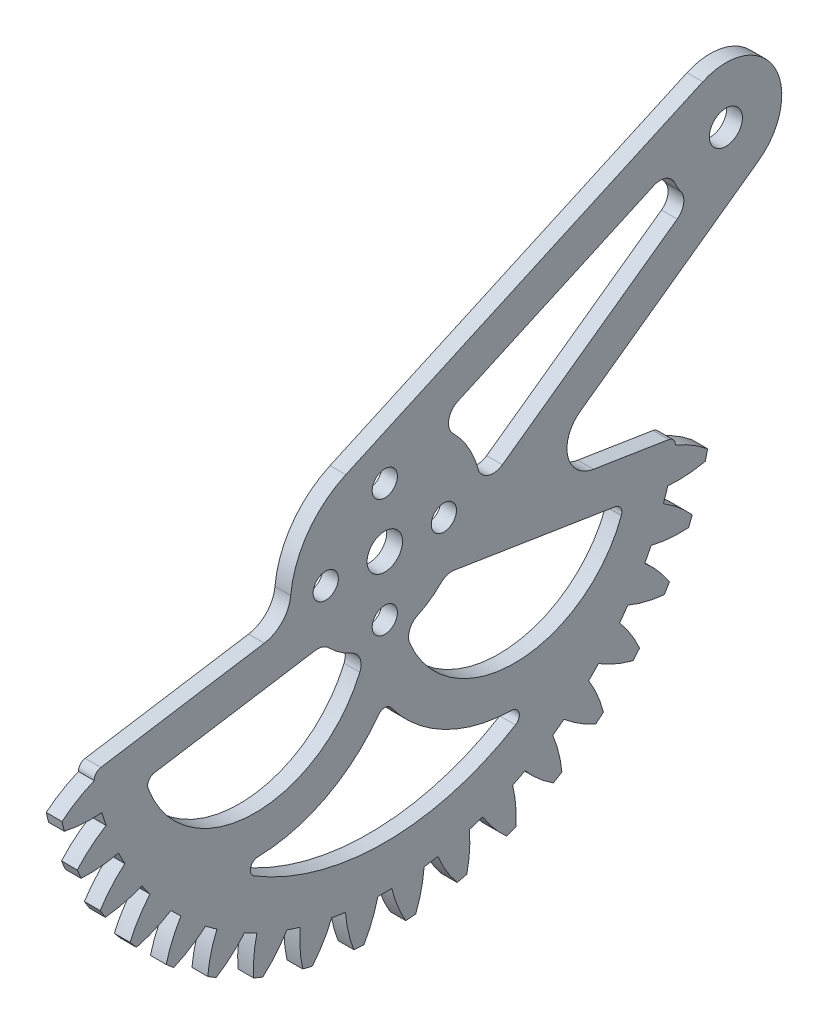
ISO-10303-21;
HEADER;
FILE_DESCRIPTION(('STEP AP214'),'2;1');
FILE_NAME('part.step','',(''),(''),'','','');
FILE_SCHEMA(('AUTOMOTIVE_DESIGN { 1 0 10303 214 1 1 1 1 }'));
ENDSEC;
DATA;
#1=APPLICATION_CONTEXT('core data for automotive mechanical design processes');
#2=APPLICATION_PROTOCOL_DEFINITION('international standard','automotive_design',2000,#1);
#3=PRODUCT_CONTEXT('',#1,'mechanical');
#4=PRODUCT('Part','Part','',(#3));
#5=PRODUCT_RELATED_PRODUCT_CATEGORY('part','',(#4));
#6=PRODUCT_DEFINITION_FORMATION('','',#4);
#7=PRODUCT_DEFINITION_CONTEXT('part definition',#1,'design');
#8=PRODUCT_DEFINITION('design','',#6,#7);
#9=PRODUCT_DEFINITION_SHAPE('','',#8);
#10=(LENGTH_UNIT() NAMED_UNIT(*) SI_UNIT(.MILLI.,.METRE.));
#11=(NAMED_UNIT(*) PLANE_ANGLE_UNIT() SI_UNIT($,.RADIAN.));
#12=(NAMED_UNIT(*) SI_UNIT($,.STERADIAN.) SOLID_ANGLE_UNIT());
#13=UNCERTAINTY_MEASURE_WITH_UNIT(LENGTH_MEASURE(1.E-05),#10,'distance_accuracy_value','');
#14=(GEOMETRIC_REPRESENTATION_CONTEXT(3) GLOBAL_UNCERTAINTY_ASSIGNED_CONTEXT((#13)) GLOBAL_UNIT_ASSIGNED_CONTEXT((#10,
#11,#12)) REPRESENTATION_CONTEXT('',''));
#15=CARTESIAN_POINT('',(0.,0.,0.));
#16=DIRECTION('',(0.,0.,1.));
#17=DIRECTION('',(1.,0.,0.));
#18=AXIS2_PLACEMENT_3D('',#15,#16,#17);
#19=CARTESIAN_POINT('',(0.,0.,0.));
#20=DIRECTION('',(1.,0.,0.));
#21=DIRECTION('',(0.,0.,-1.));
#22=AXIS2_PLACEMENT_3D('',#19,#20,#21);
#23=PLANE('',#22);
#24=CARTESIAN_POINT('',(0.,-10.6838985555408,29.1007613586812));
#25=DIRECTION('',(1.,0.,0.));
#26=DIRECTION('',(0.,0.,1.));
#27=AXIS2_PLACEMENT_3D('',#24,#25,#26);
#28=CIRCLE('',#27,0.999999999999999);
#29=CARTESIAN_POINT('',(0.,-9.69621021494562,29.2571958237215));
#30=VERTEX_POINT('',#29);
#31=CARTESIAN_POINT('',(0.,-11.0285404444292,30.039495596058));
#32=VERTEX_POINT('',#31);
#33=EDGE_CURVE('E901',#30,#32,#28,.T.);
#34=ORIENTED_EDGE('',*,*,#33,.T.);
#35=CARTESIAN_POINT('',(0.,0.,0.));
#36=DIRECTION('',(1.,0.,0.));
#37=DIRECTION('',(0.,0.,-1.));
#38=AXIS2_PLACEMENT_3D('',#35,#36,#37);
#39=CIRCLE('',#38,32.);
#40=CARTESIAN_POINT('',(0.,-11.0655469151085,30.0258833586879));
#41=VERTEX_POINT('',#40);
#42=EDGE_CURVE('E882',#32,#41,#39,.T.);
#43=ORIENTED_EDGE('',*,*,#42,.T.);
#44=CARTESIAN_POINT('',(0.,-6.07308336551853,16.4790492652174));
#45=DIRECTION('',(1.,0.,0.));
#46=DIRECTION('',(0.,0.,1.));
#47=AXIS2_PLACEMENT_3D('',#44,#45,#46);
#48=CIRCLE('',#47,14.4375);
#49=CARTESIAN_POINT('',(0.,-11.6773343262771,3.17364519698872));
#50=VERTEX_POINT('',#49);
#51=EDGE_CURVE('E885',#41,#50,#48,.T.);
#52=ORIENTED_EDGE('',*,*,#51,.T.);
#53=CARTESIAN_POINT('',(0.,-10.9009878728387,5.01681805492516));
#54=DIRECTION('',(1.,0.,0.));
#55=DIRECTION('',(0.,0.,-1.));
#56=AXIS2_PLACEMENT_3D('',#53,#54,#55);
#57=CIRCLE('',#56,2.);
#58=CARTESIAN_POINT('',(0.,-9.08415656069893,4.18068171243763));
#59=VERTEX_POINT('',#58);
#60=EDGE_CURVE('E889',#50,#59,#57,.T.);
#61=ORIENTED_EDGE('',*,*,#60,.T.);
#62=CARTESIAN_POINT('',(0.,0.,0.));
#63=DIRECTION('',(-1.,0.,0.));
#64=DIRECTION('',(0.,0.,-1.));
#65=AXIS2_PLACEMENT_3D('',#62,#63,#64);
#66=CIRCLE('',#65,9.99999999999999);
#67=CARTESIAN_POINT('',(0.,-7.03212745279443,7.10979489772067));
#68=VERTEX_POINT('',#67);
#69=EDGE_CURVE('E892',#59,#68,#66,.T.);
#70=ORIENTED_EDGE('',*,*,#69,.T.);
#71=CARTESIAN_POINT('',(0.,-8.43855294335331,8.5317538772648));
#72=DIRECTION('',(1.,0.,0.));
#73=DIRECTION('',(0.,0.,1.));
#74=AXIS2_PLACEMENT_3D('',#71,#72,#73);
#75=CIRCLE('',#74,2.);
#76=CARTESIAN_POINT('',(0.,-6.46317626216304,8.84462280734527));
#77=VERTEX_POINT('',#76);
#78=EDGE_CURVE('E895',#68,#77,#75,.T.);
#79=ORIENTED_EDGE('',*,*,#78,.T.);
#80=DIRECTION('',(0.,-0.156434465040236,0.987688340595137));
#81=VECTOR('',#80,1.);
#82=CARTESIAN_POINT('',(0.,-9.69621021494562,29.2571958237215));
#83=LINE('',#82,#81);
#84=EDGE_CURVE('E898',#77,#30,#83,.T.);
#85=ORIENTED_EDGE('',*,*,#84,.T.);
#86=EDGE_LOOP('',(#34,#43,#52,#61,#70,#79,#85));
#87=FACE_BOUND('',#86,.T.);
#88=CARTESIAN_POINT('',(0.,0.,-7.5));
#89=DIRECTION('',(1.,0.,0.));
#90=DIRECTION('',(0.,0.,-1.));
#91=AXIS2_PLACEMENT_3D('',#88,#89,#90);
#92=CIRCLE('',#91,1.6);
#93=CARTESIAN_POINT('',(0.,0.,-9.1));
#94=VERTEX_POINT('',#93);
#95=EDGE_CURVE('E938',#94,#94,#92,.T.);
#96=ORIENTED_EDGE('',*,*,#95,.T.);
#97=EDGE_LOOP('',(#96));
#98=FACE_BOUND('',#97,.T.);
#99=CARTESIAN_POINT('',(0.,-7.5,0.));
#100=DIRECTION('',(1.,0.,0.));
#101=DIRECTION('',(0.,0.,-1.));
#102=AXIS2_PLACEMENT_3D('',#99,#100,#101);
#103=CIRCLE('',#102,1.6);
#104=CARTESIAN_POINT('',(0.,-7.5,-1.6));
#105=VERTEX_POINT('',#104);
#106=EDGE_CURVE('E945',#105,#105,#103,.T.);
#107=ORIENTED_EDGE('',*,*,#106,.T.);
#108=EDGE_LOOP('',(#107));
#109=FACE_BOUND('',#108,.T.);
#110=CARTESIAN_POINT('',(0.,0.,7.5));
#111=DIRECTION('',(1.,0.,0.));
#112=DIRECTION('',(0.,0.,-1.));
#113=AXIS2_PLACEMENT_3D('',#110,#111,#112);
#114=CIRCLE('',#113,1.6);
#115=CARTESIAN_POINT('',(0.,0.,5.9));
#116=VERTEX_POINT('',#115);
#117=EDGE_CURVE('E951',#116,#116,#114,.T.);
#118=ORIENTED_EDGE('',*,*,#117,.T.);
#119=EDGE_LOOP('',(#118));
#120=FACE_BOUND('',#119,.T.);
#121=CARTESIAN_POINT('',(0.,7.5,0.));
#122=DIRECTION('',(1.,0.,0.));
#123=DIRECTION('',(0.,0.,-1.));
#124=AXIS2_PLACEMENT_3D('',#121,#122,#123);
#125=CIRCLE('',#124,1.6);
#126=CARTESIAN_POINT('',(0.,7.5,-1.6));
#127=VERTEX_POINT('',#126);
#128=EDGE_CURVE('E956',#127,#127,#125,.T.);
#129=ORIENTED_EDGE('',*,*,#128,.T.);
#130=EDGE_LOOP('',(#129));
#131=FACE_BOUND('',#130,.T.);
#132=CARTESIAN_POINT('',(0.,-21.535378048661,30.80686688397));
#133=DIRECTION('',(-1.,0.,0.));
#134=DIRECTION('',(0.,0.,1.));
#135=AXIS2_PLACEMENT_3D('',#132,#133,#134);
#136=CIRCLE('',#135,16.);
#137=CARTESIAN_POINT('',(0.,-6.73645336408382,36.8889576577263));
#138=VERTEX_POINT('',#137);
#139=CARTESIAN_POINT('',(0.,-9.1881731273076,40.9826484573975));
#140=VERTEX_POINT('',#139);
#141=EDGE_CURVE('E1015',#138,#140,#136,.F.);
#142=ORIENTED_EDGE('',*,*,#141,.F.);
#143=CARTESIAN_POINT('',(0.,-6.69684190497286,35.8897424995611));
#144=DIRECTION('',(1.,0.,0.));
#145=DIRECTION('',(0.,0.,-1.));
#146=AXIS2_PLACEMENT_3D('',#143,#144,#145);
#147=CIRCLE('',#146,1.);
#148=CARTESIAN_POINT('',(0.,-5.70915356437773,36.0461769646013));
#149=VERTEX_POINT('',#148);
#150=EDGE_CURVE('E46',#138,#149,#147,.F.);
#151=ORIENTED_EDGE('',*,*,#150,.T.);
#152=DIRECTION('',(0.,0.156434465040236,-0.987688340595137));
#153=VECTOR('',#152,1.);
#154=CARTESIAN_POINT('',(0.,-1.8772135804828,11.8522600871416));
#155=LINE('',#154,#153);
#156=CARTESIAN_POINT('',(0.,-2.42347231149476,15.3012019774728));
#157=VERTEX_POINT('',#156);
#158=EDGE_CURVE('E1003',#149,#157,#155,.T.);
#159=ORIENTED_EDGE('',*,*,#158,.T.);
#160=CARTESIAN_POINT('',(0.,1.52728105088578,15.9269398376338));
#161=DIRECTION('',(1.,0.,0.));
#162=DIRECTION('',(0.,0.,-1.));
#163=AXIS2_PLACEMENT_3D('',#160,#161,#162);
#164=CIRCLE('',#163,4.);
#165=CARTESIAN_POINT('',(0.,1.14546078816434,11.9452048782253));
#166=VERTEX_POINT('',#165);
#167=EDGE_CURVE('E1563',#157,#166,#164,.T.);
#168=ORIENTED_EDGE('',*,*,#167,.T.);
#169=CARTESIAN_POINT('',(0.,0.,0.));
#170=DIRECTION('',(-1.,0.,0.));
#171=DIRECTION('',(0.,0.,1.));
#172=AXIS2_PLACEMENT_3D('',#169,#170,#171);
#173=CIRCLE('',#172,12.);
#174=CARTESIAN_POINT('',(0.,10.9302805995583,4.95267261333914));
#175=VERTEX_POINT('',#174);
#176=EDGE_CURVE('E997',#166,#175,#173,.T.);
#177=ORIENTED_EDGE('',*,*,#176,.T.);
#178=DIRECTION('',(0.,0.412722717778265,-0.910856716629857));
#179=VECTOR('',#178,1.);
#180=CARTESIAN_POINT('',(0.,10.9302805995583,4.95267261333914));
#181=LINE('',#180,#179);
#182=CARTESIAN_POINT('',(0.,31.4670826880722,-40.3709388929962));
#183=VERTEX_POINT('',#182);
#184=EDGE_CURVE('E968',#175,#183,#181,.T.);
#185=ORIENTED_EDGE('',*,*,#184,.T.);
#186=CARTESIAN_POINT('',(0.,25.0000000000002,-43.3012701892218));
#187=DIRECTION('',(1.,0.,0.));
#188=DIRECTION('',(0.,0.,-1.));
#189=AXIS2_PLACEMENT_3D('',#186,#187,#188);
#190=CIRCLE('',#189,7.1);
#191=CARTESIAN_POINT('',(0.,19.2287173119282,-47.4367624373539));
#192=VERTEX_POINT('',#191);
#193=EDGE_CURVE('E971',#183,#192,#190,.F.);
#194=ORIENTED_EDGE('',*,*,#193,.T.);
#195=DIRECTION('',(0.,-0.582463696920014,0.812856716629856));
#196=VECTOR('',#195,1.);
#197=CARTESIAN_POINT('',(0.,19.2287173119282,-47.4367624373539));
#198=LINE('',#197,#196);
#199=CARTESIAN_POINT('',(0.,3.00500889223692,-24.7957799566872));
#200=VERTEX_POINT('',#199);
#201=EDGE_CURVE('E972',#192,#200,#198,.T.);
#202=ORIENTED_EDGE('',*,*,#201,.T.);
#203=CARTESIAN_POINT('',(0.,-0.246417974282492,-27.1256347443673));
#204=DIRECTION('',(1.,0.,0.));
#205=DIRECTION('',(0.,0.,-1.));
#206=AXIS2_PLACEMENT_3D('',#203,#204,#205);
#207=CIRCLE('',#206,4.);
#208=CARTESIAN_POINT('',(0.,-4.19717133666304,-26.4998968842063));
#209=VERTEX_POINT('',#208);
#210=EDGE_CURVE('E1567',#200,#209,#207,.T.);
#211=ORIENTED_EDGE('',*,*,#210,.T.);
#212=DIRECTION('',(0.,-0.156434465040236,-0.987688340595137));
#213=VECTOR('',#212,1.);
#214=CARTESIAN_POINT('',(0.,-1.87721358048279,-11.8522600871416));
#215=LINE('',#214,#213);
#216=CARTESIAN_POINT('',(0.,-5.70915356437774,-36.0461769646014));
#217=VERTEX_POINT('',#216);
#218=EDGE_CURVE('E999',#209,#217,#215,.T.);
#219=ORIENTED_EDGE('',*,*,#218,.T.);
#220=CARTESIAN_POINT('',(0.,-6.69684190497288,-35.8897424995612));
#221=DIRECTION('',(1.,0.,0.));
#222=DIRECTION('',(0.,0.,-1.));
#223=AXIS2_PLACEMENT_3D('',#220,#221,#222);
#224=CIRCLE('',#223,1.);
#225=CARTESIAN_POINT('',(0.,-6.73645336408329,-36.8889576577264));
#226=VERTEX_POINT('',#225);
#227=EDGE_CURVE('E1576',#217,#226,#224,.F.);
#228=ORIENTED_EDGE('',*,*,#227,.T.);
#229=CARTESIAN_POINT('',(0.,-21.5353780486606,-30.8068668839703));
#230=DIRECTION('',(-1.,0.,0.));
#231=DIRECTION('',(0.,0.,1.));
#232=AXIS2_PLACEMENT_3D('',#229,#230,#231);
#233=CIRCLE('',#232,16.);
#234=CARTESIAN_POINT('',(0.,-9.18817312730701,-40.9826484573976));
#235=VERTEX_POINT('',#234);
#236=EDGE_CURVE('E1224',#235,#226,#233,.F.);
#237=ORIENTED_EDGE('',*,*,#236,.F.);
#238=CARTESIAN_POINT('',(0.,0.,0.));
#239=DIRECTION('',(-1.,0.,0.));
#240=DIRECTION('',(0.,0.,1.));
#241=AXIS2_PLACEMENT_3D('',#238,#239,#240);
#242=CIRCLE('',#241,42.);
#243=CARTESIAN_POINT('',(0.,-10.4190108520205,-40.6871504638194));
#244=VERTEX_POINT('',#243);
#245=EDGE_CURVE('E1227',#244,#235,#242,.F.);
#246=ORIENTED_EDGE('',*,*,#245,.F.);
#247=CARTESIAN_POINT('',(0.,5.20213745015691,-37.2259764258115));
#248=DIRECTION('',(-1.,0.,0.));
#249=DIRECTION('',(0.,0.,1.));
#250=AXIS2_PLACEMENT_3D('',#247,#248,#249);
#251=CIRCLE('',#250,16.);
#252=CARTESIAN_POINT('',(0.,-10.7450124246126,-35.9265877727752));
#253=VERTEX_POINT('',#252);
#254=EDGE_CURVE('E1220',#253,#244,#251,.F.);
#255=ORIENTED_EDGE('',*,*,#254,.F.);
#256=CARTESIAN_POINT('',(0.,0.,0.));
#257=DIRECTION('',(-1.,0.,0.));
#258=DIRECTION('',(0.,0.,1.));
#259=AXIS2_PLACEMENT_3D('',#256,#257,#258);
#260=CIRCLE('',#259,37.499);
#261=CARTESIAN_POINT('',(0.,-12.4242208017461,-35.3809798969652));
#262=VERTEX_POINT('',#261);
#263=EDGE_CURVE('E1216',#262,#253,#260,.F.);
#264=ORIENTED_EDGE('',*,*,#263,.F.);
#265=CARTESIAN_POINT('',(0.,-26.0894975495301,-27.0587078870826));
#266=DIRECTION('',(-1.,0.,0.));
#267=DIRECTION('',(0.,0.,1.));
#268=AXIS2_PLACEMENT_3D('',#265,#266,#267);
#269=CIRCLE('',#268,16.);
#270=CARTESIAN_POINT('',(0.,-15.4861501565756,-39.0407371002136));
#271=VERTEX_POINT('',#270);
#272=EDGE_CURVE('E1211',#271,#262,#269,.F.);
#273=ORIENTED_EDGE('',*,*,#272,.F.);
#274=CARTESIAN_POINT('',(0.,0.,0.));
#275=DIRECTION('',(-1.,0.,0.));
#276=DIRECTION('',(0.,0.,1.));
#277=AXIS2_PLACEMENT_3D('',#274,#275,#276);
#278=CIRCLE('',#277,42.);
#279=CARTESIAN_POINT('',(0.,-16.6556081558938,-38.5563317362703));
#280=VERTEX_POINT('',#279);
#281=EDGE_CURVE('E1465',#280,#271,#278,.F.);
#282=ORIENTED_EDGE('',*,*,#281,.F.);
#283=CARTESIAN_POINT('',(0.,-0.685335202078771,-37.5814564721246));
#284=DIRECTION('',(-1.,0.,0.));
#285=DIRECTION('',(0.,0.,1.));
#286=AXIS2_PLACEMENT_3D('',#283,#284,#285);
#287=CIRCLE('',#286,16.);
#288=CARTESIAN_POINT('',(0.,-16.2328800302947,-33.803381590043));
#289=VERTEX_POINT('',#288);
#290=EDGE_CURVE('E1208',#289,#280,#287,.F.);
#291=ORIENTED_EDGE('',*,*,#290,.F.);
#292=CARTESIAN_POINT('',(0.,0.,0.));
#293=DIRECTION('',(-1.,0.,0.));
#294=DIRECTION('',(0.,0.,1.));
#295=AXIS2_PLACEMENT_3D('',#292,#293,#294);
#296=CIRCLE('',#295,37.499);
#297=CARTESIAN_POINT('',(0.,-17.8060626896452,-33.0018049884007));
#298=VERTEX_POINT('',#297);
#299=EDGE_CURVE('E1204',#298,#289,#296,.F.);
#300=ORIENTED_EDGE('',*,*,#299,.F.);
#301=CARTESIAN_POINT('',(0.,-30.0012070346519,-22.644273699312));
#302=DIRECTION('',(-1.,0.,0.));
#303=DIRECTION('',(0.,0.,1.));
#304=AXIS2_PLACEMENT_3D('',#301,#302,#303);
#305=CIRCLE('',#304,16.);
#306=CARTESIAN_POINT('',(0.,-21.4028067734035,-36.1375132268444));
#307=VERTEX_POINT('',#306);
#308=EDGE_CURVE('E1199',#307,#298,#305,.F.);
#309=ORIENTED_EDGE('',*,*,#308,.F.);
#310=CARTESIAN_POINT('',(0.,0.,0.));
#311=DIRECTION('',(-1.,0.,0.));
#312=DIRECTION('',(0.,0.,1.));
#313=AXIS2_PLACEMENT_3D('',#310,#311,#312);
#314=CIRCLE('',#313,42.);
#315=CARTESIAN_POINT('',(0.,-22.4820891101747,-35.4761281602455));
#316=VERTEX_POINT('',#315);
#317=EDGE_CURVE('E1468',#316,#307,#314,.F.);
#318=ORIENTED_EDGE('',*,*,#317,.F.);
#319=CARTESIAN_POINT('',(0.,-6.55593262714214,-37.0115563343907));
#320=DIRECTION('',(-1.,0.,0.));
#321=DIRECTION('',(0.,0.,1.));
#322=AXIS2_PLACEMENT_3D('',#319,#320,#321);
#323=CIRCLE('',#322,16.);
#324=CARTESIAN_POINT('',(0.,-21.3210402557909,-30.8478239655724));
#325=VERTEX_POINT('',#324);
#326=EDGE_CURVE('E1196',#325,#316,#323,.F.);
#327=ORIENTED_EDGE('',*,*,#326,.F.);
#328=CARTESIAN_POINT('',(0.,0.,0.));
#329=DIRECTION('',(-1.,0.,0.));
#330=DIRECTION('',(0.,0.,1.));
#331=AXIS2_PLACEMENT_3D('',#328,#329,#330);
#332=CIRCLE('',#331,37.499);
#333=CARTESIAN_POINT('',(0.,-22.7494602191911,-29.8100161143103));
#334=VERTEX_POINT('',#333);
#335=EDGE_CURVE('E1192',#334,#325,#332,.F.);
#336=ORIENTED_EDGE('',*,*,#335,.F.);
#337=CARTESIAN_POINT('',(0.,-33.1741872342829,-17.6722623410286));
#338=DIRECTION('',(-1.,0.,0.));
#339=DIRECTION('',(0.,0.,1.));
#340=AXIS2_PLACEMENT_3D('',#337,#338,#339);
#341=CIRCLE('',#340,16.);
#342=CARTESIAN_POINT('',(0.,-26.7924552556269,-32.3444638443));
#343=VERTEX_POINT('',#342);
#344=EDGE_CURVE('E1187',#343,#334,#341,.F.);
#345=ORIENTED_EDGE('',*,*,#344,.F.);
#346=CARTESIAN_POINT('',(0.,0.,0.));
#347=DIRECTION('',(-1.,0.,0.));
#348=DIRECTION('',(0.,0.,1.));
#349=AXIS2_PLACEMENT_3D('',#346,#347,#348);
#350=CIRCLE('',#349,42.);
#351=CARTESIAN_POINT('',(0.,-27.7549864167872,-31.5223845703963));
#352=VERTEX_POINT('',#351);
#353=EDGE_CURVE('E1471',#352,#343,#350,.F.);
#354=ORIENTED_EDGE('',*,*,#353,.F.);
#355=CARTESIAN_POINT('',(0.,-12.2651012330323,-35.530308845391));
#356=DIRECTION('',(-1.,0.,0.));
#357=DIRECTION('',(0.,0.,1.));
#358=AXIS2_PLACEMENT_3D('',#355,#356,#357);
#359=CIRCLE('',#358,16.);
#360=CARTESIAN_POINT('',(0.,-25.8842057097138,-27.1326905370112));
#361=VERTEX_POINT('',#360);
#362=EDGE_CURVE('E1184',#361,#352,#359,.F.);
#363=ORIENTED_EDGE('',*,*,#362,.F.);
#364=CARTESIAN_POINT('',(0.,0.,0.));
#365=DIRECTION('',(-1.,0.,0.));
#366=DIRECTION('',(0.,0.,1.));
#367=AXIS2_PLACEMENT_3D('',#364,#365,#366);
#368=CIRCLE('',#367,37.499);
#369=CARTESIAN_POINT('',(0.,-27.1326905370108,-25.8842057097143));
#370=VERTEX_POINT('',#369);
#371=EDGE_CURVE('E1180',#370,#361,#368,.F.);
#372=ORIENTED_EDGE('',*,*,#371,.F.);
#373=CARTESIAN_POINT('',(0.,-35.5303088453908,-12.265101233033));
#374=DIRECTION('',(-1.,0.,0.));
#375=DIRECTION('',(0.,0.,1.));
#376=AXIS2_PLACEMENT_3D('',#373,#374,#375);
#377=CIRCLE('',#376,16.);
#378=CARTESIAN_POINT('',(0.,-31.5223845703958,-27.7549864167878));
#379=VERTEX_POINT('',#378);
#380=EDGE_CURVE('E1175',#379,#370,#377,.F.);
#381=ORIENTED_EDGE('',*,*,#380,.F.);
#382=CARTESIAN_POINT('',(0.,0.,0.));
#383=DIRECTION('',(-1.,0.,0.));
#384=DIRECTION('',(0.,0.,1.));
#385=AXIS2_PLACEMENT_3D('',#382,#383,#384);
#386=CIRCLE('',#385,42.);
#387=CARTESIAN_POINT('',(0.,-32.3444638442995,-26.7924552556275));
#388=VERTEX_POINT('',#387);
#389=EDGE_CURVE('E1474',#388,#379,#386,.F.);
#390=ORIENTED_EDGE('',*,*,#389,.F.);
#391=CARTESIAN_POINT('',(0.,-17.672262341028,-33.1741872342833));
#392=DIRECTION('',(-1.,0.,0.));
#393=DIRECTION('',(0.,0.,1.));
#394=AXIS2_PLACEMENT_3D('',#391,#392,#393);
#395=CIRCLE('',#394,16.);
#396=CARTESIAN_POINT('',(0.,-29.8100161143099,-22.7494602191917));
#397=VERTEX_POINT('',#396);
#398=EDGE_CURVE('E1172',#397,#388,#395,.F.);
#399=ORIENTED_EDGE('',*,*,#398,.F.);
#400=CARTESIAN_POINT('',(0.,0.,0.));
#401=DIRECTION('',(-1.,0.,0.));
#402=DIRECTION('',(0.,0.,1.));
#403=AXIS2_PLACEMENT_3D('',#400,#401,#402);
#404=CIRCLE('',#403,37.499);
#405=CARTESIAN_POINT('',(0.,-30.847823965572,-21.3210402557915));
#406=VERTEX_POINT('',#405);
#407=EDGE_CURVE('E1168',#406,#397,#404,.F.);
#408=ORIENTED_EDGE('',*,*,#407,.F.);
#409=CARTESIAN_POINT('',(0.,-37.0115563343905,-6.55593262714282));
#410=DIRECTION('',(-1.,0.,0.));
#411=DIRECTION('',(0.,0.,1.));
#412=AXIS2_PLACEMENT_3D('',#409,#410,#411);
#413=CIRCLE('',#412,16.);
#414=CARTESIAN_POINT('',(0.,-35.4761281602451,-22.4820891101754));
#415=VERTEX_POINT('',#414);
#416=EDGE_CURVE('E1163',#415,#406,#413,.F.);
#417=ORIENTED_EDGE('',*,*,#416,.F.);
#418=CARTESIAN_POINT('',(0.,0.,0.));
#419=DIRECTION('',(-1.,0.,0.));
#420=DIRECTION('',(0.,0.,1.));
#421=AXIS2_PLACEMENT_3D('',#418,#419,#420);
#422=CIRCLE('',#421,42.);
#423=CARTESIAN_POINT('',(0.,-36.137513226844,-21.4028067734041));
#424=VERTEX_POINT('',#423);
#425=EDGE_CURVE('E1477',#424,#415,#422,.F.);
#426=ORIENTED_EDGE('',*,*,#425,.F.);
#427=CARTESIAN_POINT('',(0.,-22.6442736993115,-30.0012070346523));
#428=DIRECTION('',(-1.,0.,0.));
#429=DIRECTION('',(0.,0.,1.));
#430=AXIS2_PLACEMENT_3D('',#427,#428,#429);
#431=CIRCLE('',#430,16.);
#432=CARTESIAN_POINT('',(0.,-33.0018049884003,-17.8060626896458));
#433=VERTEX_POINT('',#432);
#434=EDGE_CURVE('E1160',#433,#424,#431,.F.);
#435=ORIENTED_EDGE('',*,*,#434,.F.);
#436=CARTESIAN_POINT('',(0.,0.,0.));
#437=DIRECTION('',(-1.,0.,0.));
#438=DIRECTION('',(0.,0.,1.));
#439=AXIS2_PLACEMENT_3D('',#436,#437,#438);
#440=CIRCLE('',#439,37.499);
#441=CARTESIAN_POINT('',(0.,-33.8033815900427,-16.2328800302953));
#442=VERTEX_POINT('',#441);
#443=EDGE_CURVE('E1156',#442,#433,#440,.F.);
#444=ORIENTED_EDGE('',*,*,#443,.F.);
#445=CARTESIAN_POINT('',(0.,-37.5814564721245,-0.685335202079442));
#446=DIRECTION('',(-1.,0.,0.));
#447=DIRECTION('',(0.,0.,1.));
#448=AXIS2_PLACEMENT_3D('',#445,#446,#447);
#449=CIRCLE('',#448,16.);
#450=CARTESIAN_POINT('',(0.,-38.55633173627,-16.6556081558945));
#451=VERTEX_POINT('',#450);
#452=EDGE_CURVE('E1151',#451,#442,#449,.F.);
#453=ORIENTED_EDGE('',*,*,#452,.F.);
#454=CARTESIAN_POINT('',(0.,0.,0.));
#455=DIRECTION('',(-1.,0.,0.));
#456=DIRECTION('',(0.,0.,1.));
#457=AXIS2_PLACEMENT_3D('',#454,#455,#456);
#458=CIRCLE('',#457,42.);
#459=CARTESIAN_POINT('',(0.,-39.0407371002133,-15.4861501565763));
#460=VERTEX_POINT('',#459);
#461=EDGE_CURVE('E1480',#460,#451,#458,.F.);
#462=ORIENTED_EDGE('',*,*,#461,.F.);
#463=CARTESIAN_POINT('',(0.,-27.0587078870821,-26.0894975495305));
#464=DIRECTION('',(-1.,0.,0.));
#465=DIRECTION('',(0.,0.,1.));
#466=AXIS2_PLACEMENT_3D('',#463,#464,#465);
#467=CIRCLE('',#466,16.);
#468=CARTESIAN_POINT('',(0.,-35.380979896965,-12.4242208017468));
#469=VERTEX_POINT('',#468);
#470=EDGE_CURVE('E1148',#469,#460,#467,.F.);
#471=ORIENTED_EDGE('',*,*,#470,.F.);
#472=CARTESIAN_POINT('',(0.,0.,0.));
#473=DIRECTION('',(-1.,0.,0.));
#474=DIRECTION('',(0.,0.,1.));
#475=AXIS2_PLACEMENT_3D('',#472,#473,#474);
#476=CIRCLE('',#475,37.499);
#477=CARTESIAN_POINT('',(0.,-35.926587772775,-10.7450124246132));
#478=VERTEX_POINT('',#477);
#479=EDGE_CURVE('E1144',#478,#469,#476,.F.);
#480=ORIENTED_EDGE('',*,*,#479,.F.);
#481=CARTESIAN_POINT('',(0.,-37.2259764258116,5.20213745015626));
#482=DIRECTION('',(-1.,0.,0.));
#483=DIRECTION('',(0.,0.,1.));
#484=AXIS2_PLACEMENT_3D('',#481,#482,#483);
#485=CIRCLE('',#484,16.);
#486=CARTESIAN_POINT('',(0.,-40.6871504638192,-10.4190108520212));
#487=VERTEX_POINT('',#486);
#488=EDGE_CURVE('E1139',#487,#478,#485,.F.);
#489=ORIENTED_EDGE('',*,*,#488,.F.);
#490=CARTESIAN_POINT('',(0.,0.,0.));
#491=DIRECTION('',(-1.,0.,0.));
#492=DIRECTION('',(0.,0.,1.));
#493=AXIS2_PLACEMENT_3D('',#490,#491,#492);
#494=CIRCLE('',#493,42.);
#495=CARTESIAN_POINT('',(0.,-40.9826484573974,-9.18817312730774));
#496=VERTEX_POINT('',#495);
#497=EDGE_CURVE('E1483',#496,#487,#494,.F.);
#498=ORIENTED_EDGE('',*,*,#497,.F.);
#499=CARTESIAN_POINT('',(0.,-30.8068668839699,-21.5353780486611));
#500=DIRECTION('',(-1.,0.,0.));
#501=DIRECTION('',(0.,0.,1.));
#502=AXIS2_PLACEMENT_3D('',#499,#500,#501);
#503=CIRCLE('',#502,16.);
#504=CARTESIAN_POINT('',(0.,-36.8889576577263,-6.73645336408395));
#505=VERTEX_POINT('',#504);
#506=EDGE_CURVE('E1136',#505,#496,#503,.F.);
#507=ORIENTED_EDGE('',*,*,#506,.F.);
#508=CARTESIAN_POINT('',(0.,0.,0.));
#509=DIRECTION('',(-1.,0.,0.));
#510=DIRECTION('',(0.,0.,1.));
#511=AXIS2_PLACEMENT_3D('',#508,#509,#510);
#512=CIRCLE('',#511,37.499);
#513=CARTESIAN_POINT('',(0.,-37.1651621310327,-4.99256695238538));
#514=VERTEX_POINT('',#513);
#515=EDGE_CURVE('E1132',#514,#505,#512,.F.);
#516=ORIENTED_EDGE('',*,*,#515,.F.);
#517=CARTESIAN_POINT('',(0.,-35.9538692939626,10.9615162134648));
#518=DIRECTION('',(-1.,0.,0.));
#519=DIRECTION('',(0.,0.,1.));
#520=AXIS2_PLACEMENT_3D('',#517,#518,#519);
#521=CIRCLE('',#520,16.);
#522=CARTESIAN_POINT('',(0.,-41.8161165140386,-3.9258629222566));
#523=VERTEX_POINT('',#522);
#524=EDGE_CURVE('E1127',#523,#514,#521,.F.);
#525=ORIENTED_EDGE('',*,*,#524,.F.);
#526=CARTESIAN_POINT('',(0.,0.,0.));
#527=DIRECTION('',(-1.,0.,0.));
#528=DIRECTION('',(0.,0.,1.));
#529=AXIS2_PLACEMENT_3D('',#526,#527,#528);
#530=CIRCLE('',#529,42.);
#531=CARTESIAN_POINT('',(0.,-41.9154309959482,-2.6639527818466));
#532=VERTEX_POINT('',#531);
#533=EDGE_CURVE('E1486',#532,#523,#530,.F.);
#534=ORIENTED_EDGE('',*,*,#533,.F.);
#535=CARTESIAN_POINT('',(0.,-33.796458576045,-16.4509860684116));
#536=DIRECTION('',(-1.,0.,0.));
#537=DIRECTION('',(0.,0.,1.));
#538=AXIS2_PLACEMENT_3D('',#535,#536,#537);
#539=CIRCLE('',#538,16.);
#540=CARTESIAN_POINT('',(0.,-37.4886068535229,-0.882812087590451));
#541=VERTEX_POINT('',#540);
#542=EDGE_CURVE('E1124',#541,#532,#539,.F.);
#543=ORIENTED_EDGE('',*,*,#542,.F.);
#544=CARTESIAN_POINT('',(0.,0.,0.));
#545=DIRECTION('',(-1.,0.,0.));
#546=DIRECTION('',(0.,0.,1.));
#547=AXIS2_PLACEMENT_3D('',#544,#545,#546);
#548=CIRCLE('',#547,37.499);
#549=CARTESIAN_POINT('',(0.,-37.4886068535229,0.882812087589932));
#550=VERTEX_POINT('',#549);
#551=EDGE_CURVE('E1120',#550,#541,#548,.F.);
#552=ORIENTED_EDGE('',*,*,#551,.F.);
#553=CARTESIAN_POINT('',(0.,-33.7964585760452,16.4509860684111));
#554=DIRECTION('',(-1.,0.,0.));
#555=DIRECTION('',(0.,0.,1.));
#556=AXIS2_PLACEMENT_3D('',#553,#554,#555);
#557=CIRCLE('',#556,16.);
#558=CARTESIAN_POINT('',(0.,-41.9154309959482,2.66395278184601));
#559=VERTEX_POINT('',#558);
#560=EDGE_CURVE('E1115',#559,#550,#557,.F.);
#561=ORIENTED_EDGE('',*,*,#560,.F.);
#562=CARTESIAN_POINT('',(0.,0.,0.));
#563=DIRECTION('',(-1.,0.,0.));
#564=DIRECTION('',(0.,0.,1.));
#565=AXIS2_PLACEMENT_3D('',#562,#563,#564);
#566=CIRCLE('',#565,42.);
#567=CARTESIAN_POINT('',(0.,-41.8161165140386,3.92586292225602));
#568=VERTEX_POINT('',#567);
#569=EDGE_CURVE('E1489',#568,#559,#566,.F.);
#570=ORIENTED_EDGE('',*,*,#569,.F.);
#571=CARTESIAN_POINT('',(0.,-35.9538692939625,-10.9615162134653));
#572=DIRECTION('',(-1.,0.,0.));
#573=DIRECTION('',(0.,0.,1.));
#574=AXIS2_PLACEMENT_3D('',#571,#572,#573);
#575=CIRCLE('',#574,16.);
#576=CARTESIAN_POINT('',(0.,-37.1651621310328,4.99256695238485));
#577=VERTEX_POINT('',#576);
#578=EDGE_CURVE('E1112',#577,#568,#575,.F.);
#579=ORIENTED_EDGE('',*,*,#578,.F.);
#580=CARTESIAN_POINT('',(0.,0.,0.));
#581=DIRECTION('',(-1.,0.,0.));
#582=DIRECTION('',(0.,0.,1.));
#583=AXIS2_PLACEMENT_3D('',#580,#581,#582);
#584=CIRCLE('',#583,37.499);
#585=CARTESIAN_POINT('',(0.,-36.8889576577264,6.73645336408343));
#586=VERTEX_POINT('',#585);
#587=EDGE_CURVE('E1108',#586,#577,#584,.F.);
#588=ORIENTED_EDGE('',*,*,#587,.F.);
#589=CARTESIAN_POINT('',(0.,-30.8068668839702,21.5353780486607));
#590=DIRECTION('',(-1.,0.,0.));
#591=DIRECTION('',(0.,0.,1.));
#592=AXIS2_PLACEMENT_3D('',#589,#590,#591);
#593=CIRCLE('',#592,16.);
#594=CARTESIAN_POINT('',(0.,-40.9826484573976,9.18817312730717));
#595=VERTEX_POINT('',#594);
#596=EDGE_CURVE('E1103',#595,#586,#593,.F.);
#597=ORIENTED_EDGE('',*,*,#596,.F.);
#598=CARTESIAN_POINT('',(0.,0.,0.));
#599=DIRECTION('',(-1.,0.,0.));
#600=DIRECTION('',(0.,0.,1.));
#601=AXIS2_PLACEMENT_3D('',#598,#599,#600);
#602=CIRCLE('',#601,42.);
#603=CARTESIAN_POINT('',(0.,-40.6871504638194,10.4190108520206));
#604=VERTEX_POINT('',#603);
#605=EDGE_CURVE('E1492',#604,#595,#602,.F.);
#606=ORIENTED_EDGE('',*,*,#605,.F.);
#607=CARTESIAN_POINT('',(0.,-37.2259764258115,-5.2021374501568));
#608=DIRECTION('',(-1.,0.,0.));
#609=DIRECTION('',(0.,0.,1.));
#610=AXIS2_PLACEMENT_3D('',#607,#608,#609);
#611=CIRCLE('',#610,16.);
#612=CARTESIAN_POINT('',(0.,-35.9265877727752,10.7450124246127));
#613=VERTEX_POINT('',#612);
#614=EDGE_CURVE('E1100',#613,#604,#611,.F.);
#615=ORIENTED_EDGE('',*,*,#614,.F.);
#616=CARTESIAN_POINT('',(0.,0.,0.));
#617=DIRECTION('',(-1.,0.,0.));
#618=DIRECTION('',(0.,0.,1.));
#619=AXIS2_PLACEMENT_3D('',#616,#617,#618);
#620=CIRCLE('',#619,37.499);
#621=CARTESIAN_POINT('',(0.,-35.3809798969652,12.4242208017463));
#622=VERTEX_POINT('',#621);
#623=EDGE_CURVE('E1096',#622,#613,#620,.F.);
#624=ORIENTED_EDGE('',*,*,#623,.F.);
#625=CARTESIAN_POINT('',(0.,-27.0587078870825,26.0894975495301));
#626=DIRECTION('',(-1.,0.,0.));
#627=DIRECTION('',(0.,0.,1.));
#628=AXIS2_PLACEMENT_3D('',#625,#626,#627);
#629=CIRCLE('',#628,16.);
#630=CARTESIAN_POINT('',(0.,-39.0407371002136,15.4861501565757));
#631=VERTEX_POINT('',#630);
#632=EDGE_CURVE('E1090',#631,#622,#629,.F.);
#633=ORIENTED_EDGE('',*,*,#632,.F.);
#634=CARTESIAN_POINT('',(0.,0.,0.));
#635=DIRECTION('',(-1.,0.,0.));
#636=DIRECTION('',(0.,0.,1.));
#637=AXIS2_PLACEMENT_3D('',#634,#635,#636);
#638=CIRCLE('',#637,42.);
#639=CARTESIAN_POINT('',(0.,-38.5563317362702,16.655608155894));
#640=VERTEX_POINT('',#639);
#641=EDGE_CURVE('E1495',#640,#631,#638,.F.);
#642=ORIENTED_EDGE('',*,*,#641,.F.);
#643=CARTESIAN_POINT('',(0.,-37.5814564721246,0.685335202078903));
#644=DIRECTION('',(-1.,0.,0.));
#645=DIRECTION('',(0.,0.,1.));
#646=AXIS2_PLACEMENT_3D('',#643,#644,#645);
#647=CIRCLE('',#646,16.);
#648=CARTESIAN_POINT('',(0.,-33.803381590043,16.2328800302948));
#649=VERTEX_POINT('',#648);
#650=EDGE_CURVE('E1089',#649,#640,#647,.F.);
#651=ORIENTED_EDGE('',*,*,#650,.F.);
#652=CARTESIAN_POINT('',(0.,0.,0.));
#653=DIRECTION('',(-1.,0.,0.));
#654=DIRECTION('',(0.,0.,1.));
#655=AXIS2_PLACEMENT_3D('',#652,#653,#654);
#656=CIRCLE('',#655,37.499);
#657=CARTESIAN_POINT('',(0.,-33.0018049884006,17.8060626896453));
#658=VERTEX_POINT('',#657);
#659=EDGE_CURVE('E1086',#658,#649,#656,.F.);
#660=ORIENTED_EDGE('',*,*,#659,.F.);
#661=CARTESIAN_POINT('',(0.,-22.6442736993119,30.001207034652));
#662=DIRECTION('',(-1.,0.,0.));
#663=DIRECTION('',(0.,0.,1.));
#664=AXIS2_PLACEMENT_3D('',#661,#662,#663);
#665=CIRCLE('',#664,16.);
#666=CARTESIAN_POINT('',(0.,-36.1375132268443,21.4028067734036));
#667=VERTEX_POINT('',#666);
#668=EDGE_CURVE('E1081',#667,#658,#665,.F.);
#669=ORIENTED_EDGE('',*,*,#668,.F.);
#670=CARTESIAN_POINT('',(0.,0.,0.));
#671=DIRECTION('',(-1.,0.,0.));
#672=DIRECTION('',(0.,0.,1.));
#673=AXIS2_PLACEMENT_3D('',#670,#671,#672);
#674=CIRCLE('',#673,42.);
#675=CARTESIAN_POINT('',(0.,-35.4761281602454,22.4820891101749));
#676=VERTEX_POINT('',#675);
#677=EDGE_CURVE('E1498',#676,#667,#674,.F.);
#678=ORIENTED_EDGE('',*,*,#677,.F.);
#679=CARTESIAN_POINT('',(0.,-37.0115563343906,6.55593262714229));
#680=DIRECTION('',(-1.,0.,0.));
#681=DIRECTION('',(0.,0.,1.));
#682=AXIS2_PLACEMENT_3D('',#679,#680,#681);
#683=CIRCLE('',#682,16.);
#684=CARTESIAN_POINT('',(0.,-30.8478239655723,21.321040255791));
#685=VERTEX_POINT('',#684);
#686=EDGE_CURVE('E1078',#685,#676,#683,.F.);
#687=ORIENTED_EDGE('',*,*,#686,.F.);
#688=CARTESIAN_POINT('',(0.,0.,0.));
#689=DIRECTION('',(-1.,0.,0.));
#690=DIRECTION('',(0.,0.,1.));
#691=AXIS2_PLACEMENT_3D('',#688,#689,#690);
#692=CIRCLE('',#691,37.499);
#693=CARTESIAN_POINT('',(0.,-29.8100161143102,22.7494602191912));
#694=VERTEX_POINT('',#693);
#695=EDGE_CURVE('E1074',#694,#685,#692,.F.);
#696=ORIENTED_EDGE('',*,*,#695,.F.);
#697=CARTESIAN_POINT('',(0.,-17.6722623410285,33.174187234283));
#698=DIRECTION('',(-1.,0.,0.));
#699=DIRECTION('',(0.,0.,1.));
#700=AXIS2_PLACEMENT_3D('',#697,#698,#699);
#701=CIRCLE('',#700,16.);
#702=CARTESIAN_POINT('',(0.,-32.3444638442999,26.792455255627));
#703=VERTEX_POINT('',#702);
#704=EDGE_CURVE('E1069',#703,#694,#701,.F.);
#705=ORIENTED_EDGE('',*,*,#704,.F.);
#706=CARTESIAN_POINT('',(0.,0.,0.));
#707=DIRECTION('',(-1.,0.,0.));
#708=DIRECTION('',(0.,0.,1.));
#709=AXIS2_PLACEMENT_3D('',#706,#707,#708);
#710=CIRCLE('',#709,42.);
#711=CARTESIAN_POINT('',(0.,-31.5223845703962,27.7549864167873));
#712=VERTEX_POINT('',#711);
#713=EDGE_CURVE('E1501',#712,#703,#710,.F.);
#714=ORIENTED_EDGE('',*,*,#713,.F.);
#715=CARTESIAN_POINT('',(0.,-35.5303088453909,12.2651012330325));
#716=DIRECTION('',(-1.,0.,0.));
#717=DIRECTION('',(0.,0.,1.));
#718=AXIS2_PLACEMENT_3D('',#715,#716,#717);
#719=CIRCLE('',#718,16.);
#720=CARTESIAN_POINT('',(0.,-27.1326905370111,25.8842057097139));
#721=VERTEX_POINT('',#720);
#722=EDGE_CURVE('E1066',#721,#712,#719,.F.);
#723=ORIENTED_EDGE('',*,*,#722,.F.);
#724=CARTESIAN_POINT('',(0.,0.,0.));
#725=DIRECTION('',(-1.,0.,0.));
#726=DIRECTION('',(0.,0.,1.));
#727=AXIS2_PLACEMENT_3D('',#724,#725,#726);
#728=CIRCLE('',#727,37.499);
#729=CARTESIAN_POINT('',(0.,-25.8842057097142,27.1326905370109));
#730=VERTEX_POINT('',#729);
#731=EDGE_CURVE('E1062',#730,#721,#728,.F.);
#732=ORIENTED_EDGE('',*,*,#731,.F.);
#733=CARTESIAN_POINT('',(0.,-12.2651012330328,35.5303088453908));
#734=DIRECTION('',(-1.,0.,0.));
#735=DIRECTION('',(0.,0.,1.));
#736=AXIS2_PLACEMENT_3D('',#733,#734,#735);
#737=CIRCLE('',#736,16.);
#738=CARTESIAN_POINT('',(0.,-27.7549864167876,31.5223845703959));
#739=VERTEX_POINT('',#738);
#740=EDGE_CURVE('E1057',#739,#730,#737,.F.);
#741=ORIENTED_EDGE('',*,*,#740,.F.);
#742=CARTESIAN_POINT('',(0.,0.,0.));
#743=DIRECTION('',(-1.,0.,0.));
#744=DIRECTION('',(0.,0.,1.));
#745=AXIS2_PLACEMENT_3D('',#742,#743,#744);
#746=CIRCLE('',#745,42.);
#747=CARTESIAN_POINT('',(0.,-26.7924552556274,32.3444638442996));
#748=VERTEX_POINT('',#747);
#749=EDGE_CURVE('E1504',#748,#739,#746,.F.);
#750=ORIENTED_EDGE('',*,*,#749,.F.);
#751=CARTESIAN_POINT('',(0.,-33.1741872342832,17.6722623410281));
#752=DIRECTION('',(-1.,0.,0.));
#753=DIRECTION('',(0.,0.,1.));
#754=AXIS2_PLACEMENT_3D('',#751,#752,#753);
#755=CIRCLE('',#754,16.);
#756=CARTESIAN_POINT('',(0.,-22.7494602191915,29.81001611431));
#757=VERTEX_POINT('',#756);
#758=EDGE_CURVE('E1054',#757,#748,#755,.F.);
#759=ORIENTED_EDGE('',*,*,#758,.F.);
#760=CARTESIAN_POINT('',(0.,0.,0.));
#761=DIRECTION('',(-1.,0.,0.));
#762=DIRECTION('',(0.,0.,1.));
#763=AXIS2_PLACEMENT_3D('',#760,#761,#762);
#764=CIRCLE('',#763,37.499);
#765=CARTESIAN_POINT('',(0.,-21.3210402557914,30.8478239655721));
#766=VERTEX_POINT('',#765);
#767=EDGE_CURVE('E1050',#766,#757,#764,.F.);
#768=ORIENTED_EDGE('',*,*,#767,.F.);
#769=CARTESIAN_POINT('',(0.,-6.55593262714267,37.0115563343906));
#770=DIRECTION('',(-1.,0.,0.));
#771=DIRECTION('',(0.,0.,1.));
#772=AXIS2_PLACEMENT_3D('',#769,#770,#771);
#773=CIRCLE('',#772,16.);
#774=CARTESIAN_POINT('',(0.,-22.4820891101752,35.4761281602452));
#775=VERTEX_POINT('',#774);
#776=EDGE_CURVE('E1045',#775,#766,#773,.F.);
#777=ORIENTED_EDGE('',*,*,#776,.F.);
#778=CARTESIAN_POINT('',(0.,0.,0.));
#779=DIRECTION('',(-1.,0.,0.));
#780=DIRECTION('',(0.,0.,1.));
#781=AXIS2_PLACEMENT_3D('',#778,#779,#780);
#782=CIRCLE('',#781,42.);
#783=CARTESIAN_POINT('',(0.,-21.402806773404,36.1375132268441));
#784=VERTEX_POINT('',#783);
#785=EDGE_CURVE('E1507',#784,#775,#782,.F.);
#786=ORIENTED_EDGE('',*,*,#785,.F.);
#787=CARTESIAN_POINT('',(0.,-30.0012070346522,22.6442736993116));
#788=DIRECTION('',(-1.,0.,0.));
#789=DIRECTION('',(0.,0.,1.));
#790=AXIS2_PLACEMENT_3D('',#787,#788,#789);
#791=CIRCLE('',#790,16.);
#792=CARTESIAN_POINT('',(0.,-17.8060626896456,33.0018049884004));
#793=VERTEX_POINT('',#792);
#794=EDGE_CURVE('E1042',#793,#784,#791,.F.);
#795=ORIENTED_EDGE('',*,*,#794,.F.);
#796=CARTESIAN_POINT('',(0.,0.,0.));
#797=DIRECTION('',(-1.,0.,0.));
#798=DIRECTION('',(0.,0.,1.));
#799=AXIS2_PLACEMENT_3D('',#796,#797,#798);
#800=CIRCLE('',#799,37.499);
#801=CARTESIAN_POINT('',(0.,-16.2328800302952,33.8033815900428));
#802=VERTEX_POINT('',#801);
#803=EDGE_CURVE('E1038',#802,#793,#800,.F.);
#804=ORIENTED_EDGE('',*,*,#803,.F.);
#805=CARTESIAN_POINT('',(0.,-0.685335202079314,37.5814564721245));
#806=DIRECTION('',(-1.,0.,0.));
#807=DIRECTION('',(0.,0.,1.));
#808=AXIS2_PLACEMENT_3D('',#805,#806,#807);
#809=CIRCLE('',#808,16.);
#810=CARTESIAN_POINT('',(0.,-16.6556081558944,38.55633173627));
#811=VERTEX_POINT('',#810);
#812=EDGE_CURVE('E1033',#811,#802,#809,.F.);
#813=ORIENTED_EDGE('',*,*,#812,.F.);
#814=CARTESIAN_POINT('',(0.,0.,0.));
#815=DIRECTION('',(-1.,0.,0.));
#816=DIRECTION('',(0.,0.,1.));
#817=AXIS2_PLACEMENT_3D('',#814,#815,#816);
#818=CIRCLE('',#817,42.);
#819=CARTESIAN_POINT('',(0.,-15.4861501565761,39.0407371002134));
#820=VERTEX_POINT('',#819);
#821=EDGE_CURVE('E1510',#820,#811,#818,.F.);
#822=ORIENTED_EDGE('',*,*,#821,.F.);
#823=CARTESIAN_POINT('',(0.,-26.0894975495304,27.0587078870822));
#824=DIRECTION('',(-1.,0.,0.));
#825=DIRECTION('',(0.,0.,1.));
#826=AXIS2_PLACEMENT_3D('',#823,#824,#825);
#827=CIRCLE('',#826,16.);
#828=CARTESIAN_POINT('',(0.,-12.4242208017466,35.3809798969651));
#829=VERTEX_POINT('',#828);
#830=EDGE_CURVE('E1030',#829,#820,#827,.F.);
#831=ORIENTED_EDGE('',*,*,#830,.F.);
#832=CARTESIAN_POINT('',(0.,0.,0.));
#833=DIRECTION('',(-1.,0.,0.));
#834=DIRECTION('',(0.,0.,1.));
#835=AXIS2_PLACEMENT_3D('',#832,#833,#834);
#836=CIRCLE('',#835,37.499);
#837=CARTESIAN_POINT('',(0.,-10.7450124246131,35.9265877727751));
#838=VERTEX_POINT('',#837);
#839=EDGE_CURVE('E1026',#838,#829,#836,.F.);
#840=ORIENTED_EDGE('',*,*,#839,.F.);
#841=CARTESIAN_POINT('',(0.,5.20213745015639,37.2259764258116));
#842=DIRECTION('',(-1.,0.,0.));
#843=DIRECTION('',(0.,0.,1.));
#844=AXIS2_PLACEMENT_3D('',#841,#842,#843);
#845=CIRCLE('',#844,16.);
#846=CARTESIAN_POINT('',(0.,-10.4190108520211,40.6871504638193));
#847=VERTEX_POINT('',#846);
#848=EDGE_CURVE('E1021',#847,#838,#845,.F.);
#849=ORIENTED_EDGE('',*,*,#848,.F.);
#850=CARTESIAN_POINT('',(0.,0.,0.));
#851=DIRECTION('',(-1.,0.,0.));
#852=DIRECTION('',(0.,0.,1.));
#853=AXIS2_PLACEMENT_3D('',#850,#851,#852);
#854=CIRCLE('',#853,42.);
#855=EDGE_CURVE('E1513',#140,#847,#854,.F.);
#856=ORIENTED_EDGE('',*,*,#855,.F.);
#857=EDGE_LOOP('',(#142,#151,#159,#168,#177,#185,#194,#202,#211,#219,#228,#237,#246,#255,#264,
#273,#282,#291,#300,#309,#318,#327,#336,#345,#354,#363,#372,#381,#390,#399,#408,#417,#426,#435,
#444,#453,#462,#471,#480,#489,#498,#507,#516,#525,#534,#543,#552,#561,#570,#579,#588,#597,#606,
#615,#624,#633,#642,#651,#660,#669,#678,#687,#696,#705,#714,#723,#732,#741,#750,#759,#768,#777,
#786,#795,#804,#813,#822,#831,#840,#849,#856));
#858=FACE_BOUND('',#857,.T.);
#859=CARTESIAN_POINT('',(0.,25.0000000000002,-43.3012701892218));
#860=DIRECTION('',(1.,0.,0.));
#861=DIRECTION('',(0.,0.,-1.));
#862=AXIS2_PLACEMENT_3D('',#859,#860,#861);
#863=CIRCLE('',#862,2.1);
#864=CARTESIAN_POINT('',(0.,25.0000000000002,-45.4012701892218));
#865=VERTEX_POINT('',#864);
#866=EDGE_CURVE('E970',#865,#865,#863,.F.);
#867=ORIENTED_EDGE('',*,*,#866,.F.);
#868=EDGE_LOOP('',(#867));
#869=FACE_BOUND('',#868,.T.);
#870=CARTESIAN_POINT('',(0.,0.,0.));
#871=DIRECTION('',(1.,0.,0.));
#872=DIRECTION('',(0.,0.,-1.));
#873=AXIS2_PLACEMENT_3D('',#870,#871,#872);
#874=CIRCLE('',#873,2.25);
#875=CARTESIAN_POINT('',(0.,0.,-2.25));
#876=VERTEX_POINT('',#875);
#877=EDGE_CURVE('E964',#876,#876,#874,.F.);
#878=ORIENTED_EDGE('',*,*,#877,.F.);
#879=EDGE_LOOP('',(#878));
#880=FACE_BOUND('',#879,.T.);
#881=CARTESIAN_POINT('',(0.,-6.07308336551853,-16.4790492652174));
#882=DIRECTION('',(-1.,0.,0.));
#883=DIRECTION('',(0.,0.,-1.));
#884=AXIS2_PLACEMENT_3D('',#881,#882,#883);
#885=CIRCLE('',#884,19.4375);
#886=CARTESIAN_POINT('',(0.,-25.5067816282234,-16.0946301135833));
#887=VERTEX_POINT('',#886);
#888=CARTESIAN_POINT('',(0.,-17.5701171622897,-0.806314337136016));
#889=VERTEX_POINT('',#888);
#890=EDGE_CURVE('E850',#887,#889,#885,.T.);
#891=ORIENTED_EDGE('',*,*,#890,.T.);
#892=CARTESIAN_POINT('',(0.,-18.1616044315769,0.));
#893=DIRECTION('',(1.,0.,0.));
#894=DIRECTION('',(0.,0.,-1.));
#895=AXIS2_PLACEMENT_3D('',#892,#893,#894);
#896=CIRCLE('',#895,1.);
#897=CARTESIAN_POINT('',(0.,-17.5701171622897,0.806314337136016));
#898=VERTEX_POINT('',#897);
#899=EDGE_CURVE('E834',#889,#898,#896,.T.);
#900=ORIENTED_EDGE('',*,*,#899,.T.);
#901=CARTESIAN_POINT('',(0.,-6.07308336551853,16.4790492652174));
#902=DIRECTION('',(-1.,0.,0.));
#903=DIRECTION('',(0.,0.,1.));
#904=AXIS2_PLACEMENT_3D('',#901,#902,#903);
#905=CIRCLE('',#904,19.4375);
#906=CARTESIAN_POINT('',(0.,-25.5067816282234,16.0946301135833));
#907=VERTEX_POINT('',#906);
#908=EDGE_CURVE('E837',#898,#907,#905,.T.);
#909=ORIENTED_EDGE('',*,*,#908,.T.);
#910=CARTESIAN_POINT('',(0.,-26.5065860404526,16.0748529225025));
#911=DIRECTION('',(1.,0.,0.));
#912=DIRECTION('',(0.,0.,1.));
#913=AXIS2_PLACEMENT_3D('',#910,#911,#912);
#914=CIRCLE('',#913,1.);
#915=CARTESIAN_POINT('',(0.,-27.3616372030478,16.5933965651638));
#916=VERTEX_POINT('',#915);
#917=EDGE_CURVE('E841',#907,#916,#914,.T.);
#918=ORIENTED_EDGE('',*,*,#917,.T.);
#919=CARTESIAN_POINT('',(0.,0.,0.));
#920=DIRECTION('',(1.,0.,0.));
#921=DIRECTION('',(0.,0.,-1.));
#922=AXIS2_PLACEMENT_3D('',#919,#920,#921);
#923=CIRCLE('',#922,32.);
#924=CARTESIAN_POINT('',(0.,-27.3616372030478,-16.5933965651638));
#925=VERTEX_POINT('',#924);
#926=EDGE_CURVE('E844',#916,#925,#923,.T.);
#927=ORIENTED_EDGE('',*,*,#926,.T.);
#928=CARTESIAN_POINT('',(0.,-26.5065860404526,-16.0748529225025));
#929=DIRECTION('',(1.,0.,0.));
#930=DIRECTION('',(0.,0.,-1.));
#931=AXIS2_PLACEMENT_3D('',#928,#929,#930);
#932=CIRCLE('',#931,1.);
#933=EDGE_CURVE('E847',#925,#887,#932,.T.);
#934=ORIENTED_EDGE('',*,*,#933,.T.);
#935=EDGE_LOOP('',(#891,#900,#909,#918,#927,#934));
#936=FACE_BOUND('',#935,.T.);
#937=CARTESIAN_POINT('',(0.,-6.07308336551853,-16.4790492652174));
#938=DIRECTION('',(1.,0.,0.));
#939=DIRECTION('',(0.,0.,-1.));
#940=AXIS2_PLACEMENT_3D('',#937,#938,#939);
#941=CIRCLE('',#940,14.4375);
#942=CARTESIAN_POINT('',(0.,-11.6773343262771,-3.17364519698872));
#943=VERTEX_POINT('',#942);
#944=CARTESIAN_POINT('',(0.,-11.0655469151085,-30.0258833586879));
#945=VERTEX_POINT('',#944);
#946=EDGE_CURVE('E720',#943,#945,#941,.T.);
#947=ORIENTED_EDGE('',*,*,#946,.T.);
#948=CARTESIAN_POINT('',(0.,0.,0.));
#949=DIRECTION('',(1.,0.,0.));
#950=DIRECTION('',(0.,0.,-1.));
#951=AXIS2_PLACEMENT_3D('',#948,#949,#950);
#952=CIRCLE('',#951,32.);
#953=CARTESIAN_POINT('',(0.,-11.0285404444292,-30.039495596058));
#954=VERTEX_POINT('',#953);
#955=EDGE_CURVE('E712',#945,#954,#952,.T.);
#956=ORIENTED_EDGE('',*,*,#955,.T.);
#957=CARTESIAN_POINT('',(0.,-10.6838985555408,-29.1007613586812));
#958=DIRECTION('',(1.,0.,0.));
#959=DIRECTION('',(0.,0.,-1.));
#960=AXIS2_PLACEMENT_3D('',#957,#958,#959);
#961=CIRCLE('',#960,0.999999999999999);
#962=CARTESIAN_POINT('',(0.,-9.69621021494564,-29.2571958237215));
#963=VERTEX_POINT('',#962);
#964=EDGE_CURVE('E723',#954,#963,#961,.T.);
#965=ORIENTED_EDGE('',*,*,#964,.T.);
#966=DIRECTION('',(0.,0.156434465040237,0.987688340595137));
#967=VECTOR('',#966,1.);
#968=CARTESIAN_POINT('',(0.,-6.46317626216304,-8.84462280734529));
#969=LINE('',#968,#967);
#970=CARTESIAN_POINT('',(0.,-6.46317626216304,-8.84462280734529));
#971=VERTEX_POINT('',#970);
#972=EDGE_CURVE('E61',#963,#971,#969,.T.);
#973=ORIENTED_EDGE('',*,*,#972,.T.);
#974=CARTESIAN_POINT('',(0.,-8.43855294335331,-8.53175387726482));
#975=DIRECTION('',(1.,0.,0.));
#976=DIRECTION('',(0.,0.,-1.));
#977=AXIS2_PLACEMENT_3D('',#974,#975,#976);
#978=CIRCLE('',#977,2.);
#979=CARTESIAN_POINT('',(0.,-7.03212745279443,-7.10979489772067));
#980=VERTEX_POINT('',#979);
#981=EDGE_CURVE('E737',#971,#980,#978,.T.);
#982=ORIENTED_EDGE('',*,*,#981,.T.);
#983=CARTESIAN_POINT('',(0.,0.,0.));
#984=DIRECTION('',(-1.,0.,0.));
#985=DIRECTION('',(0.,0.,-1.));
#986=AXIS2_PLACEMENT_3D('',#983,#984,#985);
#987=CIRCLE('',#986,10.);
#988=CARTESIAN_POINT('',(0.,-9.08415656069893,-4.18068171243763));
#989=VERTEX_POINT('',#988);
#990=EDGE_CURVE('E740',#980,#989,#987,.T.);
#991=ORIENTED_EDGE('',*,*,#990,.T.);
#992=CARTESIAN_POINT('',(0.,-10.9009878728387,-5.01681805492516));
#993=DIRECTION('',(1.,0.,0.));
#994=DIRECTION('',(0.,0.,1.));
#995=AXIS2_PLACEMENT_3D('',#992,#993,#994);
#996=CIRCLE('',#995,2.);
#997=EDGE_CURVE('E743',#989,#943,#996,.T.);
#998=ORIENTED_EDGE('',*,*,#997,.T.);
#999=EDGE_LOOP('',(#947,#956,#965,#973,#982,#991,#998));
#1000=FACE_BOUND('',#999,.T.);
#1001=CARTESIAN_POINT('',(0.,25.0000000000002,-43.3012701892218));
#1002=DIRECTION('',(-1.,0.,0.));
#1003=DIRECTION('',(0.,0.,-1.));
#1004=AXIS2_PLACEMENT_3D('',#1001,#1002,#1003);
#1005=CIRCLE('',#1004,7.1);
#1006=CARTESIAN_POINT('',(0.,20.801336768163,-37.5757809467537));
#1007=VERTEX_POINT('',#1006);
#1008=CARTESIAN_POINT('',(0.,22.1409124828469,-36.8023765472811));
#1009=VERTEX_POINT('',#1008);
#1010=EDGE_CURVE('E793',#1007,#1009,#1005,.T.);
#1011=ORIENTED_EDGE('',*,*,#1010,.T.);
#1012=CARTESIAN_POINT('',(0.,21.3355357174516,-34.9717022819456));
#1013=DIRECTION('',(1.,0.,0.));
#1014=DIRECTION('',(0.,0.,-1.));
#1015=AXIS2_PLACEMENT_3D('',#1012,#1013,#1014);
#1016=CIRCLE('',#1015,2.);
#1017=CARTESIAN_POINT('',(0.,23.1572491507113,-34.1462568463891));
#1018=VERTEX_POINT('',#1017);
#1019=EDGE_CURVE('E773',#1009,#1018,#1016,.T.);
#1020=ORIENTED_EDGE('',*,*,#1019,.T.);
#1021=DIRECTION('',(0.,-0.412722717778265,0.910856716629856));
#1022=VECTOR('',#1021,1.);
#1023=CARTESIAN_POINT('',(0.,23.1572491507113,-34.1462568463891));
#1024=LINE('',#1023,#1022);
#1025=CARTESIAN_POINT('',(0.,11.8833714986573,-9.26541859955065));
#1026=VERTEX_POINT('',#1025);
#1027=EDGE_CURVE('E776',#1018,#1026,#1024,.T.);
#1028=ORIENTED_EDGE('',*,*,#1027,.T.);
#1029=CARTESIAN_POINT('',(0.,10.0616580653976,-10.0908640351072));
#1030=DIRECTION('',(1.,0.,0.));
#1031=DIRECTION('',(0.,0.,1.));
#1032=AXIS2_PLACEMENT_3D('',#1029,#1030,#1031);
#1033=CIRCLE('',#1032,2.);
#1034=CARTESIAN_POINT('',(0.,8.6494955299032,-8.67460241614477));
#1035=VERTEX_POINT('',#1034);
#1036=EDGE_CURVE('E53',#1026,#1035,#1033,.T.);
#1037=ORIENTED_EDGE('',*,*,#1036,.T.);
#1038=CARTESIAN_POINT('',(0.,0.,0.));
#1039=DIRECTION('',(-1.,0.,0.));
#1040=DIRECTION('',(0.,0.,-1.));
#1041=AXIS2_PLACEMENT_3D('',#1038,#1039,#1040);
#1042=CIRCLE('',#1041,12.25);
#1043=CARTESIAN_POINT('',(0.,3.18767829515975,-11.8279840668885));
#1044=VERTEX_POINT('',#1043);
#1045=EDGE_CURVE('E781',#1035,#1044,#1042,.T.);
#1046=ORIENTED_EDGE('',*,*,#1045,.T.);
#1047=CARTESIAN_POINT('',(0.,3.7081155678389,-13.7590835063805));
#1048=DIRECTION('',(1.,0.,0.));
#1049=DIRECTION('',(0.,0.,-1.));
#1050=AXIS2_PLACEMENT_3D('',#1047,#1048,#1049);
#1051=CIRCLE('',#1050,2.);
#1052=CARTESIAN_POINT('',(0.,2.08240213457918,-14.9240109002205));
#1053=VERTEX_POINT('',#1052);
#1054=EDGE_CURVE('E784',#1044,#1053,#1051,.T.);
#1055=ORIENTED_EDGE('',*,*,#1054,.T.);
#1056=DIRECTION('',(0.,0.582463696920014,-0.812856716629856));
#1057=VECTOR('',#1056,1.);
#1058=CARTESIAN_POINT('',(0.,2.08240213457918,-14.9240109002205));
#1059=LINE('',#1058,#1057);
#1060=CARTESIAN_POINT('',(0.,17.992901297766,-37.127894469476));
#1061=VERTEX_POINT('',#1060);
#1062=EDGE_CURVE('E787',#1053,#1061,#1059,.T.);
#1063=ORIENTED_EDGE('',*,*,#1062,.T.);
#1064=CARTESIAN_POINT('',(0.,19.6186147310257,-35.9629670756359));
#1065=DIRECTION('',(1.,0.,0.));
#1066=DIRECTION('',(0.,0.,1.));
#1067=AXIS2_PLACEMENT_3D('',#1064,#1065,#1066);
#1068=CIRCLE('',#1067,2.);
#1069=EDGE_CURVE('E790',#1061,#1007,#1068,.T.);
#1070=ORIENTED_EDGE('',*,*,#1069,.T.);
#1071=EDGE_LOOP('',(#1011,#1020,#1028,#1037,#1046,#1055,#1063,#1070));
#1072=FACE_BOUND('',#1071,.T.);
#1073=ADVANCED_FACE('F38',(#87,#98,#109,#120,#131,#858,#869,#880,#936,#1000,#1072),#23,.F.);
#1074=CARTESIAN_POINT('',(2.,0.,0.));
#1075=DIRECTION('',(-1.,0.,0.));
#1076=DIRECTION('',(0.,0.,1.));
#1077=AXIS2_PLACEMENT_3D('',#1074,#1075,#1076);
#1078=PLANE('',#1077);
#1079=CARTESIAN_POINT('',(2.,-6.07308336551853,16.4790492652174));
#1080=DIRECTION('',(1.,0.,0.));
#1081=DIRECTION('',(0.,0.,1.));
#1082=AXIS2_PLACEMENT_3D('',#1079,#1080,#1081);
#1083=CIRCLE('',#1082,14.4375);
#1084=CARTESIAN_POINT('',(2.,-11.0655469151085,30.0258833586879));
#1085=VERTEX_POINT('',#1084);
#1086=CARTESIAN_POINT('',(2.,-11.6773343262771,3.17364519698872));
#1087=VERTEX_POINT('',#1086);
#1088=EDGE_CURVE('E906',#1085,#1087,#1083,.T.);
#1089=ORIENTED_EDGE('',*,*,#1088,.F.);
#1090=CARTESIAN_POINT('',(2.,0.,0.));
#1091=DIRECTION('',(1.,0.,0.));
#1092=DIRECTION('',(0.,0.,-1.));
#1093=AXIS2_PLACEMENT_3D('',#1090,#1091,#1092);
#1094=CIRCLE('',#1093,32.);
#1095=CARTESIAN_POINT('',(2.,-11.0285404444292,30.039495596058));
#1096=VERTEX_POINT('',#1095);
#1097=EDGE_CURVE('E871',#1096,#1085,#1094,.T.);
#1098=ORIENTED_EDGE('',*,*,#1097,.F.);
#1099=CARTESIAN_POINT('',(2.,-10.6838985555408,29.1007613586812));
#1100=DIRECTION('',(1.,0.,0.));
#1101=DIRECTION('',(0.,0.,1.));
#1102=AXIS2_PLACEMENT_3D('',#1099,#1100,#1101);
#1103=CIRCLE('',#1102,0.999999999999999);
#1104=CARTESIAN_POINT('',(2.,-9.69621021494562,29.2571958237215));
#1105=VERTEX_POINT('',#1104);
#1106=EDGE_CURVE('E886',#1105,#1096,#1103,.T.);
#1107=ORIENTED_EDGE('',*,*,#1106,.F.);
#1108=DIRECTION('',(0.,-0.156434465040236,0.987688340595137));
#1109=VECTOR('',#1108,1.);
#1110=CARTESIAN_POINT('',(2.,-9.69621021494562,29.2571958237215));
#1111=LINE('',#1110,#1109);
#1112=CARTESIAN_POINT('',(2.,-6.46317626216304,8.84462280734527));
#1113=VERTEX_POINT('',#1112);
#1114=EDGE_CURVE('E918',#1113,#1105,#1111,.T.);
#1115=ORIENTED_EDGE('',*,*,#1114,.F.);
#1116=CARTESIAN_POINT('',(2.,-8.43855294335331,8.5317538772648));
#1117=DIRECTION('',(1.,0.,0.));
#1118=DIRECTION('',(0.,0.,1.));
#1119=AXIS2_PLACEMENT_3D('',#1116,#1117,#1118);
#1120=CIRCLE('',#1119,2.);
#1121=CARTESIAN_POINT('',(2.,-7.03212745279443,7.10979489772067));
#1122=VERTEX_POINT('',#1121);
#1123=EDGE_CURVE('E915',#1122,#1113,#1120,.T.);
#1124=ORIENTED_EDGE('',*,*,#1123,.F.);
#1125=CARTESIAN_POINT('',(2.,0.,0.));
#1126=DIRECTION('',(-1.,0.,0.));
#1127=DIRECTION('',(0.,0.,-1.));
#1128=AXIS2_PLACEMENT_3D('',#1125,#1126,#1127);
#1129=CIRCLE('',#1128,9.99999999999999);
#1130=CARTESIAN_POINT('',(2.,-9.08415656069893,4.18068171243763));
#1131=VERTEX_POINT('',#1130);
#1132=EDGE_CURVE('E912',#1131,#1122,#1129,.T.);
#1133=ORIENTED_EDGE('',*,*,#1132,.F.);
#1134=CARTESIAN_POINT('',(2.,-10.9009878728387,5.01681805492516));
#1135=DIRECTION('',(1.,0.,0.));
#1136=DIRECTION('',(0.,0.,-1.));
#1137=AXIS2_PLACEMENT_3D('',#1134,#1135,#1136);
#1138=CIRCLE('',#1137,2.);
#1139=EDGE_CURVE('E909',#1087,#1131,#1138,.T.);
#1140=ORIENTED_EDGE('',*,*,#1139,.F.);
#1141=EDGE_LOOP('',(#1089,#1098,#1107,#1115,#1124,#1133,#1140));
#1142=FACE_BOUND('',#1141,.T.);
#1143=CARTESIAN_POINT('',(2.,0.,-7.5));
#1144=DIRECTION('',(1.,0.,0.));
#1145=DIRECTION('',(0.,0.,-1.));
#1146=AXIS2_PLACEMENT_3D('',#1143,#1144,#1145);
#1147=CIRCLE('',#1146,1.6);
#1148=CARTESIAN_POINT('',(2.,0.,-9.1));
#1149=VERTEX_POINT('',#1148);
#1150=EDGE_CURVE('E942',#1149,#1149,#1147,.T.);
#1151=ORIENTED_EDGE('',*,*,#1150,.F.);
#1152=EDGE_LOOP('',(#1151));
#1153=FACE_BOUND('',#1152,.T.);
#1154=CARTESIAN_POINT('',(2.,-7.5,0.));
#1155=DIRECTION('',(1.,0.,0.));
#1156=DIRECTION('',(0.,0.,-1.));
#1157=AXIS2_PLACEMENT_3D('',#1154,#1155,#1156);
#1158=CIRCLE('',#1157,1.6);
#1159=CARTESIAN_POINT('',(2.,-7.5,-1.6));
#1160=VERTEX_POINT('',#1159);
#1161=EDGE_CURVE('E948',#1160,#1160,#1158,.T.);
#1162=ORIENTED_EDGE('',*,*,#1161,.F.);
#1163=EDGE_LOOP('',(#1162));
#1164=FACE_BOUND('',#1163,.T.);
#1165=CARTESIAN_POINT('',(2.,0.,7.5));
#1166=DIRECTION('',(1.,0.,0.));
#1167=DIRECTION('',(0.,0.,-1.));
#1168=AXIS2_PLACEMENT_3D('',#1165,#1166,#1167);
#1169=CIRCLE('',#1168,1.6);
#1170=CARTESIAN_POINT('',(2.,0.,5.9));
#1171=VERTEX_POINT('',#1170);
#1172=EDGE_CURVE('E925',#1171,#1171,#1169,.T.);
#1173=ORIENTED_EDGE('',*,*,#1172,.F.);
#1174=EDGE_LOOP('',(#1173));
#1175=FACE_BOUND('',#1174,.T.);
#1176=CARTESIAN_POINT('',(2.,7.5,0.));
#1177=DIRECTION('',(1.,0.,0.));
#1178=DIRECTION('',(0.,0.,-1.));
#1179=AXIS2_PLACEMENT_3D('',#1176,#1177,#1178);
#1180=CIRCLE('',#1179,1.6);
#1181=CARTESIAN_POINT('',(2.,7.5,-1.6));
#1182=VERTEX_POINT('',#1181);
#1183=EDGE_CURVE('E941',#1182,#1182,#1180,.T.);
#1184=ORIENTED_EDGE('',*,*,#1183,.F.);
#1185=EDGE_LOOP('',(#1184));
#1186=FACE_BOUND('',#1185,.T.);
#1187=DIRECTION('',(0.,0.156434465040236,-0.987688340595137));
#1188=VECTOR('',#1187,1.);
#1189=CARTESIAN_POINT('',(2.,-1.8772135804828,11.8522600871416));
#1190=LINE('',#1189,#1188);
#1191=CARTESIAN_POINT('',(2.,-5.70915356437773,36.0461769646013));
#1192=VERTEX_POINT('',#1191);
#1193=CARTESIAN_POINT('',(2.,-2.42347231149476,15.3012019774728));
#1194=VERTEX_POINT('',#1193);
#1195=EDGE_CURVE('E1000',#1192,#1194,#1190,.T.);
#1196=ORIENTED_EDGE('',*,*,#1195,.F.);
#1197=CARTESIAN_POINT('',(2.,-6.69684190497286,35.8897424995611));
#1198=DIRECTION('',(-1.,0.,0.));
#1199=DIRECTION('',(0.,0.,1.));
#1200=AXIS2_PLACEMENT_3D('',#1197,#1198,#1199);
#1201=CIRCLE('',#1200,1.);
#1202=CARTESIAN_POINT('',(2.,-6.73645336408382,36.8889576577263));
#1203=VERTEX_POINT('',#1202);
#1204=EDGE_CURVE('E1574',#1192,#1203,#1201,.F.);
#1205=ORIENTED_EDGE('',*,*,#1204,.T.);
#1206=CARTESIAN_POINT('',(2.,-21.535378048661,30.80686688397));
#1207=DIRECTION('',(-1.,0.,0.));
#1208=DIRECTION('',(0.,0.,1.));
#1209=AXIS2_PLACEMENT_3D('',#1206,#1207,#1208);
#1210=CIRCLE('',#1209,16.);
#1211=CARTESIAN_POINT('',(2.,-9.1881731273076,40.9826484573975));
#1212=VERTEX_POINT('',#1211);
#1213=EDGE_CURVE('E1233',#1212,#1203,#1210,.T.);
#1214=ORIENTED_EDGE('',*,*,#1213,.F.);
#1215=CARTESIAN_POINT('',(2.,0.,0.));
#1216=DIRECTION('',(-1.,0.,0.));
#1217=DIRECTION('',(0.,0.,1.));
#1218=AXIS2_PLACEMENT_3D('',#1215,#1216,#1217);
#1219=CIRCLE('',#1218,42.);
#1220=CARTESIAN_POINT('',(2.,-10.4190108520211,40.6871504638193));
#1221=VERTEX_POINT('',#1220);
#1222=EDGE_CURVE('E1516',#1221,#1212,#1219,.T.);
#1223=ORIENTED_EDGE('',*,*,#1222,.F.);
#1224=CARTESIAN_POINT('',(2.,5.20213745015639,37.2259764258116));
#1225=DIRECTION('',(-1.,0.,0.));
#1226=DIRECTION('',(0.,0.,1.));
#1227=AXIS2_PLACEMENT_3D('',#1224,#1225,#1226);
#1228=CIRCLE('',#1227,16.);
#1229=CARTESIAN_POINT('',(2.,-10.7450124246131,35.9265877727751));
#1230=VERTEX_POINT('',#1229);
#1231=EDGE_CURVE('E1237',#1230,#1221,#1228,.T.);
#1232=ORIENTED_EDGE('',*,*,#1231,.F.);
#1233=CARTESIAN_POINT('',(2.,0.,0.));
#1234=DIRECTION('',(-1.,0.,0.));
#1235=DIRECTION('',(0.,0.,1.));
#1236=AXIS2_PLACEMENT_3D('',#1233,#1234,#1235);
#1237=CIRCLE('',#1236,37.499);
#1238=CARTESIAN_POINT('',(2.,-12.4242208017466,35.3809798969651));
#1239=VERTEX_POINT('',#1238);
#1240=EDGE_CURVE('E1240',#1239,#1230,#1237,.T.);
#1241=ORIENTED_EDGE('',*,*,#1240,.F.);
#1242=CARTESIAN_POINT('',(2.,-26.0894975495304,27.0587078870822));
#1243=DIRECTION('',(-1.,0.,0.));
#1244=DIRECTION('',(0.,0.,1.));
#1245=AXIS2_PLACEMENT_3D('',#1242,#1243,#1244);
#1246=CIRCLE('',#1245,16.);
#1247=CARTESIAN_POINT('',(2.,-15.4861501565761,39.0407371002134));
#1248=VERTEX_POINT('',#1247);
#1249=EDGE_CURVE('E1243',#1248,#1239,#1246,.T.);
#1250=ORIENTED_EDGE('',*,*,#1249,.F.);
#1251=CARTESIAN_POINT('',(2.,0.,0.));
#1252=DIRECTION('',(-1.,0.,0.));
#1253=DIRECTION('',(0.,0.,1.));
#1254=AXIS2_PLACEMENT_3D('',#1251,#1252,#1253);
#1255=CIRCLE('',#1254,42.);
#1256=CARTESIAN_POINT('',(2.,-16.6556081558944,38.55633173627));
#1257=VERTEX_POINT('',#1256);
#1258=EDGE_CURVE('E1518',#1257,#1248,#1255,.T.);
#1259=ORIENTED_EDGE('',*,*,#1258,.F.);
#1260=CARTESIAN_POINT('',(2.,-0.685335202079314,37.5814564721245));
#1261=DIRECTION('',(-1.,0.,0.));
#1262=DIRECTION('',(0.,0.,1.));
#1263=AXIS2_PLACEMENT_3D('',#1260,#1261,#1262);
#1264=CIRCLE('',#1263,16.);
#1265=CARTESIAN_POINT('',(2.,-16.2328800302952,33.8033815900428));
#1266=VERTEX_POINT('',#1265);
#1267=EDGE_CURVE('E1246',#1266,#1257,#1264,.T.);
#1268=ORIENTED_EDGE('',*,*,#1267,.F.);
#1269=CARTESIAN_POINT('',(2.,0.,0.));
#1270=DIRECTION('',(-1.,0.,0.));
#1271=DIRECTION('',(0.,0.,1.));
#1272=AXIS2_PLACEMENT_3D('',#1269,#1270,#1271);
#1273=CIRCLE('',#1272,37.499);
#1274=CARTESIAN_POINT('',(2.,-17.8060626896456,33.0018049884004));
#1275=VERTEX_POINT('',#1274);
#1276=EDGE_CURVE('E1249',#1275,#1266,#1273,.T.);
#1277=ORIENTED_EDGE('',*,*,#1276,.F.);
#1278=CARTESIAN_POINT('',(2.,-30.0012070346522,22.6442736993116));
#1279=DIRECTION('',(-1.,0.,0.));
#1280=DIRECTION('',(0.,0.,1.));
#1281=AXIS2_PLACEMENT_3D('',#1278,#1279,#1280);
#1282=CIRCLE('',#1281,16.);
#1283=CARTESIAN_POINT('',(2.,-21.402806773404,36.1375132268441));
#1284=VERTEX_POINT('',#1283);
#1285=EDGE_CURVE('E1252',#1284,#1275,#1282,.T.);
#1286=ORIENTED_EDGE('',*,*,#1285,.F.);
#1287=CARTESIAN_POINT('',(2.,0.,0.));
#1288=DIRECTION('',(-1.,0.,0.));
#1289=DIRECTION('',(0.,0.,1.));
#1290=AXIS2_PLACEMENT_3D('',#1287,#1288,#1289);
#1291=CIRCLE('',#1290,42.);
#1292=CARTESIAN_POINT('',(2.,-22.4820891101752,35.4761281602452));
#1293=VERTEX_POINT('',#1292);
#1294=EDGE_CURVE('E1520',#1293,#1284,#1291,.T.);
#1295=ORIENTED_EDGE('',*,*,#1294,.F.);
#1296=CARTESIAN_POINT('',(2.,-6.55593262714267,37.0115563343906));
#1297=DIRECTION('',(-1.,0.,0.));
#1298=DIRECTION('',(0.,0.,1.));
#1299=AXIS2_PLACEMENT_3D('',#1296,#1297,#1298);
#1300=CIRCLE('',#1299,16.);
#1301=CARTESIAN_POINT('',(2.,-21.3210402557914,30.8478239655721));
#1302=VERTEX_POINT('',#1301);
#1303=EDGE_CURVE('E1255',#1302,#1293,#1300,.T.);
#1304=ORIENTED_EDGE('',*,*,#1303,.F.);
#1305=CARTESIAN_POINT('',(2.,0.,0.));
#1306=DIRECTION('',(-1.,0.,0.));
#1307=DIRECTION('',(0.,0.,1.));
#1308=AXIS2_PLACEMENT_3D('',#1305,#1306,#1307);
#1309=CIRCLE('',#1308,37.499);
#1310=CARTESIAN_POINT('',(2.,-22.7494602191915,29.81001611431));
#1311=VERTEX_POINT('',#1310);
#1312=EDGE_CURVE('E1258',#1311,#1302,#1309,.T.);
#1313=ORIENTED_EDGE('',*,*,#1312,.F.);
#1314=CARTESIAN_POINT('',(2.,-33.1741872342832,17.6722623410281));
#1315=DIRECTION('',(-1.,0.,0.));
#1316=DIRECTION('',(0.,0.,1.));
#1317=AXIS2_PLACEMENT_3D('',#1314,#1315,#1316);
#1318=CIRCLE('',#1317,16.);
#1319=CARTESIAN_POINT('',(2.,-26.7924552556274,32.3444638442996));
#1320=VERTEX_POINT('',#1319);
#1321=EDGE_CURVE('E1261',#1320,#1311,#1318,.T.);
#1322=ORIENTED_EDGE('',*,*,#1321,.F.);
#1323=CARTESIAN_POINT('',(2.,0.,0.));
#1324=DIRECTION('',(-1.,0.,0.));
#1325=DIRECTION('',(0.,0.,1.));
#1326=AXIS2_PLACEMENT_3D('',#1323,#1324,#1325);
#1327=CIRCLE('',#1326,42.);
#1328=CARTESIAN_POINT('',(2.,-27.7549864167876,31.5223845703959));
#1329=VERTEX_POINT('',#1328);
#1330=EDGE_CURVE('E1522',#1329,#1320,#1327,.T.);
#1331=ORIENTED_EDGE('',*,*,#1330,.F.);
#1332=CARTESIAN_POINT('',(2.,-12.2651012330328,35.5303088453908));
#1333=DIRECTION('',(-1.,0.,0.));
#1334=DIRECTION('',(0.,0.,1.));
#1335=AXIS2_PLACEMENT_3D('',#1332,#1333,#1334);
#1336=CIRCLE('',#1335,16.);
#1337=CARTESIAN_POINT('',(2.,-25.8842057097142,27.1326905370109));
#1338=VERTEX_POINT('',#1337);
#1339=EDGE_CURVE('E1264',#1338,#1329,#1336,.T.);
#1340=ORIENTED_EDGE('',*,*,#1339,.F.);
#1341=CARTESIAN_POINT('',(2.,0.,0.));
#1342=DIRECTION('',(-1.,0.,0.));
#1343=DIRECTION('',(0.,0.,1.));
#1344=AXIS2_PLACEMENT_3D('',#1341,#1342,#1343);
#1345=CIRCLE('',#1344,37.499);
#1346=CARTESIAN_POINT('',(2.,-27.1326905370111,25.8842057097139));
#1347=VERTEX_POINT('',#1346);
#1348=EDGE_CURVE('E1267',#1347,#1338,#1345,.T.);
#1349=ORIENTED_EDGE('',*,*,#1348,.F.);
#1350=CARTESIAN_POINT('',(2.,-35.5303088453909,12.2651012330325));
#1351=DIRECTION('',(-1.,0.,0.));
#1352=DIRECTION('',(0.,0.,1.));
#1353=AXIS2_PLACEMENT_3D('',#1350,#1351,#1352);
#1354=CIRCLE('',#1353,16.);
#1355=CARTESIAN_POINT('',(2.,-31.5223845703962,27.7549864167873));
#1356=VERTEX_POINT('',#1355);
#1357=EDGE_CURVE('E1270',#1356,#1347,#1354,.T.);
#1358=ORIENTED_EDGE('',*,*,#1357,.F.);
#1359=CARTESIAN_POINT('',(2.,0.,0.));
#1360=DIRECTION('',(-1.,0.,0.));
#1361=DIRECTION('',(0.,0.,1.));
#1362=AXIS2_PLACEMENT_3D('',#1359,#1360,#1361);
#1363=CIRCLE('',#1362,42.);
#1364=CARTESIAN_POINT('',(2.,-32.3444638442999,26.792455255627));
#1365=VERTEX_POINT('',#1364);
#1366=EDGE_CURVE('E1524',#1365,#1356,#1363,.T.);
#1367=ORIENTED_EDGE('',*,*,#1366,.F.);
#1368=CARTESIAN_POINT('',(2.,-17.6722623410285,33.174187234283));
#1369=DIRECTION('',(-1.,0.,0.));
#1370=DIRECTION('',(0.,0.,1.));
#1371=AXIS2_PLACEMENT_3D('',#1368,#1369,#1370);
#1372=CIRCLE('',#1371,16.);
#1373=CARTESIAN_POINT('',(2.,-29.8100161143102,22.7494602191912));
#1374=VERTEX_POINT('',#1373);
#1375=EDGE_CURVE('E1273',#1374,#1365,#1372,.T.);
#1376=ORIENTED_EDGE('',*,*,#1375,.F.);
#1377=CARTESIAN_POINT('',(2.,0.,0.));
#1378=DIRECTION('',(-1.,0.,0.));
#1379=DIRECTION('',(0.,0.,1.));
#1380=AXIS2_PLACEMENT_3D('',#1377,#1378,#1379);
#1381=CIRCLE('',#1380,37.499);
#1382=CARTESIAN_POINT('',(2.,-30.8478239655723,21.321040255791));
#1383=VERTEX_POINT('',#1382);
#1384=EDGE_CURVE('E1276',#1383,#1374,#1381,.T.);
#1385=ORIENTED_EDGE('',*,*,#1384,.F.);
#1386=CARTESIAN_POINT('',(2.,-37.0115563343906,6.55593262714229));
#1387=DIRECTION('',(-1.,0.,0.));
#1388=DIRECTION('',(0.,0.,1.));
#1389=AXIS2_PLACEMENT_3D('',#1386,#1387,#1388);
#1390=CIRCLE('',#1389,16.);
#1391=CARTESIAN_POINT('',(2.,-35.4761281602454,22.4820891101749));
#1392=VERTEX_POINT('',#1391);
#1393=EDGE_CURVE('E1279',#1392,#1383,#1390,.T.);
#1394=ORIENTED_EDGE('',*,*,#1393,.F.);
#1395=CARTESIAN_POINT('',(2.,0.,0.));
#1396=DIRECTION('',(-1.,0.,0.));
#1397=DIRECTION('',(0.,0.,1.));
#1398=AXIS2_PLACEMENT_3D('',#1395,#1396,#1397);
#1399=CIRCLE('',#1398,42.);
#1400=CARTESIAN_POINT('',(2.,-36.1375132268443,21.4028067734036));
#1401=VERTEX_POINT('',#1400);
#1402=EDGE_CURVE('E1231',#1401,#1392,#1399,.T.);
#1403=ORIENTED_EDGE('',*,*,#1402,.F.);
#1404=CARTESIAN_POINT('',(2.,-22.6442736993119,30.001207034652));
#1405=DIRECTION('',(-1.,0.,0.));
#1406=DIRECTION('',(0.,0.,1.));
#1407=AXIS2_PLACEMENT_3D('',#1404,#1405,#1406);
#1408=CIRCLE('',#1407,16.);
#1409=CARTESIAN_POINT('',(2.,-33.0018049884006,17.8060626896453));
#1410=VERTEX_POINT('',#1409);
#1411=EDGE_CURVE('E1282',#1410,#1401,#1408,.T.);
#1412=ORIENTED_EDGE('',*,*,#1411,.F.);
#1413=CARTESIAN_POINT('',(2.,0.,0.));
#1414=DIRECTION('',(-1.,0.,0.));
#1415=DIRECTION('',(0.,0.,1.));
#1416=AXIS2_PLACEMENT_3D('',#1413,#1414,#1415);
#1417=CIRCLE('',#1416,37.499);
#1418=CARTESIAN_POINT('',(2.,-33.803381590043,16.2328800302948));
#1419=VERTEX_POINT('',#1418);
#1420=EDGE_CURVE('E1285',#1419,#1410,#1417,.T.);
#1421=ORIENTED_EDGE('',*,*,#1420,.F.);
#1422=CARTESIAN_POINT('',(2.,-37.5814564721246,0.685335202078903));
#1423=DIRECTION('',(-1.,0.,0.));
#1424=DIRECTION('',(0.,0.,1.));
#1425=AXIS2_PLACEMENT_3D('',#1422,#1423,#1424);
#1426=CIRCLE('',#1425,16.);
#1427=CARTESIAN_POINT('',(2.,-38.5563317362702,16.655608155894));
#1428=VERTEX_POINT('',#1427);
#1429=EDGE_CURVE('E1288',#1428,#1419,#1426,.T.);
#1430=ORIENTED_EDGE('',*,*,#1429,.F.);
#1431=CARTESIAN_POINT('',(2.,0.,0.));
#1432=DIRECTION('',(-1.,0.,0.));
#1433=DIRECTION('',(0.,0.,1.));
#1434=AXIS2_PLACEMENT_3D('',#1431,#1432,#1433);
#1435=CIRCLE('',#1434,42.);
#1436=CARTESIAN_POINT('',(2.,-39.0407371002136,15.4861501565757));
#1437=VERTEX_POINT('',#1436);
#1438=EDGE_CURVE('E1232',#1437,#1428,#1435,.T.);
#1439=ORIENTED_EDGE('',*,*,#1438,.F.);
#1440=CARTESIAN_POINT('',(2.,-27.0587078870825,26.0894975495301));
#1441=DIRECTION('',(-1.,0.,0.));
#1442=DIRECTION('',(0.,0.,1.));
#1443=AXIS2_PLACEMENT_3D('',#1440,#1441,#1442);
#1444=CIRCLE('',#1443,16.);
#1445=CARTESIAN_POINT('',(2.,-35.3809798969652,12.4242208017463));
#1446=VERTEX_POINT('',#1445);
#1447=EDGE_CURVE('E1291',#1446,#1437,#1444,.T.);
#1448=ORIENTED_EDGE('',*,*,#1447,.F.);
#1449=CARTESIAN_POINT('',(2.,0.,0.));
#1450=DIRECTION('',(-1.,0.,0.));
#1451=DIRECTION('',(0.,0.,1.));
#1452=AXIS2_PLACEMENT_3D('',#1449,#1450,#1451);
#1453=CIRCLE('',#1452,37.499);
#1454=CARTESIAN_POINT('',(2.,-35.9265877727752,10.7450124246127));
#1455=VERTEX_POINT('',#1454);
#1456=EDGE_CURVE('E1294',#1455,#1446,#1453,.T.);
#1457=ORIENTED_EDGE('',*,*,#1456,.F.);
#1458=CARTESIAN_POINT('',(2.,-37.2259764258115,-5.2021374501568));
#1459=DIRECTION('',(-1.,0.,0.));
#1460=DIRECTION('',(0.,0.,1.));
#1461=AXIS2_PLACEMENT_3D('',#1458,#1459,#1460);
#1462=CIRCLE('',#1461,16.);
#1463=CARTESIAN_POINT('',(2.,-40.6871504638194,10.4190108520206));
#1464=VERTEX_POINT('',#1463);
#1465=EDGE_CURVE('E1297',#1464,#1455,#1462,.T.);
#1466=ORIENTED_EDGE('',*,*,#1465,.F.);
#1467=CARTESIAN_POINT('',(2.,0.,0.));
#1468=DIRECTION('',(-1.,0.,0.));
#1469=DIRECTION('',(0.,0.,1.));
#1470=AXIS2_PLACEMENT_3D('',#1467,#1468,#1469);
#1471=CIRCLE('',#1470,42.);
#1472=CARTESIAN_POINT('',(2.,-40.9826484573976,9.18817312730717));
#1473=VERTEX_POINT('',#1472);
#1474=EDGE_CURVE('E1529',#1473,#1464,#1471,.T.);
#1475=ORIENTED_EDGE('',*,*,#1474,.F.);
#1476=CARTESIAN_POINT('',(2.,-30.8068668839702,21.5353780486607));
#1477=DIRECTION('',(-1.,0.,0.));
#1478=DIRECTION('',(0.,0.,1.));
#1479=AXIS2_PLACEMENT_3D('',#1476,#1477,#1478);
#1480=CIRCLE('',#1479,16.);
#1481=CARTESIAN_POINT('',(2.,-36.8889576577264,6.73645336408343));
#1482=VERTEX_POINT('',#1481);
#1483=EDGE_CURVE('E1299',#1482,#1473,#1480,.T.);
#1484=ORIENTED_EDGE('',*,*,#1483,.F.);
#1485=CARTESIAN_POINT('',(2.,0.,0.));
#1486=DIRECTION('',(-1.,0.,0.));
#1487=DIRECTION('',(0.,0.,1.));
#1488=AXIS2_PLACEMENT_3D('',#1485,#1486,#1487);
#1489=CIRCLE('',#1488,37.499);
#1490=CARTESIAN_POINT('',(2.,-37.1651621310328,4.99256695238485));
#1491=VERTEX_POINT('',#1490);
#1492=EDGE_CURVE('E1302',#1491,#1482,#1489,.T.);
#1493=ORIENTED_EDGE('',*,*,#1492,.F.);
#1494=CARTESIAN_POINT('',(2.,-35.9538692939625,-10.9615162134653));
#1495=DIRECTION('',(-1.,0.,0.));
#1496=DIRECTION('',(0.,0.,1.));
#1497=AXIS2_PLACEMENT_3D('',#1494,#1495,#1496);
#1498=CIRCLE('',#1497,16.);
#1499=CARTESIAN_POINT('',(2.,-41.8161165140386,3.92586292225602));
#1500=VERTEX_POINT('',#1499);
#1501=EDGE_CURVE('E1305',#1500,#1491,#1498,.T.);
#1502=ORIENTED_EDGE('',*,*,#1501,.F.);
#1503=CARTESIAN_POINT('',(2.,0.,0.));
#1504=DIRECTION('',(-1.,0.,0.));
#1505=DIRECTION('',(0.,0.,1.));
#1506=AXIS2_PLACEMENT_3D('',#1503,#1504,#1505);
#1507=CIRCLE('',#1506,42.);
#1508=CARTESIAN_POINT('',(2.,-41.9154309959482,2.66395278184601));
#1509=VERTEX_POINT('',#1508);
#1510=EDGE_CURVE('E1531',#1509,#1500,#1507,.T.);
#1511=ORIENTED_EDGE('',*,*,#1510,.F.);
#1512=CARTESIAN_POINT('',(2.,-33.7964585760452,16.4509860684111));
#1513=DIRECTION('',(-1.,0.,0.));
#1514=DIRECTION('',(0.,0.,1.));
#1515=AXIS2_PLACEMENT_3D('',#1512,#1513,#1514);
#1516=CIRCLE('',#1515,16.);
#1517=CARTESIAN_POINT('',(2.,-37.4886068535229,0.882812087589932));
#1518=VERTEX_POINT('',#1517);
#1519=EDGE_CURVE('E1308',#1518,#1509,#1516,.T.);
#1520=ORIENTED_EDGE('',*,*,#1519,.F.);
#1521=CARTESIAN_POINT('',(2.,0.,0.));
#1522=DIRECTION('',(-1.,0.,0.));
#1523=DIRECTION('',(0.,0.,1.));
#1524=AXIS2_PLACEMENT_3D('',#1521,#1522,#1523);
#1525=CIRCLE('',#1524,37.499);
#1526=CARTESIAN_POINT('',(2.,-37.4886068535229,-0.882812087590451));
#1527=VERTEX_POINT('',#1526);
#1528=EDGE_CURVE('E1311',#1527,#1518,#1525,.T.);
#1529=ORIENTED_EDGE('',*,*,#1528,.F.);
#1530=CARTESIAN_POINT('',(2.,-33.796458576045,-16.4509860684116));
#1531=DIRECTION('',(-1.,0.,0.));
#1532=DIRECTION('',(0.,0.,1.));
#1533=AXIS2_PLACEMENT_3D('',#1530,#1531,#1532);
#1534=CIRCLE('',#1533,16.);
#1535=CARTESIAN_POINT('',(2.,-41.9154309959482,-2.6639527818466));
#1536=VERTEX_POINT('',#1535);
#1537=EDGE_CURVE('E1314',#1536,#1527,#1534,.T.);
#1538=ORIENTED_EDGE('',*,*,#1537,.F.);
#1539=CARTESIAN_POINT('',(2.,0.,0.));
#1540=DIRECTION('',(-1.,0.,0.));
#1541=DIRECTION('',(0.,0.,1.));
#1542=AXIS2_PLACEMENT_3D('',#1539,#1540,#1541);
#1543=CIRCLE('',#1542,42.);
#1544=CARTESIAN_POINT('',(2.,-41.8161165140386,-3.9258629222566));
#1545=VERTEX_POINT('',#1544);
#1546=EDGE_CURVE('E1533',#1545,#1536,#1543,.T.);
#1547=ORIENTED_EDGE('',*,*,#1546,.F.);
#1548=CARTESIAN_POINT('',(2.,-35.9538692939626,10.9615162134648));
#1549=DIRECTION('',(-1.,0.,0.));
#1550=DIRECTION('',(0.,0.,1.));
#1551=AXIS2_PLACEMENT_3D('',#1548,#1549,#1550);
#1552=CIRCLE('',#1551,16.);
#1553=CARTESIAN_POINT('',(2.,-37.1651621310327,-4.99256695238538));
#1554=VERTEX_POINT('',#1553);
#1555=EDGE_CURVE('E1317',#1554,#1545,#1552,.T.);
#1556=ORIENTED_EDGE('',*,*,#1555,.F.);
#1557=CARTESIAN_POINT('',(2.,0.,0.));
#1558=DIRECTION('',(-1.,0.,0.));
#1559=DIRECTION('',(0.,0.,1.));
#1560=AXIS2_PLACEMENT_3D('',#1557,#1558,#1559);
#1561=CIRCLE('',#1560,37.499);
#1562=CARTESIAN_POINT('',(2.,-36.8889576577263,-6.73645336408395));
#1563=VERTEX_POINT('',#1562);
#1564=EDGE_CURVE('E1320',#1563,#1554,#1561,.T.);
#1565=ORIENTED_EDGE('',*,*,#1564,.F.);
#1566=CARTESIAN_POINT('',(2.,-30.8068668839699,-21.5353780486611));
#1567=DIRECTION('',(-1.,0.,0.));
#1568=DIRECTION('',(0.,0.,1.));
#1569=AXIS2_PLACEMENT_3D('',#1566,#1567,#1568);
#1570=CIRCLE('',#1569,16.);
#1571=CARTESIAN_POINT('',(2.,-40.9826484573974,-9.18817312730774));
#1572=VERTEX_POINT('',#1571);
#1573=EDGE_CURVE('E1323',#1572,#1563,#1570,.T.);
#1574=ORIENTED_EDGE('',*,*,#1573,.F.);
#1575=CARTESIAN_POINT('',(2.,0.,0.));
#1576=DIRECTION('',(-1.,0.,0.));
#1577=DIRECTION('',(0.,0.,1.));
#1578=AXIS2_PLACEMENT_3D('',#1575,#1576,#1577);
#1579=CIRCLE('',#1578,42.);
#1580=CARTESIAN_POINT('',(2.,-40.6871504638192,-10.4190108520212));
#1581=VERTEX_POINT('',#1580);
#1582=EDGE_CURVE('E1535',#1581,#1572,#1579,.T.);
#1583=ORIENTED_EDGE('',*,*,#1582,.F.);
#1584=CARTESIAN_POINT('',(2.,-37.2259764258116,5.20213745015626));
#1585=DIRECTION('',(-1.,0.,0.));
#1586=DIRECTION('',(0.,0.,1.));
#1587=AXIS2_PLACEMENT_3D('',#1584,#1585,#1586);
#1588=CIRCLE('',#1587,16.);
#1589=CARTESIAN_POINT('',(2.,-35.926587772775,-10.7450124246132));
#1590=VERTEX_POINT('',#1589);
#1591=EDGE_CURVE('E1326',#1590,#1581,#1588,.T.);
#1592=ORIENTED_EDGE('',*,*,#1591,.F.);
#1593=CARTESIAN_POINT('',(2.,0.,0.));
#1594=DIRECTION('',(-1.,0.,0.));
#1595=DIRECTION('',(0.,0.,1.));
#1596=AXIS2_PLACEMENT_3D('',#1593,#1594,#1595);
#1597=CIRCLE('',#1596,37.499);
#1598=CARTESIAN_POINT('',(2.,-35.380979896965,-12.4242208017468));
#1599=VERTEX_POINT('',#1598);
#1600=EDGE_CURVE('E1329',#1599,#1590,#1597,.T.);
#1601=ORIENTED_EDGE('',*,*,#1600,.F.);
#1602=CARTESIAN_POINT('',(2.,-27.0587078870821,-26.0894975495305));
#1603=DIRECTION('',(-1.,0.,0.));
#1604=DIRECTION('',(0.,0.,1.));
#1605=AXIS2_PLACEMENT_3D('',#1602,#1603,#1604);
#1606=CIRCLE('',#1605,16.);
#1607=CARTESIAN_POINT('',(2.,-39.0407371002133,-15.4861501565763));
#1608=VERTEX_POINT('',#1607);
#1609=EDGE_CURVE('E1332',#1608,#1599,#1606,.T.);
#1610=ORIENTED_EDGE('',*,*,#1609,.F.);
#1611=CARTESIAN_POINT('',(2.,0.,0.));
#1612=DIRECTION('',(-1.,0.,0.));
#1613=DIRECTION('',(0.,0.,1.));
#1614=AXIS2_PLACEMENT_3D('',#1611,#1612,#1613);
#1615=CIRCLE('',#1614,42.);
#1616=CARTESIAN_POINT('',(2.,-38.55633173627,-16.6556081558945));
#1617=VERTEX_POINT('',#1616);
#1618=EDGE_CURVE('E1537',#1617,#1608,#1615,.T.);
#1619=ORIENTED_EDGE('',*,*,#1618,.F.);
#1620=CARTESIAN_POINT('',(2.,-37.5814564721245,-0.685335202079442));
#1621=DIRECTION('',(-1.,0.,0.));
#1622=DIRECTION('',(0.,0.,1.));
#1623=AXIS2_PLACEMENT_3D('',#1620,#1621,#1622);
#1624=CIRCLE('',#1623,16.);
#1625=CARTESIAN_POINT('',(2.,-33.8033815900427,-16.2328800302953));
#1626=VERTEX_POINT('',#1625);
#1627=EDGE_CURVE('E1335',#1626,#1617,#1624,.T.);
#1628=ORIENTED_EDGE('',*,*,#1627,.F.);
#1629=CARTESIAN_POINT('',(2.,0.,0.));
#1630=DIRECTION('',(-1.,0.,0.));
#1631=DIRECTION('',(0.,0.,1.));
#1632=AXIS2_PLACEMENT_3D('',#1629,#1630,#1631);
#1633=CIRCLE('',#1632,37.499);
#1634=CARTESIAN_POINT('',(2.,-33.0018049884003,-17.8060626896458));
#1635=VERTEX_POINT('',#1634);
#1636=EDGE_CURVE('E1338',#1635,#1626,#1633,.T.);
#1637=ORIENTED_EDGE('',*,*,#1636,.F.);
#1638=CARTESIAN_POINT('',(2.,-22.6442736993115,-30.0012070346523));
#1639=DIRECTION('',(-1.,0.,0.));
#1640=DIRECTION('',(0.,0.,1.));
#1641=AXIS2_PLACEMENT_3D('',#1638,#1639,#1640);
#1642=CIRCLE('',#1641,16.);
#1643=CARTESIAN_POINT('',(2.,-36.137513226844,-21.4028067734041));
#1644=VERTEX_POINT('',#1643);
#1645=EDGE_CURVE('E1341',#1644,#1635,#1642,.T.);
#1646=ORIENTED_EDGE('',*,*,#1645,.F.);
#1647=CARTESIAN_POINT('',(2.,0.,0.));
#1648=DIRECTION('',(-1.,0.,0.));
#1649=DIRECTION('',(0.,0.,1.));
#1650=AXIS2_PLACEMENT_3D('',#1647,#1648,#1649);
#1651=CIRCLE('',#1650,42.);
#1652=CARTESIAN_POINT('',(2.,-35.4761281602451,-22.4820891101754));
#1653=VERTEX_POINT('',#1652);
#1654=EDGE_CURVE('E1539',#1653,#1644,#1651,.T.);
#1655=ORIENTED_EDGE('',*,*,#1654,.F.);
#1656=CARTESIAN_POINT('',(2.,-37.0115563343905,-6.55593262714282));
#1657=DIRECTION('',(-1.,0.,0.));
#1658=DIRECTION('',(0.,0.,1.));
#1659=AXIS2_PLACEMENT_3D('',#1656,#1657,#1658);
#1660=CIRCLE('',#1659,16.);
#1661=CARTESIAN_POINT('',(2.,-30.847823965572,-21.3210402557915));
#1662=VERTEX_POINT('',#1661);
#1663=EDGE_CURVE('E1344',#1662,#1653,#1660,.T.);
#1664=ORIENTED_EDGE('',*,*,#1663,.F.);
#1665=CARTESIAN_POINT('',(2.,0.,0.));
#1666=DIRECTION('',(-1.,0.,0.));
#1667=DIRECTION('',(0.,0.,1.));
#1668=AXIS2_PLACEMENT_3D('',#1665,#1666,#1667);
#1669=CIRCLE('',#1668,37.499);
#1670=CARTESIAN_POINT('',(2.,-29.8100161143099,-22.7494602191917));
#1671=VERTEX_POINT('',#1670);
#1672=EDGE_CURVE('E1347',#1671,#1662,#1669,.T.);
#1673=ORIENTED_EDGE('',*,*,#1672,.F.);
#1674=CARTESIAN_POINT('',(2.,-17.672262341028,-33.1741872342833));
#1675=DIRECTION('',(-1.,0.,0.));
#1676=DIRECTION('',(0.,0.,1.));
#1677=AXIS2_PLACEMENT_3D('',#1674,#1675,#1676);
#1678=CIRCLE('',#1677,16.);
#1679=CARTESIAN_POINT('',(2.,-32.3444638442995,-26.7924552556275));
#1680=VERTEX_POINT('',#1679);
#1681=EDGE_CURVE('E1350',#1680,#1671,#1678,.T.);
#1682=ORIENTED_EDGE('',*,*,#1681,.F.);
#1683=CARTESIAN_POINT('',(2.,0.,0.));
#1684=DIRECTION('',(-1.,0.,0.));
#1685=DIRECTION('',(0.,0.,1.));
#1686=AXIS2_PLACEMENT_3D('',#1683,#1684,#1685);
#1687=CIRCLE('',#1686,42.);
#1688=CARTESIAN_POINT('',(2.,-31.5223845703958,-27.7549864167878));
#1689=VERTEX_POINT('',#1688);
#1690=EDGE_CURVE('E1541',#1689,#1680,#1687,.T.);
#1691=ORIENTED_EDGE('',*,*,#1690,.F.);
#1692=CARTESIAN_POINT('',(2.,-35.5303088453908,-12.265101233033));
#1693=DIRECTION('',(-1.,0.,0.));
#1694=DIRECTION('',(0.,0.,1.));
#1695=AXIS2_PLACEMENT_3D('',#1692,#1693,#1694);
#1696=CIRCLE('',#1695,16.);
#1697=CARTESIAN_POINT('',(2.,-27.1326905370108,-25.8842057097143));
#1698=VERTEX_POINT('',#1697);
#1699=EDGE_CURVE('E1353',#1698,#1689,#1696,.T.);
#1700=ORIENTED_EDGE('',*,*,#1699,.F.);
#1701=CARTESIAN_POINT('',(2.,0.,0.));
#1702=DIRECTION('',(-1.,0.,0.));
#1703=DIRECTION('',(0.,0.,1.));
#1704=AXIS2_PLACEMENT_3D('',#1701,#1702,#1703);
#1705=CIRCLE('',#1704,37.499);
#1706=CARTESIAN_POINT('',(2.,-25.8842057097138,-27.1326905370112));
#1707=VERTEX_POINT('',#1706);
#1708=EDGE_CURVE('E1356',#1707,#1698,#1705,.T.);
#1709=ORIENTED_EDGE('',*,*,#1708,.F.);
#1710=CARTESIAN_POINT('',(2.,-12.2651012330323,-35.530308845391));
#1711=DIRECTION('',(-1.,0.,0.));
#1712=DIRECTION('',(0.,0.,1.));
#1713=AXIS2_PLACEMENT_3D('',#1710,#1711,#1712);
#1714=CIRCLE('',#1713,16.);
#1715=CARTESIAN_POINT('',(2.,-27.7549864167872,-31.5223845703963));
#1716=VERTEX_POINT('',#1715);
#1717=EDGE_CURVE('E1359',#1716,#1707,#1714,.T.);
#1718=ORIENTED_EDGE('',*,*,#1717,.F.);
#1719=CARTESIAN_POINT('',(2.,0.,0.));
#1720=DIRECTION('',(-1.,0.,0.));
#1721=DIRECTION('',(0.,0.,1.));
#1722=AXIS2_PLACEMENT_3D('',#1719,#1720,#1721);
#1723=CIRCLE('',#1722,42.);
#1724=CARTESIAN_POINT('',(2.,-26.7924552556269,-32.3444638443));
#1725=VERTEX_POINT('',#1724);
#1726=EDGE_CURVE('E1543',#1725,#1716,#1723,.T.);
#1727=ORIENTED_EDGE('',*,*,#1726,.F.);
#1728=CARTESIAN_POINT('',(2.,-33.1741872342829,-17.6722623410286));
#1729=DIRECTION('',(-1.,0.,0.));
#1730=DIRECTION('',(0.,0.,1.));
#1731=AXIS2_PLACEMENT_3D('',#1728,#1729,#1730);
#1732=CIRCLE('',#1731,16.);
#1733=CARTESIAN_POINT('',(2.,-22.7494602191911,-29.8100161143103));
#1734=VERTEX_POINT('',#1733);
#1735=EDGE_CURVE('E1362',#1734,#1725,#1732,.T.);
#1736=ORIENTED_EDGE('',*,*,#1735,.F.);
#1737=CARTESIAN_POINT('',(2.,0.,0.));
#1738=DIRECTION('',(-1.,0.,0.));
#1739=DIRECTION('',(0.,0.,1.));
#1740=AXIS2_PLACEMENT_3D('',#1737,#1738,#1739);
#1741=CIRCLE('',#1740,37.499);
#1742=CARTESIAN_POINT('',(2.,-21.3210402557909,-30.8478239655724));
#1743=VERTEX_POINT('',#1742);
#1744=EDGE_CURVE('E1365',#1743,#1734,#1741,.T.);
#1745=ORIENTED_EDGE('',*,*,#1744,.F.);
#1746=CARTESIAN_POINT('',(2.,-6.55593262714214,-37.0115563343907));
#1747=DIRECTION('',(-1.,0.,0.));
#1748=DIRECTION('',(0.,0.,1.));
#1749=AXIS2_PLACEMENT_3D('',#1746,#1747,#1748);
#1750=CIRCLE('',#1749,16.);
#1751=CARTESIAN_POINT('',(2.,-22.4820891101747,-35.4761281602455));
#1752=VERTEX_POINT('',#1751);
#1753=EDGE_CURVE('E1368',#1752,#1743,#1750,.T.);
#1754=ORIENTED_EDGE('',*,*,#1753,.F.);
#1755=CARTESIAN_POINT('',(2.,0.,0.));
#1756=DIRECTION('',(-1.,0.,0.));
#1757=DIRECTION('',(0.,0.,1.));
#1758=AXIS2_PLACEMENT_3D('',#1755,#1756,#1757);
#1759=CIRCLE('',#1758,42.);
#1760=CARTESIAN_POINT('',(2.,-21.4028067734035,-36.1375132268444));
#1761=VERTEX_POINT('',#1760);
#1762=EDGE_CURVE('E1545',#1761,#1752,#1759,.T.);
#1763=ORIENTED_EDGE('',*,*,#1762,.F.);
#1764=CARTESIAN_POINT('',(2.,-30.0012070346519,-22.644273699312));
#1765=DIRECTION('',(-1.,0.,0.));
#1766=DIRECTION('',(0.,0.,1.));
#1767=AXIS2_PLACEMENT_3D('',#1764,#1765,#1766);
#1768=CIRCLE('',#1767,16.);
#1769=CARTESIAN_POINT('',(2.,-17.8060626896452,-33.0018049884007));
#1770=VERTEX_POINT('',#1769);
#1771=EDGE_CURVE('E1371',#1770,#1761,#1768,.T.);
#1772=ORIENTED_EDGE('',*,*,#1771,.F.);
#1773=CARTESIAN_POINT('',(2.,0.,0.));
#1774=DIRECTION('',(-1.,0.,0.));
#1775=DIRECTION('',(0.,0.,1.));
#1776=AXIS2_PLACEMENT_3D('',#1773,#1774,#1775);
#1777=CIRCLE('',#1776,37.499);
#1778=CARTESIAN_POINT('',(2.,-16.2328800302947,-33.803381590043));
#1779=VERTEX_POINT('',#1778);
#1780=EDGE_CURVE('E1374',#1779,#1770,#1777,.T.);
#1781=ORIENTED_EDGE('',*,*,#1780,.F.);
#1782=CARTESIAN_POINT('',(2.,-0.685335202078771,-37.5814564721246));
#1783=DIRECTION('',(-1.,0.,0.));
#1784=DIRECTION('',(0.,0.,1.));
#1785=AXIS2_PLACEMENT_3D('',#1782,#1783,#1784);
#1786=CIRCLE('',#1785,16.);
#1787=CARTESIAN_POINT('',(2.,-16.6556081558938,-38.5563317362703));
#1788=VERTEX_POINT('',#1787);
#1789=EDGE_CURVE('E1377',#1788,#1779,#1786,.T.);
#1790=ORIENTED_EDGE('',*,*,#1789,.F.);
#1791=CARTESIAN_POINT('',(2.,0.,0.));
#1792=DIRECTION('',(-1.,0.,0.));
#1793=DIRECTION('',(0.,0.,1.));
#1794=AXIS2_PLACEMENT_3D('',#1791,#1792,#1793);
#1795=CIRCLE('',#1794,42.);
#1796=CARTESIAN_POINT('',(2.,-15.4861501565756,-39.0407371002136));
#1797=VERTEX_POINT('',#1796);
#1798=EDGE_CURVE('E1547',#1797,#1788,#1795,.T.);
#1799=ORIENTED_EDGE('',*,*,#1798,.F.);
#1800=CARTESIAN_POINT('',(2.,-26.0894975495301,-27.0587078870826));
#1801=DIRECTION('',(-1.,0.,0.));
#1802=DIRECTION('',(0.,0.,1.));
#1803=AXIS2_PLACEMENT_3D('',#1800,#1801,#1802);
#1804=CIRCLE('',#1803,16.);
#1805=CARTESIAN_POINT('',(2.,-12.4242208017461,-35.3809798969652));
#1806=VERTEX_POINT('',#1805);
#1807=EDGE_CURVE('E1380',#1806,#1797,#1804,.T.);
#1808=ORIENTED_EDGE('',*,*,#1807,.F.);
#1809=CARTESIAN_POINT('',(2.,0.,0.));
#1810=DIRECTION('',(-1.,0.,0.));
#1811=DIRECTION('',(0.,0.,1.));
#1812=AXIS2_PLACEMENT_3D('',#1809,#1810,#1811);
#1813=CIRCLE('',#1812,37.499);
#1814=CARTESIAN_POINT('',(2.,-10.7450124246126,-35.9265877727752));
#1815=VERTEX_POINT('',#1814);
#1816=EDGE_CURVE('E1383',#1815,#1806,#1813,.T.);
#1817=ORIENTED_EDGE('',*,*,#1816,.F.);
#1818=CARTESIAN_POINT('',(2.,5.20213745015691,-37.2259764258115));
#1819=DIRECTION('',(-1.,0.,0.));
#1820=DIRECTION('',(0.,0.,1.));
#1821=AXIS2_PLACEMENT_3D('',#1818,#1819,#1820);
#1822=CIRCLE('',#1821,16.);
#1823=CARTESIAN_POINT('',(2.,-10.4190108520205,-40.6871504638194));
#1824=VERTEX_POINT('',#1823);
#1825=EDGE_CURVE('E1386',#1824,#1815,#1822,.T.);
#1826=ORIENTED_EDGE('',*,*,#1825,.F.);
#1827=CARTESIAN_POINT('',(2.,0.,0.));
#1828=DIRECTION('',(-1.,0.,0.));
#1829=DIRECTION('',(0.,0.,1.));
#1830=AXIS2_PLACEMENT_3D('',#1827,#1828,#1829);
#1831=CIRCLE('',#1830,42.);
#1832=CARTESIAN_POINT('',(2.,-9.18817312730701,-40.9826484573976));
#1833=VERTEX_POINT('',#1832);
#1834=EDGE_CURVE('E1005',#1833,#1824,#1831,.T.);
#1835=ORIENTED_EDGE('',*,*,#1834,.F.);
#1836=CARTESIAN_POINT('',(2.,-21.5353780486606,-30.8068668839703));
#1837=DIRECTION('',(-1.,0.,0.));
#1838=DIRECTION('',(0.,0.,1.));
#1839=AXIS2_PLACEMENT_3D('',#1836,#1837,#1838);
#1840=CIRCLE('',#1839,16.);
#1841=CARTESIAN_POINT('',(2.,-6.73645336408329,-36.8889576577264));
#1842=VERTEX_POINT('',#1841);
#1843=EDGE_CURVE('E1014',#1842,#1833,#1840,.T.);
#1844=ORIENTED_EDGE('',*,*,#1843,.F.);
#1845=CARTESIAN_POINT('',(2.,-6.69684190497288,-35.8897424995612));
#1846=DIRECTION('',(-1.,0.,0.));
#1847=DIRECTION('',(0.,0.,1.));
#1848=AXIS2_PLACEMENT_3D('',#1845,#1846,#1847);
#1849=CIRCLE('',#1848,1.);
#1850=CARTESIAN_POINT('',(2.,-5.70915356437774,-36.0461769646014));
#1851=VERTEX_POINT('',#1850);
#1852=EDGE_CURVE('E1572',#1842,#1851,#1849,.F.);
#1853=ORIENTED_EDGE('',*,*,#1852,.T.);
#1854=DIRECTION('',(0.,-0.156434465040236,-0.987688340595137));
#1855=VECTOR('',#1854,1.);
#1856=CARTESIAN_POINT('',(2.,-1.87721358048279,-11.8522600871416));
#1857=LINE('',#1856,#1855);
#1858=CARTESIAN_POINT('',(2.,-4.19717133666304,-26.4998968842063));
#1859=VERTEX_POINT('',#1858);
#1860=EDGE_CURVE('E1007',#1859,#1851,#1857,.T.);
#1861=ORIENTED_EDGE('',*,*,#1860,.F.);
#1862=CARTESIAN_POINT('',(2.,-0.246417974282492,-27.1256347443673));
#1863=DIRECTION('',(-1.,0.,0.));
#1864=DIRECTION('',(0.,0.,1.));
#1865=AXIS2_PLACEMENT_3D('',#1862,#1863,#1864);
#1866=CIRCLE('',#1865,4.);
#1867=CARTESIAN_POINT('',(2.,3.00500889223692,-24.7957799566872));
#1868=VERTEX_POINT('',#1867);
#1869=EDGE_CURVE('E1565',#1859,#1868,#1866,.T.);
#1870=ORIENTED_EDGE('',*,*,#1869,.T.);
#1871=DIRECTION('',(0.,0.582463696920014,-0.812856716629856));
#1872=VECTOR('',#1871,1.);
#1873=CARTESIAN_POINT('',(2.,19.2287173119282,-47.4367624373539));
#1874=LINE('',#1873,#1872);
#1875=CARTESIAN_POINT('',(2.,19.2287173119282,-47.4367624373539));
#1876=VERTEX_POINT('',#1875);
#1877=EDGE_CURVE('E985',#1868,#1876,#1874,.T.);
#1878=ORIENTED_EDGE('',*,*,#1877,.T.);
#1879=CARTESIAN_POINT('',(2.,25.0000000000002,-43.3012701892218));
#1880=DIRECTION('',(1.,0.,0.));
#1881=DIRECTION('',(0.,0.,1.));
#1882=AXIS2_PLACEMENT_3D('',#1879,#1880,#1881);
#1883=CIRCLE('',#1882,7.1);
#1884=CARTESIAN_POINT('',(2.,31.4670826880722,-40.3709388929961));
#1885=VERTEX_POINT('',#1884);
#1886=EDGE_CURVE('E979',#1876,#1885,#1883,.T.);
#1887=ORIENTED_EDGE('',*,*,#1886,.T.);
#1888=DIRECTION('',(0.,-0.412722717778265,0.910856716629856));
#1889=VECTOR('',#1888,1.);
#1890=CARTESIAN_POINT('',(2.,10.9302805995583,4.95267261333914));
#1891=LINE('',#1890,#1889);
#1892=CARTESIAN_POINT('',(2.,10.9302805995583,4.95267261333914));
#1893=VERTEX_POINT('',#1892);
#1894=EDGE_CURVE('E982',#1885,#1893,#1891,.T.);
#1895=ORIENTED_EDGE('',*,*,#1894,.T.);
#1896=CARTESIAN_POINT('',(2.,0.,0.));
#1897=DIRECTION('',(-1.,0.,0.));
#1898=DIRECTION('',(0.,0.,1.));
#1899=AXIS2_PLACEMENT_3D('',#1896,#1897,#1898);
#1900=CIRCLE('',#1899,12.);
#1901=CARTESIAN_POINT('',(2.,1.14546078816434,11.9452048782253));
#1902=VERTEX_POINT('',#1901);
#1903=EDGE_CURVE('E996',#1902,#1893,#1900,.T.);
#1904=ORIENTED_EDGE('',*,*,#1903,.F.);
#1905=CARTESIAN_POINT('',(2.,1.52728105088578,15.9269398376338));
#1906=DIRECTION('',(-1.,0.,0.));
#1907=DIRECTION('',(0.,0.,1.));
#1908=AXIS2_PLACEMENT_3D('',#1905,#1906,#1907);
#1909=CIRCLE('',#1908,4.);
#1910=EDGE_CURVE('E1560',#1902,#1194,#1909,.T.);
#1911=ORIENTED_EDGE('',*,*,#1910,.T.);
#1912=EDGE_LOOP('',(#1196,#1205,#1214,#1223,#1232,#1241,#1250,#1259,#1268,#1277,#1286,#1295,
#1304,#1313,#1322,#1331,#1340,#1349,#1358,#1367,#1376,#1385,#1394,#1403,#1412,#1421,#1430,#1439,
#1448,#1457,#1466,#1475,#1484,#1493,#1502,#1511,#1520,#1529,#1538,#1547,#1556,#1565,#1574,#1583,
#1592,#1601,#1610,#1619,#1628,#1637,#1646,#1655,#1664,#1673,#1682,#1691,#1700,#1709,#1718,#1727,
#1736,#1745,#1754,#1763,#1772,#1781,#1790,#1799,#1808,#1817,#1826,#1835,#1844,#1853,#1861,#1870,
#1878,#1887,#1895,#1904,#1911));
#1913=FACE_BOUND('',#1912,.T.);
#1914=CARTESIAN_POINT('',(2.,25.0000000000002,-43.3012701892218));
#1915=DIRECTION('',(1.,0.,0.));
#1916=DIRECTION('',(0.,0.,-1.));
#1917=AXIS2_PLACEMENT_3D('',#1914,#1915,#1916);
#1918=CIRCLE('',#1917,2.1);
#1919=CARTESIAN_POINT('',(2.,25.0000000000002,-45.4012701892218));
#1920=VERTEX_POINT('',#1919);
#1921=EDGE_CURVE('E967',#1920,#1920,#1918,.T.);
#1922=ORIENTED_EDGE('',*,*,#1921,.F.);
#1923=EDGE_LOOP('',(#1922));
#1924=FACE_BOUND('',#1923,.T.);
#1925=CARTESIAN_POINT('',(2.,0.,0.));
#1926=DIRECTION('',(1.,0.,0.));
#1927=DIRECTION('',(0.,0.,-1.));
#1928=AXIS2_PLACEMENT_3D('',#1925,#1926,#1927);
#1929=CIRCLE('',#1928,2.25);
#1930=CARTESIAN_POINT('',(2.,0.,-2.25));
#1931=VERTEX_POINT('',#1930);
#1932=EDGE_CURVE('E959',#1931,#1931,#1929,.T.);
#1933=ORIENTED_EDGE('',*,*,#1932,.F.);
#1934=EDGE_LOOP('',(#1933));
#1935=FACE_BOUND('',#1934,.T.);
#1936=CARTESIAN_POINT('',(2.,-6.07308336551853,16.4790492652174));
#1937=DIRECTION('',(-1.,0.,0.));
#1938=DIRECTION('',(0.,0.,1.));
#1939=AXIS2_PLACEMENT_3D('',#1936,#1937,#1938);
#1940=CIRCLE('',#1939,19.4375);
#1941=CARTESIAN_POINT('',(2.,-17.5701171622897,0.806314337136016));
#1942=VERTEX_POINT('',#1941);
#1943=CARTESIAN_POINT('',(2.,-25.5067816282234,16.0946301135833));
#1944=VERTEX_POINT('',#1943);
#1945=EDGE_CURVE('E855',#1942,#1944,#1940,.T.);
#1946=ORIENTED_EDGE('',*,*,#1945,.F.);
#1947=CARTESIAN_POINT('',(2.,-18.1616044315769,0.));
#1948=DIRECTION('',(1.,0.,0.));
#1949=DIRECTION('',(0.,0.,-1.));
#1950=AXIS2_PLACEMENT_3D('',#1947,#1948,#1949);
#1951=CIRCLE('',#1950,1.);
#1952=CARTESIAN_POINT('',(2.,-17.5701171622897,-0.806314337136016));
#1953=VERTEX_POINT('',#1952);
#1954=EDGE_CURVE('E763',#1953,#1942,#1951,.T.);
#1955=ORIENTED_EDGE('',*,*,#1954,.F.);
#1956=CARTESIAN_POINT('',(2.,-6.07308336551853,-16.4790492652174));
#1957=DIRECTION('',(-1.,0.,0.));
#1958=DIRECTION('',(0.,0.,-1.));
#1959=AXIS2_PLACEMENT_3D('',#1956,#1957,#1958);
#1960=CIRCLE('',#1959,19.4375);
#1961=CARTESIAN_POINT('',(2.,-25.5067816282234,-16.0946301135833));
#1962=VERTEX_POINT('',#1961);
#1963=EDGE_CURVE('E838',#1962,#1953,#1960,.T.);
#1964=ORIENTED_EDGE('',*,*,#1963,.F.);
#1965=CARTESIAN_POINT('',(2.,-26.5065860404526,-16.0748529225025));
#1966=DIRECTION('',(1.,0.,0.));
#1967=DIRECTION('',(0.,0.,-1.));
#1968=AXIS2_PLACEMENT_3D('',#1965,#1966,#1967);
#1969=CIRCLE('',#1968,1.);
#1970=CARTESIAN_POINT('',(2.,-27.3616372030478,-16.5933965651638));
#1971=VERTEX_POINT('',#1970);
#1972=EDGE_CURVE('E864',#1971,#1962,#1969,.T.);
#1973=ORIENTED_EDGE('',*,*,#1972,.F.);
#1974=CARTESIAN_POINT('',(2.,0.,0.));
#1975=DIRECTION('',(1.,0.,0.));
#1976=DIRECTION('',(0.,0.,-1.));
#1977=AXIS2_PLACEMENT_3D('',#1974,#1975,#1976);
#1978=CIRCLE('',#1977,32.);
#1979=CARTESIAN_POINT('',(2.,-27.3616372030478,16.5933965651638));
#1980=VERTEX_POINT('',#1979);
#1981=EDGE_CURVE('E861',#1980,#1971,#1978,.T.);
#1982=ORIENTED_EDGE('',*,*,#1981,.F.);
#1983=CARTESIAN_POINT('',(2.,-26.5065860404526,16.0748529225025));
#1984=DIRECTION('',(1.,0.,0.));
#1985=DIRECTION('',(0.,0.,1.));
#1986=AXIS2_PLACEMENT_3D('',#1983,#1984,#1985);
#1987=CIRCLE('',#1986,1.);
#1988=EDGE_CURVE('E858',#1944,#1980,#1987,.T.);
#1989=ORIENTED_EDGE('',*,*,#1988,.F.);
#1990=EDGE_LOOP('',(#1946,#1955,#1964,#1973,#1982,#1989));
#1991=FACE_BOUND('',#1990,.T.);
#1992=CARTESIAN_POINT('',(2.,-10.6838985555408,-29.1007613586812));
#1993=DIRECTION('',(1.,0.,0.));
#1994=DIRECTION('',(0.,0.,-1.));
#1995=AXIS2_PLACEMENT_3D('',#1992,#1993,#1994);
#1996=CIRCLE('',#1995,0.999999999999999);
#1997=CARTESIAN_POINT('',(2.,-11.0285404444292,-30.039495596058));
#1998=VERTEX_POINT('',#1997);
#1999=CARTESIAN_POINT('',(2.,-9.69621021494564,-29.2571958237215));
#2000=VERTEX_POINT('',#1999);
#2001=EDGE_CURVE('E747',#1998,#2000,#1996,.T.);
#2002=ORIENTED_EDGE('',*,*,#2001,.F.);
#2003=CARTESIAN_POINT('',(2.,0.,0.));
#2004=DIRECTION('',(1.,0.,0.));
#2005=DIRECTION('',(0.,0.,-1.));
#2006=AXIS2_PLACEMENT_3D('',#2003,#2004,#2005);
#2007=CIRCLE('',#2006,32.);
#2008=CARTESIAN_POINT('',(2.,-11.0655469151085,-30.0258833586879));
#2009=VERTEX_POINT('',#2008);
#2010=EDGE_CURVE('E715',#2009,#1998,#2007,.T.);
#2011=ORIENTED_EDGE('',*,*,#2010,.F.);
#2012=CARTESIAN_POINT('',(2.,-6.07308336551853,-16.4790492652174));
#2013=DIRECTION('',(1.,0.,0.));
#2014=DIRECTION('',(0.,0.,-1.));
#2015=AXIS2_PLACEMENT_3D('',#2012,#2013,#2014);
#2016=CIRCLE('',#2015,14.4375);
#2017=CARTESIAN_POINT('',(2.,-11.6773343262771,-3.17364519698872));
#2018=VERTEX_POINT('',#2017);
#2019=EDGE_CURVE('E730',#2018,#2009,#2016,.T.);
#2020=ORIENTED_EDGE('',*,*,#2019,.F.);
#2021=CARTESIAN_POINT('',(2.,-10.9009878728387,-5.01681805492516));
#2022=DIRECTION('',(1.,0.,0.));
#2023=DIRECTION('',(0.,0.,1.));
#2024=AXIS2_PLACEMENT_3D('',#2021,#2022,#2023);
#2025=CIRCLE('',#2024,2.);
#2026=CARTESIAN_POINT('',(2.,-9.08415656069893,-4.18068171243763));
#2027=VERTEX_POINT('',#2026);
#2028=EDGE_CURVE('E733',#2027,#2018,#2025,.T.);
#2029=ORIENTED_EDGE('',*,*,#2028,.F.);
#2030=CARTESIAN_POINT('',(2.,0.,0.));
#2031=DIRECTION('',(-1.,0.,0.));
#2032=DIRECTION('',(0.,0.,-1.));
#2033=AXIS2_PLACEMENT_3D('',#2030,#2031,#2032);
#2034=CIRCLE('',#2033,10.);
#2035=CARTESIAN_POINT('',(2.,-7.03212745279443,-7.10979489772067));
#2036=VERTEX_POINT('',#2035);
#2037=EDGE_CURVE('E756',#2036,#2027,#2034,.T.);
#2038=ORIENTED_EDGE('',*,*,#2037,.F.);
#2039=CARTESIAN_POINT('',(2.,-8.43855294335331,-8.53175387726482));
#2040=DIRECTION('',(1.,0.,0.));
#2041=DIRECTION('',(0.,0.,-1.));
#2042=AXIS2_PLACEMENT_3D('',#2039,#2040,#2041);
#2043=CIRCLE('',#2042,2.);
#2044=CARTESIAN_POINT('',(2.,-6.46317626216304,-8.84462280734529));
#2045=VERTEX_POINT('',#2044);
#2046=EDGE_CURVE('E753',#2045,#2036,#2043,.T.);
#2047=ORIENTED_EDGE('',*,*,#2046,.F.);
#2048=DIRECTION('',(0.,0.156434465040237,0.987688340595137));
#2049=VECTOR('',#2048,1.);
#2050=CARTESIAN_POINT('',(2.,-6.46317626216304,-8.84462280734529));
#2051=LINE('',#2050,#2049);
#2052=EDGE_CURVE('E750',#2000,#2045,#2051,.T.);
#2053=ORIENTED_EDGE('',*,*,#2052,.F.);
#2054=EDGE_LOOP('',(#2002,#2011,#2020,#2029,#2038,#2047,#2053));
#2055=FACE_BOUND('',#2054,.T.);
#2056=DIRECTION('',(0.,-0.412722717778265,0.910856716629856));
#2057=VECTOR('',#2056,1.);
#2058=CARTESIAN_POINT('',(2.,23.1572491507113,-34.1462568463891));
#2059=LINE('',#2058,#2057);
#2060=CARTESIAN_POINT('',(2.,23.1572491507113,-34.1462568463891));
#2061=VERTEX_POINT('',#2060);
#2062=CARTESIAN_POINT('',(2.,11.8833714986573,-9.26541859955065));
#2063=VERTEX_POINT('',#2062);
#2064=EDGE_CURVE('E799',#2061,#2063,#2059,.T.);
#2065=ORIENTED_EDGE('',*,*,#2064,.F.);
#2066=CARTESIAN_POINT('',(2.,21.3355357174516,-34.9717022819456));
#2067=DIRECTION('',(1.,0.,0.));
#2068=DIRECTION('',(0.,0.,-1.));
#2069=AXIS2_PLACEMENT_3D('',#2066,#2067,#2068);
#2070=CIRCLE('',#2069,2.);
#2071=CARTESIAN_POINT('',(2.,22.1409124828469,-36.8023765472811));
#2072=VERTEX_POINT('',#2071);
#2073=EDGE_CURVE('E797',#2072,#2061,#2070,.T.);
#2074=ORIENTED_EDGE('',*,*,#2073,.F.);
#2075=CARTESIAN_POINT('',(2.,25.0000000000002,-43.3012701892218));
#2076=DIRECTION('',(-1.,0.,0.));
#2077=DIRECTION('',(0.,0.,-1.));
#2078=AXIS2_PLACEMENT_3D('',#2075,#2076,#2077);
#2079=CIRCLE('',#2078,7.1);
#2080=CARTESIAN_POINT('',(2.,20.801336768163,-37.5757809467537));
#2081=VERTEX_POINT('',#2080);
#2082=EDGE_CURVE('E777',#2081,#2072,#2079,.T.);
#2083=ORIENTED_EDGE('',*,*,#2082,.F.);
#2084=CARTESIAN_POINT('',(2.,19.6186147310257,-35.9629670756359));
#2085=DIRECTION('',(1.,0.,0.));
#2086=DIRECTION('',(0.,0.,1.));
#2087=AXIS2_PLACEMENT_3D('',#2084,#2085,#2086);
#2088=CIRCLE('',#2087,2.);
#2089=CARTESIAN_POINT('',(2.,17.992901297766,-37.127894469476));
#2090=VERTEX_POINT('',#2089);
#2091=EDGE_CURVE('E814',#2090,#2081,#2088,.T.);
#2092=ORIENTED_EDGE('',*,*,#2091,.F.);
#2093=DIRECTION('',(0.,0.582463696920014,-0.812856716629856));
#2094=VECTOR('',#2093,1.);
#2095=CARTESIAN_POINT('',(2.,2.08240213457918,-14.9240109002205));
#2096=LINE('',#2095,#2094);
#2097=CARTESIAN_POINT('',(2.,2.08240213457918,-14.9240109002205));
#2098=VERTEX_POINT('',#2097);
#2099=EDGE_CURVE('E811',#2098,#2090,#2096,.T.);
#2100=ORIENTED_EDGE('',*,*,#2099,.F.);
#2101=CARTESIAN_POINT('',(2.,3.7081155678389,-13.7590835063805));
#2102=DIRECTION('',(1.,0.,0.));
#2103=DIRECTION('',(0.,0.,-1.));
#2104=AXIS2_PLACEMENT_3D('',#2101,#2102,#2103);
#2105=CIRCLE('',#2104,2.);
#2106=CARTESIAN_POINT('',(2.,3.18767829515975,-11.8279840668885));
#2107=VERTEX_POINT('',#2106);
#2108=EDGE_CURVE('E808',#2107,#2098,#2105,.T.);
#2109=ORIENTED_EDGE('',*,*,#2108,.F.);
#2110=CARTESIAN_POINT('',(2.,0.,0.));
#2111=DIRECTION('',(-1.,0.,0.));
#2112=DIRECTION('',(0.,0.,-1.));
#2113=AXIS2_PLACEMENT_3D('',#2110,#2111,#2112);
#2114=CIRCLE('',#2113,12.25);
#2115=CARTESIAN_POINT('',(2.,8.6494955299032,-8.67460241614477));
#2116=VERTEX_POINT('',#2115);
#2117=EDGE_CURVE('E805',#2116,#2107,#2114,.T.);
#2118=ORIENTED_EDGE('',*,*,#2117,.F.);
#2119=CARTESIAN_POINT('',(2.,10.0616580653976,-10.0908640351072));
#2120=DIRECTION('',(1.,0.,0.));
#2121=DIRECTION('',(0.,0.,1.));
#2122=AXIS2_PLACEMENT_3D('',#2119,#2120,#2121);
#2123=CIRCLE('',#2122,2.);
#2124=EDGE_CURVE('E802',#2063,#2116,#2123,.T.);
#2125=ORIENTED_EDGE('',*,*,#2124,.F.);
#2126=EDGE_LOOP('',(#2065,#2074,#2083,#2092,#2100,#2109,#2118,#2125));
#2127=FACE_BOUND('',#2126,.T.);
#2128=ADVANCED_FACE('F1592',(#1142,#1153,#1164,#1175,#1186,#1913,#1924,#1935,#1991,#2055,#2127),
#1078,.F.);
#2129=CARTESIAN_POINT('',(0.,0.,0.));
#2130=DIRECTION('',(1.,0.,0.));
#2131=DIRECTION('',(0.,0.,-1.));
#2132=AXIS2_PLACEMENT_3D('',#2129,#2130,#2131);
#2133=CYLINDRICAL_SURFACE('',#2132,12.);
#2134=ORIENTED_EDGE('',*,*,#176,.F.);
#2135=DIRECTION('',(1.,0.,0.));
#2136=VECTOR('',#2135,1.);
#2137=CARTESIAN_POINT('',(0.,1.14546078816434,11.9452048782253));
#2138=LINE('',#2137,#2136);
#2139=EDGE_CURVE('E1236',#166,#1902,#2138,.T.);
#2140=ORIENTED_EDGE('',*,*,#2139,.T.);
#2141=ORIENTED_EDGE('',*,*,#1903,.T.);
#2142=DIRECTION('',(1.,0.,0.));
#2143=VECTOR('',#2142,1.);
#2144=CARTESIAN_POINT('',(-65.3695421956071,10.9302805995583,4.95267261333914));
#2145=LINE('',#2144,#2143);
#2146=EDGE_CURVE('E990',#175,#1893,#2145,.T.);
#2147=ORIENTED_EDGE('',*,*,#2146,.F.);
#2148=EDGE_LOOP('',(#2134,#2140,#2141,#2147));
#2149=FACE_BOUND('',#2148,.T.);
#2150=ADVANCED_FACE('F1932',(#2149),#2133,.T.);
#2151=CARTESIAN_POINT('',(-10.,0.,0.));
#2152=DIRECTION('',(-1.,0.,0.));
#2153=DIRECTION('',(0.,0.,1.));
#2154=AXIS2_PLACEMENT_3D('',#2151,#2152,#2153);
#2155=CYLINDRICAL_SURFACE('',#2154,42.);
#2156=DIRECTION('',(-1.,0.,0.));
#2157=VECTOR('',#2156,1.);
#2158=CARTESIAN_POINT('',(2.,-9.18817312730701,-40.9826484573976));
#2159=LINE('',#2158,#2157);
#2160=EDGE_CURVE('E1225',#1833,#235,#2159,.T.);
#2161=ORIENTED_EDGE('',*,*,#2160,.F.);
#2162=ORIENTED_EDGE('',*,*,#1834,.T.);
#2163=DIRECTION('',(-1.,0.,0.));
#2164=VECTOR('',#2163,1.);
#2165=CARTESIAN_POINT('',(2.,-10.4190108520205,-40.6871504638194));
#2166=LINE('',#2165,#2164);
#2167=EDGE_CURVE('E1217',#244,#1824,#2166,.F.);
#2168=ORIENTED_EDGE('',*,*,#2167,.F.);
#2169=ORIENTED_EDGE('',*,*,#245,.T.);
#2170=EDGE_LOOP('',(#2161,#2162,#2168,#2169));
#2171=FACE_BOUND('',#2170,.T.);
#2172=ADVANCED_FACE('F1897',(#2171),#2155,.T.);
#2173=CARTESIAN_POINT('',(-10.,0.,0.));
#2174=DIRECTION('',(-1.,0.,0.));
#2175=DIRECTION('',(0.,0.,1.));
#2176=AXIS2_PLACEMENT_3D('',#2173,#2174,#2175);
#2177=CYLINDRICAL_SURFACE('',#2176,42.);
#2178=DIRECTION('',(-1.,0.,0.));
#2179=VECTOR('',#2178,1.);
#2180=CARTESIAN_POINT('',(2.,-15.4861501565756,-39.0407371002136));
#2181=LINE('',#2180,#2179);
#2182=EDGE_CURVE('E1212',#1797,#271,#2181,.T.);
#2183=ORIENTED_EDGE('',*,*,#2182,.F.);
#2184=ORIENTED_EDGE('',*,*,#1798,.T.);
#2185=DIRECTION('',(-1.,0.,0.));
#2186=VECTOR('',#2185,1.);
#2187=CARTESIAN_POINT('',(2.,-16.6556081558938,-38.5563317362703));
#2188=LINE('',#2187,#2186);
#2189=EDGE_CURVE('E1205',#280,#1788,#2188,.F.);
#2190=ORIENTED_EDGE('',*,*,#2189,.F.);
#2191=ORIENTED_EDGE('',*,*,#281,.T.);
#2192=EDGE_LOOP('',(#2183,#2184,#2190,#2191));
#2193=FACE_BOUND('',#2192,.T.);
#2194=ADVANCED_FACE('F1879',(#2193),#2177,.T.);
#2195=CARTESIAN_POINT('',(-10.,0.,0.));
#2196=DIRECTION('',(-1.,0.,0.));
#2197=DIRECTION('',(0.,0.,1.));
#2198=AXIS2_PLACEMENT_3D('',#2195,#2196,#2197);
#2199=CYLINDRICAL_SURFACE('',#2198,42.);
#2200=DIRECTION('',(-1.,0.,0.));
#2201=VECTOR('',#2200,1.);
#2202=CARTESIAN_POINT('',(2.,-21.4028067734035,-36.1375132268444));
#2203=LINE('',#2202,#2201);
#2204=EDGE_CURVE('E1200',#1761,#307,#2203,.T.);
#2205=ORIENTED_EDGE('',*,*,#2204,.F.);
#2206=ORIENTED_EDGE('',*,*,#1762,.T.);
#2207=DIRECTION('',(-1.,0.,0.));
#2208=VECTOR('',#2207,1.);
#2209=CARTESIAN_POINT('',(2.,-22.4820891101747,-35.4761281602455));
#2210=LINE('',#2209,#2208);
#2211=EDGE_CURVE('E1193',#316,#1752,#2210,.F.);
#2212=ORIENTED_EDGE('',*,*,#2211,.F.);
#2213=ORIENTED_EDGE('',*,*,#317,.T.);
#2214=EDGE_LOOP('',(#2205,#2206,#2212,#2213));
#2215=FACE_BOUND('',#2214,.T.);
#2216=ADVANCED_FACE('F1863',(#2215),#2199,.T.);
#2217=CARTESIAN_POINT('',(-10.,0.,0.));
#2218=DIRECTION('',(-1.,0.,0.));
#2219=DIRECTION('',(0.,0.,1.));
#2220=AXIS2_PLACEMENT_3D('',#2217,#2218,#2219);
#2221=CYLINDRICAL_SURFACE('',#2220,42.);
#2222=DIRECTION('',(-1.,0.,0.));
#2223=VECTOR('',#2222,1.);
#2224=CARTESIAN_POINT('',(2.,-27.7549864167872,-31.5223845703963));
#2225=LINE('',#2224,#2223);
#2226=EDGE_CURVE('E1181',#352,#1716,#2225,.F.);
#2227=ORIENTED_EDGE('',*,*,#2226,.F.);
#2228=ORIENTED_EDGE('',*,*,#353,.T.);
#2229=DIRECTION('',(-1.,0.,0.));
#2230=VECTOR('',#2229,1.);
#2231=CARTESIAN_POINT('',(2.,-26.7924552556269,-32.3444638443));
#2232=LINE('',#2231,#2230);
#2233=EDGE_CURVE('E1188',#1725,#343,#2232,.T.);
#2234=ORIENTED_EDGE('',*,*,#2233,.F.);
#2235=ORIENTED_EDGE('',*,*,#1726,.T.);
#2236=EDGE_LOOP('',(#2227,#2228,#2234,#2235));
#2237=FACE_BOUND('',#2236,.T.);
#2238=ADVANCED_FACE('F1843',(#2237),#2221,.T.);
#2239=CARTESIAN_POINT('',(-10.,0.,0.));
#2240=DIRECTION('',(-1.,0.,0.));
#2241=DIRECTION('',(0.,0.,1.));
#2242=AXIS2_PLACEMENT_3D('',#2239,#2240,#2241);
#2243=CYLINDRICAL_SURFACE('',#2242,42.);
#2244=DIRECTION('',(-1.,0.,0.));
#2245=VECTOR('',#2244,1.);
#2246=CARTESIAN_POINT('',(2.,-32.3444638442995,-26.7924552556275));
#2247=LINE('',#2246,#2245);
#2248=EDGE_CURVE('E1169',#388,#1680,#2247,.F.);
#2249=ORIENTED_EDGE('',*,*,#2248,.F.);
#2250=ORIENTED_EDGE('',*,*,#389,.T.);
#2251=DIRECTION('',(-1.,0.,0.));
#2252=VECTOR('',#2251,1.);
#2253=CARTESIAN_POINT('',(2.,-31.5223845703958,-27.7549864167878));
#2254=LINE('',#2253,#2252);
#2255=EDGE_CURVE('E1176',#1689,#379,#2254,.T.);
#2256=ORIENTED_EDGE('',*,*,#2255,.F.);
#2257=ORIENTED_EDGE('',*,*,#1690,.T.);
#2258=EDGE_LOOP('',(#2249,#2250,#2256,#2257));
#2259=FACE_BOUND('',#2258,.T.);
#2260=ADVANCED_FACE('F1828',(#2259),#2243,.T.);
#2261=CARTESIAN_POINT('',(-10.,0.,0.));
#2262=DIRECTION('',(-1.,0.,0.));
#2263=DIRECTION('',(0.,0.,1.));
#2264=AXIS2_PLACEMENT_3D('',#2261,#2262,#2263);
#2265=CYLINDRICAL_SURFACE('',#2264,42.);
#2266=DIRECTION('',(-1.,0.,0.));
#2267=VECTOR('',#2266,1.);
#2268=CARTESIAN_POINT('',(2.,-35.4761281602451,-22.4820891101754));
#2269=LINE('',#2268,#2267);
#2270=EDGE_CURVE('E1164',#1653,#415,#2269,.T.);
#2271=ORIENTED_EDGE('',*,*,#2270,.F.);
#2272=ORIENTED_EDGE('',*,*,#1654,.T.);
#2273=DIRECTION('',(-1.,0.,0.));
#2274=VECTOR('',#2273,1.);
#2275=CARTESIAN_POINT('',(2.,-36.137513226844,-21.4028067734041));
#2276=LINE('',#2275,#2274);
#2277=EDGE_CURVE('E1157',#424,#1644,#2276,.F.);
#2278=ORIENTED_EDGE('',*,*,#2277,.F.);
#2279=ORIENTED_EDGE('',*,*,#425,.T.);
#2280=EDGE_LOOP('',(#2271,#2272,#2278,#2279));
#2281=FACE_BOUND('',#2280,.T.);
#2282=ADVANCED_FACE('F1809',(#2281),#2265,.T.);
#2283=CARTESIAN_POINT('',(-10.,0.,0.));
#2284=DIRECTION('',(-1.,0.,0.));
#2285=DIRECTION('',(0.,0.,1.));
#2286=AXIS2_PLACEMENT_3D('',#2283,#2284,#2285);
#2287=CYLINDRICAL_SURFACE('',#2286,42.);
#2288=DIRECTION('',(-1.,0.,0.));
#2289=VECTOR('',#2288,1.);
#2290=CARTESIAN_POINT('',(2.,-39.0407371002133,-15.4861501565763));
#2291=LINE('',#2290,#2289);
#2292=EDGE_CURVE('E1145',#460,#1608,#2291,.F.);
#2293=ORIENTED_EDGE('',*,*,#2292,.F.);
#2294=ORIENTED_EDGE('',*,*,#461,.T.);
#2295=DIRECTION('',(-1.,0.,0.));
#2296=VECTOR('',#2295,1.);
#2297=CARTESIAN_POINT('',(2.,-38.55633173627,-16.6556081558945));
#2298=LINE('',#2297,#2296);
#2299=EDGE_CURVE('E1152',#1617,#451,#2298,.T.);
#2300=ORIENTED_EDGE('',*,*,#2299,.F.);
#2301=ORIENTED_EDGE('',*,*,#1618,.T.);
#2302=EDGE_LOOP('',(#2293,#2294,#2300,#2301));
#2303=FACE_BOUND('',#2302,.T.);
#2304=ADVANCED_FACE('F1793',(#2303),#2287,.T.);
#2305=CARTESIAN_POINT('',(-10.,0.,0.));
#2306=DIRECTION('',(-1.,0.,0.));
#2307=DIRECTION('',(0.,0.,1.));
#2308=AXIS2_PLACEMENT_3D('',#2305,#2306,#2307);
#2309=CYLINDRICAL_SURFACE('',#2308,42.);
#2310=DIRECTION('',(-1.,0.,0.));
#2311=VECTOR('',#2310,1.);
#2312=CARTESIAN_POINT('',(2.,-40.9826484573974,-9.18817312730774));
#2313=LINE('',#2312,#2311);
#2314=EDGE_CURVE('E1133',#496,#1572,#2313,.F.);
#2315=ORIENTED_EDGE('',*,*,#2314,.F.);
#2316=ORIENTED_EDGE('',*,*,#497,.T.);
#2317=DIRECTION('',(-1.,0.,0.));
#2318=VECTOR('',#2317,1.);
#2319=CARTESIAN_POINT('',(2.,-40.6871504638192,-10.4190108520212));
#2320=LINE('',#2319,#2318);
#2321=EDGE_CURVE('E1140',#1581,#487,#2320,.T.);
#2322=ORIENTED_EDGE('',*,*,#2321,.F.);
#2323=ORIENTED_EDGE('',*,*,#1582,.T.);
#2324=EDGE_LOOP('',(#2315,#2316,#2322,#2323));
#2325=FACE_BOUND('',#2324,.T.);
#2326=ADVANCED_FACE('F1773',(#2325),#2309,.T.);
#2327=CARTESIAN_POINT('',(-10.,0.,0.));
#2328=DIRECTION('',(-1.,0.,0.));
#2329=DIRECTION('',(0.,0.,1.));
#2330=AXIS2_PLACEMENT_3D('',#2327,#2328,#2329);
#2331=CYLINDRICAL_SURFACE('',#2330,42.);
#2332=DIRECTION('',(-1.,0.,0.));
#2333=VECTOR('',#2332,1.);
#2334=CARTESIAN_POINT('',(2.,-41.8161165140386,-3.92586292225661));
#2335=LINE('',#2334,#2333);
#2336=EDGE_CURVE('E1128',#1545,#523,#2335,.T.);
#2337=ORIENTED_EDGE('',*,*,#2336,.F.);
#2338=ORIENTED_EDGE('',*,*,#1546,.T.);
#2339=DIRECTION('',(-1.,0.,0.));
#2340=VECTOR('',#2339,1.);
#2341=CARTESIAN_POINT('',(2.,-41.9154309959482,-2.6639527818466));
#2342=LINE('',#2341,#2340);
#2343=EDGE_CURVE('E1121',#532,#1536,#2342,.F.);
#2344=ORIENTED_EDGE('',*,*,#2343,.F.);
#2345=ORIENTED_EDGE('',*,*,#533,.T.);
#2346=EDGE_LOOP('',(#2337,#2338,#2344,#2345));
#2347=FACE_BOUND('',#2346,.T.);
#2348=ADVANCED_FACE('F1758',(#2347),#2331,.T.);
#2349=CARTESIAN_POINT('',(-10.,0.,0.));
#2350=DIRECTION('',(-1.,0.,0.));
#2351=DIRECTION('',(0.,0.,1.));
#2352=AXIS2_PLACEMENT_3D('',#2349,#2350,#2351);
#2353=CYLINDRICAL_SURFACE('',#2352,42.);
#2354=DIRECTION('',(-1.,0.,0.));
#2355=VECTOR('',#2354,1.);
#2356=CARTESIAN_POINT('',(2.,-41.8161165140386,3.92586292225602));
#2357=LINE('',#2356,#2355);
#2358=EDGE_CURVE('E1109',#568,#1500,#2357,.F.);
#2359=ORIENTED_EDGE('',*,*,#2358,.F.);
#2360=ORIENTED_EDGE('',*,*,#569,.T.);
#2361=DIRECTION('',(-1.,0.,0.));
#2362=VECTOR('',#2361,1.);
#2363=CARTESIAN_POINT('',(2.,-41.9154309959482,2.66395278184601));
#2364=LINE('',#2363,#2362);
#2365=EDGE_CURVE('E1116',#1509,#559,#2364,.T.);
#2366=ORIENTED_EDGE('',*,*,#2365,.F.);
#2367=ORIENTED_EDGE('',*,*,#1510,.T.);
#2368=EDGE_LOOP('',(#2359,#2360,#2366,#2367));
#2369=FACE_BOUND('',#2368,.T.);
#2370=ADVANCED_FACE('F1738',(#2369),#2353,.T.);
#2371=CARTESIAN_POINT('',(-10.,0.,0.));
#2372=DIRECTION('',(-1.,0.,0.));
#2373=DIRECTION('',(0.,0.,1.));
#2374=AXIS2_PLACEMENT_3D('',#2371,#2372,#2373);
#2375=CYLINDRICAL_SURFACE('',#2374,42.);
#2376=DIRECTION('',(-1.,0.,0.));
#2377=VECTOR('',#2376,1.);
#2378=CARTESIAN_POINT('',(2.,-40.6871504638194,10.4190108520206));
#2379=LINE('',#2378,#2377);
#2380=EDGE_CURVE('E1097',#604,#1464,#2379,.F.);
#2381=ORIENTED_EDGE('',*,*,#2380,.F.);
#2382=ORIENTED_EDGE('',*,*,#605,.T.);
#2383=DIRECTION('',(-1.,0.,0.));
#2384=VECTOR('',#2383,1.);
#2385=CARTESIAN_POINT('',(2.,-40.9826484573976,9.18817312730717));
#2386=LINE('',#2385,#2384);
#2387=EDGE_CURVE('E1104',#1473,#595,#2386,.T.);
#2388=ORIENTED_EDGE('',*,*,#2387,.F.);
#2389=ORIENTED_EDGE('',*,*,#1474,.T.);
#2390=EDGE_LOOP('',(#2381,#2382,#2388,#2389));
#2391=FACE_BOUND('',#2390,.T.);
#2392=ADVANCED_FACE('F1723',(#2391),#2375,.T.);
#2393=CARTESIAN_POINT('',(-10.,0.,0.));
#2394=DIRECTION('',(-1.,0.,0.));
#2395=DIRECTION('',(0.,0.,1.));
#2396=AXIS2_PLACEMENT_3D('',#2393,#2394,#2395);
#2397=CYLINDRICAL_SURFACE('',#2396,42.);
#2398=DIRECTION('',(-1.,0.,0.));
#2399=VECTOR('',#2398,1.);
#2400=CARTESIAN_POINT('',(2.,-38.5563317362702,16.655608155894));
#2401=LINE('',#2400,#2399);
#2402=EDGE_CURVE('E1228',#640,#1428,#2401,.F.);
#2403=ORIENTED_EDGE('',*,*,#2402,.F.);
#2404=ORIENTED_EDGE('',*,*,#641,.T.);
#2405=DIRECTION('',(-1.,0.,0.));
#2406=VECTOR('',#2405,1.);
#2407=CARTESIAN_POINT('',(2.,-39.0407371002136,15.4861501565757));
#2408=LINE('',#2407,#2406);
#2409=EDGE_CURVE('E1091',#1437,#631,#2408,.T.);
#2410=ORIENTED_EDGE('',*,*,#2409,.F.);
#2411=ORIENTED_EDGE('',*,*,#1438,.T.);
#2412=EDGE_LOOP('',(#2403,#2404,#2410,#2411));
#2413=FACE_BOUND('',#2412,.T.);
#2414=ADVANCED_FACE('F1703',(#2413),#2397,.T.);
#2415=CARTESIAN_POINT('',(-10.,0.,0.));
#2416=DIRECTION('',(-1.,0.,0.));
#2417=DIRECTION('',(0.,0.,1.));
#2418=AXIS2_PLACEMENT_3D('',#2415,#2416,#2417);
#2419=CYLINDRICAL_SURFACE('',#2418,42.);
#2420=DIRECTION('',(-1.,0.,0.));
#2421=VECTOR('',#2420,1.);
#2422=CARTESIAN_POINT('',(2.,-36.1375132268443,21.4028067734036));
#2423=LINE('',#2422,#2421);
#2424=EDGE_CURVE('E1082',#1401,#667,#2423,.T.);
#2425=ORIENTED_EDGE('',*,*,#2424,.F.);
#2426=ORIENTED_EDGE('',*,*,#1402,.T.);
#2427=DIRECTION('',(-1.,0.,0.));
#2428=VECTOR('',#2427,1.);
#2429=CARTESIAN_POINT('',(2.,-35.4761281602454,22.4820891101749));
#2430=LINE('',#2429,#2428);
#2431=EDGE_CURVE('E1075',#676,#1392,#2430,.F.);
#2432=ORIENTED_EDGE('',*,*,#2431,.F.);
#2433=ORIENTED_EDGE('',*,*,#677,.T.);
#2434=EDGE_LOOP('',(#2425,#2426,#2432,#2433));
#2435=FACE_BOUND('',#2434,.T.);
#2436=ADVANCED_FACE('F1688',(#2435),#2419,.T.);
#2437=CARTESIAN_POINT('',(-10.,0.,0.));
#2438=DIRECTION('',(-1.,0.,0.));
#2439=DIRECTION('',(0.,0.,1.));
#2440=AXIS2_PLACEMENT_3D('',#2437,#2438,#2439);
#2441=CYLINDRICAL_SURFACE('',#2440,42.);
#2442=DIRECTION('',(-1.,0.,0.));
#2443=VECTOR('',#2442,1.);
#2444=CARTESIAN_POINT('',(2.,-31.5223845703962,27.7549864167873));
#2445=LINE('',#2444,#2443);
#2446=EDGE_CURVE('E1063',#712,#1356,#2445,.F.);
#2447=ORIENTED_EDGE('',*,*,#2446,.F.);
#2448=ORIENTED_EDGE('',*,*,#713,.T.);
#2449=DIRECTION('',(-1.,0.,0.));
#2450=VECTOR('',#2449,1.);
#2451=CARTESIAN_POINT('',(2.,-32.3444638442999,26.792455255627));
#2452=LINE('',#2451,#2450);
#2453=EDGE_CURVE('E1070',#1365,#703,#2452,.T.);
#2454=ORIENTED_EDGE('',*,*,#2453,.F.);
#2455=ORIENTED_EDGE('',*,*,#1366,.T.);
#2456=EDGE_LOOP('',(#2447,#2448,#2454,#2455));
#2457=FACE_BOUND('',#2456,.T.);
#2458=ADVANCED_FACE('F1668',(#2457),#2441,.T.);
#2459=CARTESIAN_POINT('',(-10.,0.,0.));
#2460=DIRECTION('',(-1.,0.,0.));
#2461=DIRECTION('',(0.,0.,1.));
#2462=AXIS2_PLACEMENT_3D('',#2459,#2460,#2461);
#2463=CYLINDRICAL_SURFACE('',#2462,42.);
#2464=DIRECTION('',(-1.,0.,0.));
#2465=VECTOR('',#2464,1.);
#2466=CARTESIAN_POINT('',(2.,-26.7924552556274,32.3444638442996));
#2467=LINE('',#2466,#2465);
#2468=EDGE_CURVE('E1051',#748,#1320,#2467,.F.);
#2469=ORIENTED_EDGE('',*,*,#2468,.F.);
#2470=ORIENTED_EDGE('',*,*,#749,.T.);
#2471=DIRECTION('',(-1.,0.,0.));
#2472=VECTOR('',#2471,1.);
#2473=CARTESIAN_POINT('',(2.,-27.7549864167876,31.5223845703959));
#2474=LINE('',#2473,#2472);
#2475=EDGE_CURVE('E1058',#1329,#739,#2474,.T.);
#2476=ORIENTED_EDGE('',*,*,#2475,.F.);
#2477=ORIENTED_EDGE('',*,*,#1330,.T.);
#2478=EDGE_LOOP('',(#2469,#2470,#2476,#2477));
#2479=FACE_BOUND('',#2478,.T.);
#2480=ADVANCED_FACE('F1653',(#2479),#2463,.T.);
#2481=CARTESIAN_POINT('',(-10.,0.,0.));
#2482=DIRECTION('',(-1.,0.,0.));
#2483=DIRECTION('',(0.,0.,1.));
#2484=AXIS2_PLACEMENT_3D('',#2481,#2482,#2483);
#2485=CYLINDRICAL_SURFACE('',#2484,42.);
#2486=DIRECTION('',(-1.,0.,0.));
#2487=VECTOR('',#2486,1.);
#2488=CARTESIAN_POINT('',(2.,-22.4820891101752,35.4761281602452));
#2489=LINE('',#2488,#2487);
#2490=EDGE_CURVE('E1046',#1293,#775,#2489,.T.);
#2491=ORIENTED_EDGE('',*,*,#2490,.F.);
#2492=ORIENTED_EDGE('',*,*,#1294,.T.);
#2493=DIRECTION('',(-1.,0.,0.));
#2494=VECTOR('',#2493,1.);
#2495=CARTESIAN_POINT('',(2.,-21.402806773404,36.1375132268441));
#2496=LINE('',#2495,#2494);
#2497=EDGE_CURVE('E1039',#784,#1284,#2496,.F.);
#2498=ORIENTED_EDGE('',*,*,#2497,.F.);
#2499=ORIENTED_EDGE('',*,*,#785,.T.);
#2500=EDGE_LOOP('',(#2491,#2492,#2498,#2499));
#2501=FACE_BOUND('',#2500,.T.);
#2502=ADVANCED_FACE('F1634',(#2501),#2485,.T.);
#2503=CARTESIAN_POINT('',(-10.,0.,0.));
#2504=DIRECTION('',(-1.,0.,0.));
#2505=DIRECTION('',(0.,0.,1.));
#2506=AXIS2_PLACEMENT_3D('',#2503,#2504,#2505);
#2507=CYLINDRICAL_SURFACE('',#2506,42.);
#2508=DIRECTION('',(-1.,0.,0.));
#2509=VECTOR('',#2508,1.);
#2510=CARTESIAN_POINT('',(2.,-15.4861501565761,39.0407371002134));
#2511=LINE('',#2510,#2509);
#2512=EDGE_CURVE('E1027',#820,#1248,#2511,.F.);
#2513=ORIENTED_EDGE('',*,*,#2512,.F.);
#2514=ORIENTED_EDGE('',*,*,#821,.T.);
#2515=DIRECTION('',(-1.,0.,0.));
#2516=VECTOR('',#2515,1.);
#2517=CARTESIAN_POINT('',(2.,-16.6556081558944,38.55633173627));
#2518=LINE('',#2517,#2516);
#2519=EDGE_CURVE('E1034',#1257,#811,#2518,.T.);
#2520=ORIENTED_EDGE('',*,*,#2519,.F.);
#2521=ORIENTED_EDGE('',*,*,#1258,.T.);
#2522=EDGE_LOOP('',(#2513,#2514,#2520,#2521));
#2523=FACE_BOUND('',#2522,.T.);
#2524=ADVANCED_FACE('F1618',(#2523),#2507,.T.);
#2525=CARTESIAN_POINT('',(-10.,0.,0.));
#2526=DIRECTION('',(-1.,0.,0.));
#2527=DIRECTION('',(0.,0.,1.));
#2528=AXIS2_PLACEMENT_3D('',#2525,#2526,#2527);
#2529=CYLINDRICAL_SURFACE('',#2528,42.);
#2530=DIRECTION('',(-1.,0.,0.));
#2531=VECTOR('',#2530,1.);
#2532=CARTESIAN_POINT('',(2.,-9.18817312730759,40.9826484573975));
#2533=LINE('',#2532,#2531);
#2534=EDGE_CURVE('E1016',#140,#1212,#2533,.F.);
#2535=ORIENTED_EDGE('',*,*,#2534,.F.);
#2536=ORIENTED_EDGE('',*,*,#855,.T.);
#2537=DIRECTION('',(-1.,0.,0.));
#2538=VECTOR('',#2537,1.);
#2539=CARTESIAN_POINT('',(2.,-10.4190108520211,40.6871504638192));
#2540=LINE('',#2539,#2538);
#2541=EDGE_CURVE('E1022',#1221,#847,#2540,.T.);
#2542=ORIENTED_EDGE('',*,*,#2541,.F.);
#2543=ORIENTED_EDGE('',*,*,#1222,.T.);
#2544=EDGE_LOOP('',(#2535,#2536,#2542,#2543));
#2545=FACE_BOUND('',#2544,.T.);
#2546=ADVANCED_FACE('F1598',(#2545),#2529,.T.);
#2547=CARTESIAN_POINT('',(2.,-21.5353780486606,-30.8068668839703));
#2548=DIRECTION('',(-1.,0.,0.));
#2549=DIRECTION('',(0.,0.,1.));
#2550=AXIS2_PLACEMENT_3D('',#2547,#2548,#2549);
#2551=CYLINDRICAL_SURFACE('',#2550,16.);
#2552=DIRECTION('',(-1.,0.,0.));
#2553=VECTOR('',#2552,1.);
#2554=CARTESIAN_POINT('',(2.,-6.73645336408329,-36.8889576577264));
#2555=LINE('',#2554,#2553);
#2556=EDGE_CURVE('E1221',#226,#1842,#2555,.F.);
#2557=ORIENTED_EDGE('',*,*,#2556,.T.);
#2558=ORIENTED_EDGE('',*,*,#1843,.T.);
#2559=ORIENTED_EDGE('',*,*,#2160,.T.);
#2560=ORIENTED_EDGE('',*,*,#236,.T.);
#2561=EDGE_LOOP('',(#2557,#2558,#2559,#2560));
#2562=FACE_BOUND('',#2561,.T.);
#2563=ADVANCED_FACE('F1900',(#2562),#2551,.T.);
#2564=CARTESIAN_POINT('',(2.,5.20213745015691,-37.2259764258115));
#2565=DIRECTION('',(-1.,0.,0.));
#2566=DIRECTION('',(0.,0.,1.));
#2567=AXIS2_PLACEMENT_3D('',#2564,#2565,#2566);
#2568=CYLINDRICAL_SURFACE('',#2567,16.);
#2569=DIRECTION('',(-1.,0.,0.));
#2570=VECTOR('',#2569,1.);
#2571=CARTESIAN_POINT('',(2.,-10.7450124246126,-35.9265877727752));
#2572=LINE('',#2571,#2570);
#2573=EDGE_CURVE('E1214',#253,#1815,#2572,.F.);
#2574=ORIENTED_EDGE('',*,*,#2573,.F.);
#2575=ORIENTED_EDGE('',*,*,#254,.T.);
#2576=ORIENTED_EDGE('',*,*,#2167,.T.);
#2577=ORIENTED_EDGE('',*,*,#1825,.T.);
#2578=EDGE_LOOP('',(#2574,#2575,#2576,#2577));
#2579=FACE_BOUND('',#2578,.T.);
#2580=ADVANCED_FACE('F1892',(#2579),#2568,.T.);
#2581=CARTESIAN_POINT('',(2.,0.,0.));
#2582=DIRECTION('',(-1.,0.,0.));
#2583=DIRECTION('',(0.,0.,1.));
#2584=AXIS2_PLACEMENT_3D('',#2581,#2582,#2583);
#2585=CYLINDRICAL_SURFACE('',#2584,37.499);
#2586=ORIENTED_EDGE('',*,*,#1816,.T.);
#2587=DIRECTION('',(-1.,0.,0.));
#2588=VECTOR('',#2587,1.);
#2589=CARTESIAN_POINT('',(2.,-12.4242208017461,-35.3809798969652));
#2590=LINE('',#2589,#2588);
#2591=EDGE_CURVE('E1209',#262,#1806,#2590,.F.);
#2592=ORIENTED_EDGE('',*,*,#2591,.F.);
#2593=ORIENTED_EDGE('',*,*,#263,.T.);
#2594=ORIENTED_EDGE('',*,*,#2573,.T.);
#2595=EDGE_LOOP('',(#2586,#2592,#2593,#2594));
#2596=FACE_BOUND('',#2595,.T.);
#2597=ADVANCED_FACE('F1887',(#2596),#2585,.T.);
#2598=CARTESIAN_POINT('',(2.,-26.0894975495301,-27.0587078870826));
#2599=DIRECTION('',(-1.,0.,0.));
#2600=DIRECTION('',(0.,0.,1.));
#2601=AXIS2_PLACEMENT_3D('',#2598,#2599,#2600);
#2602=CYLINDRICAL_SURFACE('',#2601,16.);
#2603=ORIENTED_EDGE('',*,*,#2591,.T.);
#2604=ORIENTED_EDGE('',*,*,#1807,.T.);
#2605=ORIENTED_EDGE('',*,*,#2182,.T.);
#2606=ORIENTED_EDGE('',*,*,#272,.T.);
#2607=EDGE_LOOP('',(#2603,#2604,#2605,#2606));
#2608=FACE_BOUND('',#2607,.T.);
#2609=ADVANCED_FACE('F1936',(#2608),#2602,.T.);
#2610=CARTESIAN_POINT('',(2.,-0.685335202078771,-37.5814564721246));
#2611=DIRECTION('',(-1.,0.,0.));
#2612=DIRECTION('',(0.,0.,1.));
#2613=AXIS2_PLACEMENT_3D('',#2610,#2611,#2612);
#2614=CYLINDRICAL_SURFACE('',#2613,16.);
#2615=DIRECTION('',(-1.,0.,0.));
#2616=VECTOR('',#2615,1.);
#2617=CARTESIAN_POINT('',(2.,-16.2328800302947,-33.803381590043));
#2618=LINE('',#2617,#2616);
#2619=EDGE_CURVE('E1202',#289,#1779,#2618,.F.);
#2620=ORIENTED_EDGE('',*,*,#2619,.F.);
#2621=ORIENTED_EDGE('',*,*,#290,.T.);
#2622=ORIENTED_EDGE('',*,*,#2189,.T.);
#2623=ORIENTED_EDGE('',*,*,#1789,.T.);
#2624=EDGE_LOOP('',(#2620,#2621,#2622,#2623));
#2625=FACE_BOUND('',#2624,.T.);
#2626=ADVANCED_FACE('F1875',(#2625),#2614,.T.);
#2627=CARTESIAN_POINT('',(2.,0.,0.));
#2628=DIRECTION('',(-1.,0.,0.));
#2629=DIRECTION('',(0.,0.,1.));
#2630=AXIS2_PLACEMENT_3D('',#2627,#2628,#2629);
#2631=CYLINDRICAL_SURFACE('',#2630,37.499);
#2632=ORIENTED_EDGE('',*,*,#1780,.T.);
#2633=DIRECTION('',(-1.,0.,0.));
#2634=VECTOR('',#2633,1.);
#2635=CARTESIAN_POINT('',(2.,-17.8060626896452,-33.0018049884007));
#2636=LINE('',#2635,#2634);
#2637=EDGE_CURVE('E1197',#298,#1770,#2636,.F.);
#2638=ORIENTED_EDGE('',*,*,#2637,.F.);
#2639=ORIENTED_EDGE('',*,*,#299,.T.);
#2640=ORIENTED_EDGE('',*,*,#2619,.T.);
#2641=EDGE_LOOP('',(#2632,#2638,#2639,#2640));
#2642=FACE_BOUND('',#2641,.T.);
#2643=ADVANCED_FACE('F1870',(#2642),#2631,.T.);
#2644=CARTESIAN_POINT('',(2.,-30.0012070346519,-22.644273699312));
#2645=DIRECTION('',(-1.,0.,0.));
#2646=DIRECTION('',(0.,0.,1.));
#2647=AXIS2_PLACEMENT_3D('',#2644,#2645,#2646);
#2648=CYLINDRICAL_SURFACE('',#2647,16.);
#2649=ORIENTED_EDGE('',*,*,#2637,.T.);
#2650=ORIENTED_EDGE('',*,*,#1771,.T.);
#2651=ORIENTED_EDGE('',*,*,#2204,.T.);
#2652=ORIENTED_EDGE('',*,*,#308,.T.);
#2653=EDGE_LOOP('',(#2649,#2650,#2651,#2652));
#2654=FACE_BOUND('',#2653,.T.);
#2655=ADVANCED_FACE('F1866',(#2654),#2648,.T.);
#2656=CARTESIAN_POINT('',(2.,-6.55593262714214,-37.0115563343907));
#2657=DIRECTION('',(-1.,0.,0.));
#2658=DIRECTION('',(0.,0.,1.));
#2659=AXIS2_PLACEMENT_3D('',#2656,#2657,#2658);
#2660=CYLINDRICAL_SURFACE('',#2659,16.);
#2661=DIRECTION('',(-1.,0.,0.));
#2662=VECTOR('',#2661,1.);
#2663=CARTESIAN_POINT('',(2.,-21.3210402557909,-30.8478239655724));
#2664=LINE('',#2663,#2662);
#2665=EDGE_CURVE('E1190',#325,#1743,#2664,.F.);
#2666=ORIENTED_EDGE('',*,*,#2665,.F.);
#2667=ORIENTED_EDGE('',*,*,#326,.T.);
#2668=ORIENTED_EDGE('',*,*,#2211,.T.);
#2669=ORIENTED_EDGE('',*,*,#1753,.T.);
#2670=EDGE_LOOP('',(#2666,#2667,#2668,#2669));
#2671=FACE_BOUND('',#2670,.T.);
#2672=ADVANCED_FACE('F1857',(#2671),#2660,.T.);
#2673=CARTESIAN_POINT('',(2.,0.,0.));
#2674=DIRECTION('',(-1.,0.,0.));
#2675=DIRECTION('',(0.,0.,1.));
#2676=AXIS2_PLACEMENT_3D('',#2673,#2674,#2675);
#2677=CYLINDRICAL_SURFACE('',#2676,37.499);
#2678=ORIENTED_EDGE('',*,*,#1744,.T.);
#2679=DIRECTION('',(-1.,0.,0.));
#2680=VECTOR('',#2679,1.);
#2681=CARTESIAN_POINT('',(2.,-22.7494602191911,-29.8100161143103));
#2682=LINE('',#2681,#2680);
#2683=EDGE_CURVE('E1185',#334,#1734,#2682,.F.);
#2684=ORIENTED_EDGE('',*,*,#2683,.F.);
#2685=ORIENTED_EDGE('',*,*,#335,.T.);
#2686=ORIENTED_EDGE('',*,*,#2665,.T.);
#2687=EDGE_LOOP('',(#2678,#2684,#2685,#2686));
#2688=FACE_BOUND('',#2687,.T.);
#2689=ADVANCED_FACE('F1852',(#2688),#2677,.T.);
#2690=CARTESIAN_POINT('',(2.,-33.1741872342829,-17.6722623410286));
#2691=DIRECTION('',(-1.,0.,0.));
#2692=DIRECTION('',(0.,0.,1.));
#2693=AXIS2_PLACEMENT_3D('',#2690,#2691,#2692);
#2694=CYLINDRICAL_SURFACE('',#2693,16.);
#2695=ORIENTED_EDGE('',*,*,#2683,.T.);
#2696=ORIENTED_EDGE('',*,*,#1735,.T.);
#2697=ORIENTED_EDGE('',*,*,#2233,.T.);
#2698=ORIENTED_EDGE('',*,*,#344,.T.);
#2699=EDGE_LOOP('',(#2695,#2696,#2697,#2698));
#2700=FACE_BOUND('',#2699,.T.);
#2701=ADVANCED_FACE('F2124',(#2700),#2694,.T.);
#2702=CARTESIAN_POINT('',(2.,-12.2651012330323,-35.530308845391));
#2703=DIRECTION('',(-1.,0.,0.));
#2704=DIRECTION('',(0.,0.,1.));
#2705=AXIS2_PLACEMENT_3D('',#2702,#2703,#2704);
#2706=CYLINDRICAL_SURFACE('',#2705,16.);
#2707=DIRECTION('',(-1.,0.,0.));
#2708=VECTOR('',#2707,1.);
#2709=CARTESIAN_POINT('',(2.,-25.8842057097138,-27.1326905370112));
#2710=LINE('',#2709,#2708);
#2711=EDGE_CURVE('E1178',#361,#1707,#2710,.F.);
#2712=ORIENTED_EDGE('',*,*,#2711,.F.);
#2713=ORIENTED_EDGE('',*,*,#362,.T.);
#2714=ORIENTED_EDGE('',*,*,#2226,.T.);
#2715=ORIENTED_EDGE('',*,*,#1717,.T.);
#2716=EDGE_LOOP('',(#2712,#2713,#2714,#2715));
#2717=FACE_BOUND('',#2716,.T.);
#2718=ADVANCED_FACE('F1840',(#2717),#2706,.T.);
#2719=CARTESIAN_POINT('',(2.,0.,0.));
#2720=DIRECTION('',(-1.,0.,0.));
#2721=DIRECTION('',(0.,0.,1.));
#2722=AXIS2_PLACEMENT_3D('',#2719,#2720,#2721);
#2723=CYLINDRICAL_SURFACE('',#2722,37.499);
#2724=ORIENTED_EDGE('',*,*,#1708,.T.);
#2725=DIRECTION('',(-1.,0.,0.));
#2726=VECTOR('',#2725,1.);
#2727=CARTESIAN_POINT('',(2.,-27.1326905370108,-25.8842057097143));
#2728=LINE('',#2727,#2726);
#2729=EDGE_CURVE('E1173',#370,#1698,#2728,.F.);
#2730=ORIENTED_EDGE('',*,*,#2729,.F.);
#2731=ORIENTED_EDGE('',*,*,#371,.T.);
#2732=ORIENTED_EDGE('',*,*,#2711,.T.);
#2733=EDGE_LOOP('',(#2724,#2730,#2731,#2732));
#2734=FACE_BOUND('',#2733,.T.);
#2735=ADVANCED_FACE('F1835',(#2734),#2723,.T.);
#2736=CARTESIAN_POINT('',(2.,-35.5303088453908,-12.265101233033));
#2737=DIRECTION('',(-1.,0.,0.));
#2738=DIRECTION('',(0.,0.,1.));
#2739=AXIS2_PLACEMENT_3D('',#2736,#2737,#2738);
#2740=CYLINDRICAL_SURFACE('',#2739,16.);
#2741=ORIENTED_EDGE('',*,*,#2729,.T.);
#2742=ORIENTED_EDGE('',*,*,#1699,.T.);
#2743=ORIENTED_EDGE('',*,*,#2255,.T.);
#2744=ORIENTED_EDGE('',*,*,#380,.T.);
#2745=EDGE_LOOP('',(#2741,#2742,#2743,#2744));
#2746=FACE_BOUND('',#2745,.T.);
#2747=ADVANCED_FACE('F1831',(#2746),#2740,.T.);
#2748=CARTESIAN_POINT('',(2.,-17.672262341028,-33.1741872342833));
#2749=DIRECTION('',(-1.,0.,0.));
#2750=DIRECTION('',(0.,0.,1.));
#2751=AXIS2_PLACEMENT_3D('',#2748,#2749,#2750);
#2752=CYLINDRICAL_SURFACE('',#2751,16.);
#2753=DIRECTION('',(-1.,0.,0.));
#2754=VECTOR('',#2753,1.);
#2755=CARTESIAN_POINT('',(2.,-29.8100161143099,-22.7494602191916));
#2756=LINE('',#2755,#2754);
#2757=EDGE_CURVE('E1166',#397,#1671,#2756,.F.);
#2758=ORIENTED_EDGE('',*,*,#2757,.F.);
#2759=ORIENTED_EDGE('',*,*,#398,.T.);
#2760=ORIENTED_EDGE('',*,*,#2248,.T.);
#2761=ORIENTED_EDGE('',*,*,#1681,.T.);
#2762=EDGE_LOOP('',(#2758,#2759,#2760,#2761));
#2763=FACE_BOUND('',#2762,.T.);
#2764=ADVANCED_FACE('F1822',(#2763),#2752,.T.);
#2765=CARTESIAN_POINT('',(2.,0.,0.));
#2766=DIRECTION('',(-1.,0.,0.));
#2767=DIRECTION('',(0.,0.,1.));
#2768=AXIS2_PLACEMENT_3D('',#2765,#2766,#2767);
#2769=CYLINDRICAL_SURFACE('',#2768,37.499);
#2770=ORIENTED_EDGE('',*,*,#1672,.T.);
#2771=DIRECTION('',(-1.,0.,0.));
#2772=VECTOR('',#2771,1.);
#2773=CARTESIAN_POINT('',(2.,-30.847823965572,-21.3210402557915));
#2774=LINE('',#2773,#2772);
#2775=EDGE_CURVE('E1161',#406,#1662,#2774,.F.);
#2776=ORIENTED_EDGE('',*,*,#2775,.F.);
#2777=ORIENTED_EDGE('',*,*,#407,.T.);
#2778=ORIENTED_EDGE('',*,*,#2757,.T.);
#2779=EDGE_LOOP('',(#2770,#2776,#2777,#2778));
#2780=FACE_BOUND('',#2779,.T.);
#2781=ADVANCED_FACE('F1817',(#2780),#2769,.T.);
#2782=CARTESIAN_POINT('',(2.,-37.0115563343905,-6.55593262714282));
#2783=DIRECTION('',(-1.,0.,0.));
#2784=DIRECTION('',(0.,0.,1.));
#2785=AXIS2_PLACEMENT_3D('',#2782,#2783,#2784);
#2786=CYLINDRICAL_SURFACE('',#2785,16.);
#2787=ORIENTED_EDGE('',*,*,#2775,.T.);
#2788=ORIENTED_EDGE('',*,*,#1663,.T.);
#2789=ORIENTED_EDGE('',*,*,#2270,.T.);
#2790=ORIENTED_EDGE('',*,*,#416,.T.);
#2791=EDGE_LOOP('',(#2787,#2788,#2789,#2790));
#2792=FACE_BOUND('',#2791,.T.);
#2793=ADVANCED_FACE('F2111',(#2792),#2786,.T.);
#2794=CARTESIAN_POINT('',(2.,-22.6442736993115,-30.0012070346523));
#2795=DIRECTION('',(-1.,0.,0.));
#2796=DIRECTION('',(0.,0.,1.));
#2797=AXIS2_PLACEMENT_3D('',#2794,#2795,#2796);
#2798=CYLINDRICAL_SURFACE('',#2797,16.);
#2799=DIRECTION('',(-1.,0.,0.));
#2800=VECTOR('',#2799,1.);
#2801=CARTESIAN_POINT('',(2.,-33.0018049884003,-17.8060626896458));
#2802=LINE('',#2801,#2800);
#2803=EDGE_CURVE('E1154',#433,#1635,#2802,.F.);
#2804=ORIENTED_EDGE('',*,*,#2803,.F.);
#2805=ORIENTED_EDGE('',*,*,#434,.T.);
#2806=ORIENTED_EDGE('',*,*,#2277,.T.);
#2807=ORIENTED_EDGE('',*,*,#1645,.T.);
#2808=EDGE_LOOP('',(#2804,#2805,#2806,#2807));
#2809=FACE_BOUND('',#2808,.T.);
#2810=ADVANCED_FACE('F1805',(#2809),#2798,.T.);
#2811=CARTESIAN_POINT('',(2.,0.,0.));
#2812=DIRECTION('',(-1.,0.,0.));
#2813=DIRECTION('',(0.,0.,1.));
#2814=AXIS2_PLACEMENT_3D('',#2811,#2812,#2813);
#2815=CYLINDRICAL_SURFACE('',#2814,37.499);
#2816=ORIENTED_EDGE('',*,*,#1636,.T.);
#2817=DIRECTION('',(-1.,0.,0.));
#2818=VECTOR('',#2817,1.);
#2819=CARTESIAN_POINT('',(2.,-33.8033815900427,-16.2328800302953));
#2820=LINE('',#2819,#2818);
#2821=EDGE_CURVE('E1149',#442,#1626,#2820,.F.);
#2822=ORIENTED_EDGE('',*,*,#2821,.F.);
#2823=ORIENTED_EDGE('',*,*,#443,.T.);
#2824=ORIENTED_EDGE('',*,*,#2803,.T.);
#2825=EDGE_LOOP('',(#2816,#2822,#2823,#2824));
#2826=FACE_BOUND('',#2825,.T.);
#2827=ADVANCED_FACE('F1800',(#2826),#2815,.T.);
#2828=CARTESIAN_POINT('',(2.,-37.5814564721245,-0.685335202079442));
#2829=DIRECTION('',(-1.,0.,0.));
#2830=DIRECTION('',(0.,0.,1.));
#2831=AXIS2_PLACEMENT_3D('',#2828,#2829,#2830);
#2832=CYLINDRICAL_SURFACE('',#2831,16.);
#2833=ORIENTED_EDGE('',*,*,#2821,.T.);
#2834=ORIENTED_EDGE('',*,*,#1627,.T.);
#2835=ORIENTED_EDGE('',*,*,#2299,.T.);
#2836=ORIENTED_EDGE('',*,*,#452,.T.);
#2837=EDGE_LOOP('',(#2833,#2834,#2835,#2836));
#2838=FACE_BOUND('',#2837,.T.);
#2839=ADVANCED_FACE('F1796',(#2838),#2832,.T.);
#2840=CARTESIAN_POINT('',(2.,-27.0587078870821,-26.0894975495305));
#2841=DIRECTION('',(-1.,0.,0.));
#2842=DIRECTION('',(0.,0.,1.));
#2843=AXIS2_PLACEMENT_3D('',#2840,#2841,#2842);
#2844=CYLINDRICAL_SURFACE('',#2843,16.);
#2845=DIRECTION('',(-1.,0.,0.));
#2846=VECTOR('',#2845,1.);
#2847=CARTESIAN_POINT('',(2.,-35.380979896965,-12.4242208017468));
#2848=LINE('',#2847,#2846);
#2849=EDGE_CURVE('E1142',#469,#1599,#2848,.F.);
#2850=ORIENTED_EDGE('',*,*,#2849,.F.);
#2851=ORIENTED_EDGE('',*,*,#470,.T.);
#2852=ORIENTED_EDGE('',*,*,#2292,.T.);
#2853=ORIENTED_EDGE('',*,*,#1609,.T.);
#2854=EDGE_LOOP('',(#2850,#2851,#2852,#2853));
#2855=FACE_BOUND('',#2854,.T.);
#2856=ADVANCED_FACE('F1787',(#2855),#2844,.T.);
#2857=CARTESIAN_POINT('',(2.,0.,0.));
#2858=DIRECTION('',(-1.,0.,0.));
#2859=DIRECTION('',(0.,0.,1.));
#2860=AXIS2_PLACEMENT_3D('',#2857,#2858,#2859);
#2861=CYLINDRICAL_SURFACE('',#2860,37.499);
#2862=ORIENTED_EDGE('',*,*,#1600,.T.);
#2863=DIRECTION('',(-1.,0.,0.));
#2864=VECTOR('',#2863,1.);
#2865=CARTESIAN_POINT('',(2.,-35.926587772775,-10.7450124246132));
#2866=LINE('',#2865,#2864);
#2867=EDGE_CURVE('E1137',#478,#1590,#2866,.F.);
#2868=ORIENTED_EDGE('',*,*,#2867,.F.);
#2869=ORIENTED_EDGE('',*,*,#479,.T.);
#2870=ORIENTED_EDGE('',*,*,#2849,.T.);
#2871=EDGE_LOOP('',(#2862,#2868,#2869,#2870));
#2872=FACE_BOUND('',#2871,.T.);
#2873=ADVANCED_FACE('F1782',(#2872),#2861,.T.);
#2874=CARTESIAN_POINT('',(2.,-37.2259764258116,5.20213745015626));
#2875=DIRECTION('',(-1.,0.,0.));
#2876=DIRECTION('',(0.,0.,1.));
#2877=AXIS2_PLACEMENT_3D('',#2874,#2875,#2876);
#2878=CYLINDRICAL_SURFACE('',#2877,16.);
#2879=ORIENTED_EDGE('',*,*,#2867,.T.);
#2880=ORIENTED_EDGE('',*,*,#1591,.T.);
#2881=ORIENTED_EDGE('',*,*,#2321,.T.);
#2882=ORIENTED_EDGE('',*,*,#488,.T.);
#2883=EDGE_LOOP('',(#2879,#2880,#2881,#2882));
#2884=FACE_BOUND('',#2883,.T.);
#2885=ADVANCED_FACE('F2098',(#2884),#2878,.T.);
#2886=CARTESIAN_POINT('',(2.,-30.8068668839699,-21.5353780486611));
#2887=DIRECTION('',(-1.,0.,0.));
#2888=DIRECTION('',(0.,0.,1.));
#2889=AXIS2_PLACEMENT_3D('',#2886,#2887,#2888);
#2890=CYLINDRICAL_SURFACE('',#2889,16.);
#2891=DIRECTION('',(-1.,0.,0.));
#2892=VECTOR('',#2891,1.);
#2893=CARTESIAN_POINT('',(2.,-36.8889576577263,-6.73645336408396));
#2894=LINE('',#2893,#2892);
#2895=EDGE_CURVE('E1130',#505,#1563,#2894,.F.);
#2896=ORIENTED_EDGE('',*,*,#2895,.F.);
#2897=ORIENTED_EDGE('',*,*,#506,.T.);
#2898=ORIENTED_EDGE('',*,*,#2314,.T.);
#2899=ORIENTED_EDGE('',*,*,#1573,.T.);
#2900=EDGE_LOOP('',(#2896,#2897,#2898,#2899));
#2901=FACE_BOUND('',#2900,.T.);
#2902=ADVANCED_FACE('F1770',(#2901),#2890,.T.);
#2903=CARTESIAN_POINT('',(2.,0.,0.));
#2904=DIRECTION('',(-1.,0.,0.));
#2905=DIRECTION('',(0.,0.,1.));
#2906=AXIS2_PLACEMENT_3D('',#2903,#2904,#2905);
#2907=CYLINDRICAL_SURFACE('',#2906,37.499);
#2908=ORIENTED_EDGE('',*,*,#1564,.T.);
#2909=DIRECTION('',(-1.,0.,0.));
#2910=VECTOR('',#2909,1.);
#2911=CARTESIAN_POINT('',(2.,-37.1651621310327,-4.99256695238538));
#2912=LINE('',#2911,#2910);
#2913=EDGE_CURVE('E1125',#514,#1554,#2912,.F.);
#2914=ORIENTED_EDGE('',*,*,#2913,.F.);
#2915=ORIENTED_EDGE('',*,*,#515,.T.);
#2916=ORIENTED_EDGE('',*,*,#2895,.T.);
#2917=EDGE_LOOP('',(#2908,#2914,#2915,#2916));
#2918=FACE_BOUND('',#2917,.T.);
#2919=ADVANCED_FACE('F1765',(#2918),#2907,.T.);
#2920=CARTESIAN_POINT('',(2.,-35.9538692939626,10.9615162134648));
#2921=DIRECTION('',(-1.,0.,0.));
#2922=DIRECTION('',(0.,0.,1.));
#2923=AXIS2_PLACEMENT_3D('',#2920,#2921,#2922);
#2924=CYLINDRICAL_SURFACE('',#2923,16.);
#2925=ORIENTED_EDGE('',*,*,#2913,.T.);
#2926=ORIENTED_EDGE('',*,*,#1555,.T.);
#2927=ORIENTED_EDGE('',*,*,#2336,.T.);
#2928=ORIENTED_EDGE('',*,*,#524,.T.);
#2929=EDGE_LOOP('',(#2925,#2926,#2927,#2928));
#2930=FACE_BOUND('',#2929,.T.);
#2931=ADVANCED_FACE('F1761',(#2930),#2924,.T.);
#2932=CARTESIAN_POINT('',(2.,-33.796458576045,-16.4509860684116));
#2933=DIRECTION('',(-1.,0.,0.));
#2934=DIRECTION('',(0.,0.,1.));
#2935=AXIS2_PLACEMENT_3D('',#2932,#2933,#2934);
#2936=CYLINDRICAL_SURFACE('',#2935,16.);
#2937=DIRECTION('',(-1.,0.,0.));
#2938=VECTOR('',#2937,1.);
#2939=CARTESIAN_POINT('',(2.,-37.4886068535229,-0.882812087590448));
#2940=LINE('',#2939,#2938);
#2941=EDGE_CURVE('E1118',#541,#1527,#2940,.F.);
#2942=ORIENTED_EDGE('',*,*,#2941,.F.);
#2943=ORIENTED_EDGE('',*,*,#542,.T.);
#2944=ORIENTED_EDGE('',*,*,#2343,.T.);
#2945=ORIENTED_EDGE('',*,*,#1537,.T.);
#2946=EDGE_LOOP('',(#2942,#2943,#2944,#2945));
#2947=FACE_BOUND('',#2946,.T.);
#2948=ADVANCED_FACE('F1752',(#2947),#2936,.T.);
#2949=CARTESIAN_POINT('',(2.,0.,0.));
#2950=DIRECTION('',(-1.,0.,0.));
#2951=DIRECTION('',(0.,0.,1.));
#2952=AXIS2_PLACEMENT_3D('',#2949,#2950,#2951);
#2953=CYLINDRICAL_SURFACE('',#2952,37.499);
#2954=ORIENTED_EDGE('',*,*,#1528,.T.);
#2955=DIRECTION('',(-1.,0.,0.));
#2956=VECTOR('',#2955,1.);
#2957=CARTESIAN_POINT('',(2.,-37.4886068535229,0.882812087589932));
#2958=LINE('',#2957,#2956);
#2959=EDGE_CURVE('E1113',#550,#1518,#2958,.F.);
#2960=ORIENTED_EDGE('',*,*,#2959,.F.);
#2961=ORIENTED_EDGE('',*,*,#551,.T.);
#2962=ORIENTED_EDGE('',*,*,#2941,.T.);
#2963=EDGE_LOOP('',(#2954,#2960,#2961,#2962));
#2964=FACE_BOUND('',#2963,.T.);
#2965=ADVANCED_FACE('F1747',(#2964),#2953,.T.);
#2966=CARTESIAN_POINT('',(2.,-33.7964585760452,16.4509860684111));
#2967=DIRECTION('',(-1.,0.,0.));
#2968=DIRECTION('',(0.,0.,1.));
#2969=AXIS2_PLACEMENT_3D('',#2966,#2967,#2968);
#2970=CYLINDRICAL_SURFACE('',#2969,16.);
#2971=ORIENTED_EDGE('',*,*,#2959,.T.);
#2972=ORIENTED_EDGE('',*,*,#1519,.T.);
#2973=ORIENTED_EDGE('',*,*,#2365,.T.);
#2974=ORIENTED_EDGE('',*,*,#560,.T.);
#2975=EDGE_LOOP('',(#2971,#2972,#2973,#2974));
#2976=FACE_BOUND('',#2975,.T.);
#2977=ADVANCED_FACE('F2085',(#2976),#2970,.T.);
#2978=CARTESIAN_POINT('',(2.,-35.9538692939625,-10.9615162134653));
#2979=DIRECTION('',(-1.,0.,0.));
#2980=DIRECTION('',(0.,0.,1.));
#2981=AXIS2_PLACEMENT_3D('',#2978,#2979,#2980);
#2982=CYLINDRICAL_SURFACE('',#2981,16.);
#2983=DIRECTION('',(-1.,0.,0.));
#2984=VECTOR('',#2983,1.);
#2985=CARTESIAN_POINT('',(2.,-37.1651621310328,4.99256695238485));
#2986=LINE('',#2985,#2984);
#2987=EDGE_CURVE('E1106',#577,#1491,#2986,.F.);
#2988=ORIENTED_EDGE('',*,*,#2987,.F.);
#2989=ORIENTED_EDGE('',*,*,#578,.T.);
#2990=ORIENTED_EDGE('',*,*,#2358,.T.);
#2991=ORIENTED_EDGE('',*,*,#1501,.T.);
#2992=EDGE_LOOP('',(#2988,#2989,#2990,#2991));
#2993=FACE_BOUND('',#2992,.T.);
#2994=ADVANCED_FACE('F1735',(#2993),#2982,.T.);
#2995=CARTESIAN_POINT('',(2.,0.,0.));
#2996=DIRECTION('',(-1.,0.,0.));
#2997=DIRECTION('',(0.,0.,1.));
#2998=AXIS2_PLACEMENT_3D('',#2995,#2996,#2997);
#2999=CYLINDRICAL_SURFACE('',#2998,37.499);
#3000=ORIENTED_EDGE('',*,*,#1492,.T.);
#3001=DIRECTION('',(-1.,0.,0.));
#3002=VECTOR('',#3001,1.);
#3003=CARTESIAN_POINT('',(2.,-36.8889576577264,6.73645336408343));
#3004=LINE('',#3003,#3002);
#3005=EDGE_CURVE('E1101',#586,#1482,#3004,.F.);
#3006=ORIENTED_EDGE('',*,*,#3005,.F.);
#3007=ORIENTED_EDGE('',*,*,#587,.T.);
#3008=ORIENTED_EDGE('',*,*,#2987,.T.);
#3009=EDGE_LOOP('',(#3000,#3006,#3007,#3008));
#3010=FACE_BOUND('',#3009,.T.);
#3011=ADVANCED_FACE('F1730',(#3010),#2999,.T.);
#3012=CARTESIAN_POINT('',(2.,-30.8068668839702,21.5353780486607));
#3013=DIRECTION('',(-1.,0.,0.));
#3014=DIRECTION('',(0.,0.,1.));
#3015=AXIS2_PLACEMENT_3D('',#3012,#3013,#3014);
#3016=CYLINDRICAL_SURFACE('',#3015,16.);
#3017=ORIENTED_EDGE('',*,*,#3005,.T.);
#3018=ORIENTED_EDGE('',*,*,#1483,.T.);
#3019=ORIENTED_EDGE('',*,*,#2387,.T.);
#3020=ORIENTED_EDGE('',*,*,#596,.T.);
#3021=EDGE_LOOP('',(#3017,#3018,#3019,#3020));
#3022=FACE_BOUND('',#3021,.T.);
#3023=ADVANCED_FACE('F1726',(#3022),#3016,.T.);
#3024=CARTESIAN_POINT('',(2.,-37.2259764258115,-5.2021374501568));
#3025=DIRECTION('',(-1.,0.,0.));
#3026=DIRECTION('',(0.,0.,1.));
#3027=AXIS2_PLACEMENT_3D('',#3024,#3025,#3026);
#3028=CYLINDRICAL_SURFACE('',#3027,16.);
#3029=ORIENTED_EDGE('',*,*,#614,.T.);
#3030=ORIENTED_EDGE('',*,*,#2380,.T.);
#3031=ORIENTED_EDGE('',*,*,#1465,.T.);
#3032=DIRECTION('',(-1.,0.,0.));
#3033=VECTOR('',#3032,1.);
#3034=CARTESIAN_POINT('',(2.,-35.9265877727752,10.7450124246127));
#3035=LINE('',#3034,#3033);
#3036=EDGE_CURVE('E1093',#613,#1455,#3035,.F.);
#3037=ORIENTED_EDGE('',*,*,#3036,.F.);
#3038=EDGE_LOOP('',(#3029,#3030,#3031,#3037));
#3039=FACE_BOUND('',#3038,.T.);
#3040=ADVANCED_FACE('F1717',(#3039),#3028,.T.);
#3041=CARTESIAN_POINT('',(2.,0.,0.));
#3042=DIRECTION('',(-1.,0.,0.));
#3043=DIRECTION('',(0.,0.,1.));
#3044=AXIS2_PLACEMENT_3D('',#3041,#3042,#3043);
#3045=CYLINDRICAL_SURFACE('',#3044,37.499);
#3046=ORIENTED_EDGE('',*,*,#1456,.T.);
#3047=DIRECTION('',(-1.,0.,0.));
#3048=VECTOR('',#3047,1.);
#3049=CARTESIAN_POINT('',(2.,-35.3809798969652,12.4242208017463));
#3050=LINE('',#3049,#3048);
#3051=EDGE_CURVE('E1087',#622,#1446,#3050,.F.);
#3052=ORIENTED_EDGE('',*,*,#3051,.F.);
#3053=ORIENTED_EDGE('',*,*,#623,.T.);
#3054=ORIENTED_EDGE('',*,*,#3036,.T.);
#3055=EDGE_LOOP('',(#3046,#3052,#3053,#3054));
#3056=FACE_BOUND('',#3055,.T.);
#3057=ADVANCED_FACE('F1714',(#3056),#3045,.T.);
#3058=CARTESIAN_POINT('',(2.,-27.0587078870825,26.0894975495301));
#3059=DIRECTION('',(-1.,0.,0.));
#3060=DIRECTION('',(0.,0.,1.));
#3061=AXIS2_PLACEMENT_3D('',#3058,#3059,#3060);
#3062=CYLINDRICAL_SURFACE('',#3061,16.);
#3063=ORIENTED_EDGE('',*,*,#3051,.T.);
#3064=ORIENTED_EDGE('',*,*,#1447,.T.);
#3065=ORIENTED_EDGE('',*,*,#2409,.T.);
#3066=ORIENTED_EDGE('',*,*,#632,.T.);
#3067=EDGE_LOOP('',(#3063,#3064,#3065,#3066));
#3068=FACE_BOUND('',#3067,.T.);
#3069=ADVANCED_FACE('F1709',(#3068),#3062,.T.);
#3070=CARTESIAN_POINT('',(2.,-37.5814564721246,0.685335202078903));
#3071=DIRECTION('',(-1.,0.,0.));
#3072=DIRECTION('',(0.,0.,1.));
#3073=AXIS2_PLACEMENT_3D('',#3070,#3071,#3072);
#3074=CYLINDRICAL_SURFACE('',#3073,16.);
#3075=DIRECTION('',(-1.,0.,0.));
#3076=VECTOR('',#3075,1.);
#3077=CARTESIAN_POINT('',(2.,-33.803381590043,16.2328800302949));
#3078=LINE('',#3077,#3076);
#3079=EDGE_CURVE('E1084',#649,#1419,#3078,.F.);
#3080=ORIENTED_EDGE('',*,*,#3079,.F.);
#3081=ORIENTED_EDGE('',*,*,#650,.T.);
#3082=ORIENTED_EDGE('',*,*,#2402,.T.);
#3083=ORIENTED_EDGE('',*,*,#1429,.T.);
#3084=EDGE_LOOP('',(#3080,#3081,#3082,#3083));
#3085=FACE_BOUND('',#3084,.T.);
#3086=ADVANCED_FACE('F1699',(#3085),#3074,.T.);
#3087=CARTESIAN_POINT('',(2.,0.,0.));
#3088=DIRECTION('',(-1.,0.,0.));
#3089=DIRECTION('',(0.,0.,1.));
#3090=AXIS2_PLACEMENT_3D('',#3087,#3088,#3089);
#3091=CYLINDRICAL_SURFACE('',#3090,37.499);
#3092=ORIENTED_EDGE('',*,*,#1420,.T.);
#3093=DIRECTION('',(-1.,0.,0.));
#3094=VECTOR('',#3093,1.);
#3095=CARTESIAN_POINT('',(2.,-33.0018049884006,17.8060626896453));
#3096=LINE('',#3095,#3094);
#3097=EDGE_CURVE('E1079',#658,#1410,#3096,.F.);
#3098=ORIENTED_EDGE('',*,*,#3097,.F.);
#3099=ORIENTED_EDGE('',*,*,#659,.T.);
#3100=ORIENTED_EDGE('',*,*,#3079,.T.);
#3101=EDGE_LOOP('',(#3092,#3098,#3099,#3100));
#3102=FACE_BOUND('',#3101,.T.);
#3103=ADVANCED_FACE('F1695',(#3102),#3091,.T.);
#3104=CARTESIAN_POINT('',(2.,-22.6442736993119,30.001207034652));
#3105=DIRECTION('',(-1.,0.,0.));
#3106=DIRECTION('',(0.,0.,1.));
#3107=AXIS2_PLACEMENT_3D('',#3104,#3105,#3106);
#3108=CYLINDRICAL_SURFACE('',#3107,16.);
#3109=ORIENTED_EDGE('',*,*,#3097,.T.);
#3110=ORIENTED_EDGE('',*,*,#1411,.T.);
#3111=ORIENTED_EDGE('',*,*,#2424,.T.);
#3112=ORIENTED_EDGE('',*,*,#668,.T.);
#3113=EDGE_LOOP('',(#3109,#3110,#3111,#3112));
#3114=FACE_BOUND('',#3113,.T.);
#3115=ADVANCED_FACE('F1691',(#3114),#3108,.T.);
#3116=CARTESIAN_POINT('',(2.,-37.0115563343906,6.55593262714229));
#3117=DIRECTION('',(-1.,0.,0.));
#3118=DIRECTION('',(0.,0.,1.));
#3119=AXIS2_PLACEMENT_3D('',#3116,#3117,#3118);
#3120=CYLINDRICAL_SURFACE('',#3119,16.);
#3121=DIRECTION('',(-1.,0.,0.));
#3122=VECTOR('',#3121,1.);
#3123=CARTESIAN_POINT('',(2.,-30.8478239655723,21.321040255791));
#3124=LINE('',#3123,#3122);
#3125=EDGE_CURVE('E1072',#685,#1383,#3124,.F.);
#3126=ORIENTED_EDGE('',*,*,#3125,.F.);
#3127=ORIENTED_EDGE('',*,*,#686,.T.);
#3128=ORIENTED_EDGE('',*,*,#2431,.T.);
#3129=ORIENTED_EDGE('',*,*,#1393,.T.);
#3130=EDGE_LOOP('',(#3126,#3127,#3128,#3129));
#3131=FACE_BOUND('',#3130,.T.);
#3132=ADVANCED_FACE('F1682',(#3131),#3120,.T.);
#3133=CARTESIAN_POINT('',(2.,0.,0.));
#3134=DIRECTION('',(-1.,0.,0.));
#3135=DIRECTION('',(0.,0.,1.));
#3136=AXIS2_PLACEMENT_3D('',#3133,#3134,#3135);
#3137=CYLINDRICAL_SURFACE('',#3136,37.499);
#3138=ORIENTED_EDGE('',*,*,#1384,.T.);
#3139=DIRECTION('',(-1.,0.,0.));
#3140=VECTOR('',#3139,1.);
#3141=CARTESIAN_POINT('',(2.,-29.8100161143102,22.7494602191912));
#3142=LINE('',#3141,#3140);
#3143=EDGE_CURVE('E1067',#694,#1374,#3142,.F.);
#3144=ORIENTED_EDGE('',*,*,#3143,.F.);
#3145=ORIENTED_EDGE('',*,*,#695,.T.);
#3146=ORIENTED_EDGE('',*,*,#3125,.T.);
#3147=EDGE_LOOP('',(#3138,#3144,#3145,#3146));
#3148=FACE_BOUND('',#3147,.T.);
#3149=ADVANCED_FACE('F1677',(#3148),#3137,.T.);
#3150=CARTESIAN_POINT('',(2.,-17.6722623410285,33.174187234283));
#3151=DIRECTION('',(-1.,0.,0.));
#3152=DIRECTION('',(0.,0.,1.));
#3153=AXIS2_PLACEMENT_3D('',#3150,#3151,#3152);
#3154=CYLINDRICAL_SURFACE('',#3153,16.);
#3155=ORIENTED_EDGE('',*,*,#3143,.T.);
#3156=ORIENTED_EDGE('',*,*,#1375,.T.);
#3157=ORIENTED_EDGE('',*,*,#2453,.T.);
#3158=ORIENTED_EDGE('',*,*,#704,.T.);
#3159=EDGE_LOOP('',(#3155,#3156,#3157,#3158));
#3160=FACE_BOUND('',#3159,.T.);
#3161=ADVANCED_FACE('F2060',(#3160),#3154,.T.);
#3162=CARTESIAN_POINT('',(2.,-35.5303088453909,12.2651012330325));
#3163=DIRECTION('',(-1.,0.,0.));
#3164=DIRECTION('',(0.,0.,1.));
#3165=AXIS2_PLACEMENT_3D('',#3162,#3163,#3164);
#3166=CYLINDRICAL_SURFACE('',#3165,16.);
#3167=DIRECTION('',(-1.,0.,0.));
#3168=VECTOR('',#3167,1.);
#3169=CARTESIAN_POINT('',(2.,-27.1326905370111,25.8842057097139));
#3170=LINE('',#3169,#3168);
#3171=EDGE_CURVE('E1060',#721,#1347,#3170,.F.);
#3172=ORIENTED_EDGE('',*,*,#3171,.F.);
#3173=ORIENTED_EDGE('',*,*,#722,.T.);
#3174=ORIENTED_EDGE('',*,*,#2446,.T.);
#3175=ORIENTED_EDGE('',*,*,#1357,.T.);
#3176=EDGE_LOOP('',(#3172,#3173,#3174,#3175));
#3177=FACE_BOUND('',#3176,.T.);
#3178=ADVANCED_FACE('F1665',(#3177),#3166,.T.);
#3179=CARTESIAN_POINT('',(2.,0.,0.));
#3180=DIRECTION('',(-1.,0.,0.));
#3181=DIRECTION('',(0.,0.,1.));
#3182=AXIS2_PLACEMENT_3D('',#3179,#3180,#3181);
#3183=CYLINDRICAL_SURFACE('',#3182,37.499);
#3184=ORIENTED_EDGE('',*,*,#1348,.T.);
#3185=DIRECTION('',(-1.,0.,0.));
#3186=VECTOR('',#3185,1.);
#3187=CARTESIAN_POINT('',(2.,-25.8842057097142,27.1326905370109));
#3188=LINE('',#3187,#3186);
#3189=EDGE_CURVE('E1055',#730,#1338,#3188,.F.);
#3190=ORIENTED_EDGE('',*,*,#3189,.F.);
#3191=ORIENTED_EDGE('',*,*,#731,.T.);
#3192=ORIENTED_EDGE('',*,*,#3171,.T.);
#3193=EDGE_LOOP('',(#3184,#3190,#3191,#3192));
#3194=FACE_BOUND('',#3193,.T.);
#3195=ADVANCED_FACE('F1660',(#3194),#3183,.T.);
#3196=CARTESIAN_POINT('',(2.,-12.2651012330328,35.5303088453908));
#3197=DIRECTION('',(-1.,0.,0.));
#3198=DIRECTION('',(0.,0.,1.));
#3199=AXIS2_PLACEMENT_3D('',#3196,#3197,#3198);
#3200=CYLINDRICAL_SURFACE('',#3199,16.);
#3201=ORIENTED_EDGE('',*,*,#3189,.T.);
#3202=ORIENTED_EDGE('',*,*,#1339,.T.);
#3203=ORIENTED_EDGE('',*,*,#2475,.T.);
#3204=ORIENTED_EDGE('',*,*,#740,.T.);
#3205=EDGE_LOOP('',(#3201,#3202,#3203,#3204));
#3206=FACE_BOUND('',#3205,.T.);
#3207=ADVANCED_FACE('F1656',(#3206),#3200,.T.);
#3208=CARTESIAN_POINT('',(2.,-33.1741872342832,17.6722623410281));
#3209=DIRECTION('',(-1.,0.,0.));
#3210=DIRECTION('',(0.,0.,1.));
#3211=AXIS2_PLACEMENT_3D('',#3208,#3209,#3210);
#3212=CYLINDRICAL_SURFACE('',#3211,16.);
#3213=DIRECTION('',(-1.,0.,0.));
#3214=VECTOR('',#3213,1.);
#3215=CARTESIAN_POINT('',(2.,-22.7494602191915,29.81001611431));
#3216=LINE('',#3215,#3214);
#3217=EDGE_CURVE('E1048',#757,#1311,#3216,.F.);
#3218=ORIENTED_EDGE('',*,*,#3217,.F.);
#3219=ORIENTED_EDGE('',*,*,#758,.T.);
#3220=ORIENTED_EDGE('',*,*,#2468,.T.);
#3221=ORIENTED_EDGE('',*,*,#1321,.T.);
#3222=EDGE_LOOP('',(#3218,#3219,#3220,#3221));
#3223=FACE_BOUND('',#3222,.T.);
#3224=ADVANCED_FACE('F1647',(#3223),#3212,.T.);
#3225=CARTESIAN_POINT('',(2.,0.,0.));
#3226=DIRECTION('',(-1.,0.,0.));
#3227=DIRECTION('',(0.,0.,1.));
#3228=AXIS2_PLACEMENT_3D('',#3225,#3226,#3227);
#3229=CYLINDRICAL_SURFACE('',#3228,37.499);
#3230=ORIENTED_EDGE('',*,*,#1312,.T.);
#3231=DIRECTION('',(-1.,0.,0.));
#3232=VECTOR('',#3231,1.);
#3233=CARTESIAN_POINT('',(2.,-21.3210402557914,30.8478239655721));
#3234=LINE('',#3233,#3232);
#3235=EDGE_CURVE('E1043',#766,#1302,#3234,.F.);
#3236=ORIENTED_EDGE('',*,*,#3235,.F.);
#3237=ORIENTED_EDGE('',*,*,#767,.T.);
#3238=ORIENTED_EDGE('',*,*,#3217,.T.);
#3239=EDGE_LOOP('',(#3230,#3236,#3237,#3238));
#3240=FACE_BOUND('',#3239,.T.);
#3241=ADVANCED_FACE('F1642',(#3240),#3229,.T.);
#3242=CARTESIAN_POINT('',(2.,-6.55593262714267,37.0115563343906));
#3243=DIRECTION('',(-1.,0.,0.));
#3244=DIRECTION('',(0.,0.,1.));
#3245=AXIS2_PLACEMENT_3D('',#3242,#3243,#3244);
#3246=CYLINDRICAL_SURFACE('',#3245,16.);
#3247=ORIENTED_EDGE('',*,*,#3235,.T.);
#3248=ORIENTED_EDGE('',*,*,#1303,.T.);
#3249=ORIENTED_EDGE('',*,*,#2490,.T.);
#3250=ORIENTED_EDGE('',*,*,#776,.T.);
#3251=EDGE_LOOP('',(#3247,#3248,#3249,#3250));
#3252=FACE_BOUND('',#3251,.T.);
#3253=ADVANCED_FACE('F2047',(#3252),#3246,.T.);
#3254=CARTESIAN_POINT('',(2.,-30.0012070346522,22.6442736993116));
#3255=DIRECTION('',(-1.,0.,0.));
#3256=DIRECTION('',(0.,0.,1.));
#3257=AXIS2_PLACEMENT_3D('',#3254,#3255,#3256);
#3258=CYLINDRICAL_SURFACE('',#3257,16.);
#3259=DIRECTION('',(-1.,0.,0.));
#3260=VECTOR('',#3259,1.);
#3261=CARTESIAN_POINT('',(2.,-17.8060626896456,33.0018049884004));
#3262=LINE('',#3261,#3260);
#3263=EDGE_CURVE('E1036',#793,#1275,#3262,.F.);
#3264=ORIENTED_EDGE('',*,*,#3263,.F.);
#3265=ORIENTED_EDGE('',*,*,#794,.T.);
#3266=ORIENTED_EDGE('',*,*,#2497,.T.);
#3267=ORIENTED_EDGE('',*,*,#1285,.T.);
#3268=EDGE_LOOP('',(#3264,#3265,#3266,#3267));
#3269=FACE_BOUND('',#3268,.T.);
#3270=ADVANCED_FACE('F1630',(#3269),#3258,.T.);
#3271=CARTESIAN_POINT('',(2.,0.,0.));
#3272=DIRECTION('',(-1.,0.,0.));
#3273=DIRECTION('',(0.,0.,1.));
#3274=AXIS2_PLACEMENT_3D('',#3271,#3272,#3273);
#3275=CYLINDRICAL_SURFACE('',#3274,37.499);
#3276=ORIENTED_EDGE('',*,*,#1276,.T.);
#3277=DIRECTION('',(-1.,0.,0.));
#3278=VECTOR('',#3277,1.);
#3279=CARTESIAN_POINT('',(2.,-16.2328800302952,33.8033815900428));
#3280=LINE('',#3279,#3278);
#3281=EDGE_CURVE('E1031',#802,#1266,#3280,.F.);
#3282=ORIENTED_EDGE('',*,*,#3281,.F.);
#3283=ORIENTED_EDGE('',*,*,#803,.T.);
#3284=ORIENTED_EDGE('',*,*,#3263,.T.);
#3285=EDGE_LOOP('',(#3276,#3282,#3283,#3284));
#3286=FACE_BOUND('',#3285,.T.);
#3287=ADVANCED_FACE('F1625',(#3286),#3275,.T.);
#3288=CARTESIAN_POINT('',(2.,-0.685335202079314,37.5814564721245));
#3289=DIRECTION('',(-1.,0.,0.));
#3290=DIRECTION('',(0.,0.,1.));
#3291=AXIS2_PLACEMENT_3D('',#3288,#3289,#3290);
#3292=CYLINDRICAL_SURFACE('',#3291,16.);
#3293=ORIENTED_EDGE('',*,*,#3281,.T.);
#3294=ORIENTED_EDGE('',*,*,#1267,.T.);
#3295=ORIENTED_EDGE('',*,*,#2519,.T.);
#3296=ORIENTED_EDGE('',*,*,#812,.T.);
#3297=EDGE_LOOP('',(#3293,#3294,#3295,#3296));
#3298=FACE_BOUND('',#3297,.T.);
#3299=ADVANCED_FACE('F1621',(#3298),#3292,.T.);
#3300=CARTESIAN_POINT('',(2.,-26.0894975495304,27.0587078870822));
#3301=DIRECTION('',(-1.,0.,0.));
#3302=DIRECTION('',(0.,0.,1.));
#3303=AXIS2_PLACEMENT_3D('',#3300,#3301,#3302);
#3304=CYLINDRICAL_SURFACE('',#3303,16.);
#3305=DIRECTION('',(-1.,0.,0.));
#3306=VECTOR('',#3305,1.);
#3307=CARTESIAN_POINT('',(2.,-12.4242208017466,35.3809798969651));
#3308=LINE('',#3307,#3306);
#3309=EDGE_CURVE('E1024',#829,#1239,#3308,.F.);
#3310=ORIENTED_EDGE('',*,*,#3309,.F.);
#3311=ORIENTED_EDGE('',*,*,#830,.T.);
#3312=ORIENTED_EDGE('',*,*,#2512,.T.);
#3313=ORIENTED_EDGE('',*,*,#1249,.T.);
#3314=EDGE_LOOP('',(#3310,#3311,#3312,#3313));
#3315=FACE_BOUND('',#3314,.T.);
#3316=ADVANCED_FACE('F1612',(#3315),#3304,.T.);
#3317=CARTESIAN_POINT('',(2.,0.,0.));
#3318=DIRECTION('',(-1.,0.,0.));
#3319=DIRECTION('',(0.,0.,1.));
#3320=AXIS2_PLACEMENT_3D('',#3317,#3318,#3319);
#3321=CYLINDRICAL_SURFACE('',#3320,37.499);
#3322=ORIENTED_EDGE('',*,*,#1240,.T.);
#3323=DIRECTION('',(-1.,0.,0.));
#3324=VECTOR('',#3323,1.);
#3325=CARTESIAN_POINT('',(2.,-10.7450124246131,35.9265877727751));
#3326=LINE('',#3325,#3324);
#3327=EDGE_CURVE('E1019',#838,#1230,#3326,.F.);
#3328=ORIENTED_EDGE('',*,*,#3327,.F.);
#3329=ORIENTED_EDGE('',*,*,#839,.T.);
#3330=ORIENTED_EDGE('',*,*,#3309,.T.);
#3331=EDGE_LOOP('',(#3322,#3328,#3329,#3330));
#3332=FACE_BOUND('',#3331,.T.);
#3333=ADVANCED_FACE('F1607',(#3332),#3321,.T.);
#3334=CARTESIAN_POINT('',(2.,5.20213745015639,37.2259764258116));
#3335=DIRECTION('',(-1.,0.,0.));
#3336=DIRECTION('',(0.,0.,1.));
#3337=AXIS2_PLACEMENT_3D('',#3334,#3335,#3336);
#3338=CYLINDRICAL_SURFACE('',#3337,16.);
#3339=ORIENTED_EDGE('',*,*,#3327,.T.);
#3340=ORIENTED_EDGE('',*,*,#1231,.T.);
#3341=ORIENTED_EDGE('',*,*,#2541,.T.);
#3342=ORIENTED_EDGE('',*,*,#848,.T.);
#3343=EDGE_LOOP('',(#3339,#3340,#3341,#3342));
#3344=FACE_BOUND('',#3343,.T.);
#3345=ADVANCED_FACE('F2034',(#3344),#3338,.T.);
#3346=CARTESIAN_POINT('',(2.,-21.535378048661,30.80686688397));
#3347=DIRECTION('',(-1.,0.,0.));
#3348=DIRECTION('',(0.,0.,1.));
#3349=AXIS2_PLACEMENT_3D('',#3346,#3347,#3348);
#3350=CYLINDRICAL_SURFACE('',#3349,16.);
#3351=DIRECTION('',(-1.,0.,0.));
#3352=VECTOR('',#3351,1.);
#3353=CARTESIAN_POINT('',(2.,-6.73645336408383,36.8889576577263));
#3354=LINE('',#3353,#3352);
#3355=EDGE_CURVE('E1011',#138,#1203,#3354,.F.);
#3356=ORIENTED_EDGE('',*,*,#3355,.F.);
#3357=ORIENTED_EDGE('',*,*,#141,.T.);
#3358=ORIENTED_EDGE('',*,*,#2534,.T.);
#3359=ORIENTED_EDGE('',*,*,#1213,.T.);
#3360=EDGE_LOOP('',(#3356,#3357,#3358,#3359));
#3361=FACE_BOUND('',#3360,.T.);
#3362=ADVANCED_FACE('F1595',(#3361),#3350,.T.);
#3363=CARTESIAN_POINT('',(0.,-1.8772135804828,11.8522600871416));
#3364=DIRECTION('',(0.,-0.987688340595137,-0.156434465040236));
#3365=DIRECTION('',(0.,0.156434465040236,-0.987688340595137));
#3366=AXIS2_PLACEMENT_3D('',#3363,#3364,#3365);
#3367=PLANE('',#3366);
#3368=ORIENTED_EDGE('',*,*,#158,.F.);
#3369=DIRECTION('',(-1.,0.,0.));
#3370=VECTOR('',#3369,1.);
#3371=CARTESIAN_POINT('',(0.,-5.70915356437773,36.0461769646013));
#3372=LINE('',#3371,#3370);
#3373=EDGE_CURVE('E1569',#149,#1192,#3372,.F.);
#3374=ORIENTED_EDGE('',*,*,#3373,.T.);
#3375=ORIENTED_EDGE('',*,*,#1195,.T.);
#3376=DIRECTION('',(-1.,0.,0.));
#3377=VECTOR('',#3376,1.);
#3378=CARTESIAN_POINT('',(0.,-2.42347231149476,15.3012019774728));
#3379=LINE('',#3378,#3377);
#3380=EDGE_CURVE('E1552',#1194,#157,#3379,.T.);
#3381=ORIENTED_EDGE('',*,*,#3380,.T.);
#3382=EDGE_LOOP('',(#3368,#3374,#3375,#3381));
#3383=FACE_BOUND('',#3382,.T.);
#3384=ADVANCED_FACE('F1585',(#3383),#3367,.F.);
#3385=CARTESIAN_POINT('',(0.,-1.87721358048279,-11.8522600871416));
#3386=DIRECTION('',(0.,-0.987688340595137,0.156434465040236));
#3387=DIRECTION('',(0.,-0.156434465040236,-0.987688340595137));
#3388=AXIS2_PLACEMENT_3D('',#3385,#3386,#3387);
#3389=PLANE('',#3388);
#3390=ORIENTED_EDGE('',*,*,#1860,.T.);
#3391=DIRECTION('',(1.,0.,0.));
#3392=VECTOR('',#3391,1.);
#3393=CARTESIAN_POINT('',(0.,-5.70915356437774,-36.0461769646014));
#3394=LINE('',#3393,#3392);
#3395=EDGE_CURVE('E11',#1851,#217,#3394,.F.);
#3396=ORIENTED_EDGE('',*,*,#3395,.T.);
#3397=ORIENTED_EDGE('',*,*,#218,.F.);
#3398=DIRECTION('',(1.,0.,0.));
#3399=VECTOR('',#3398,1.);
#3400=CARTESIAN_POINT('',(0.,-4.19717133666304,-26.4998968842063));
#3401=LINE('',#3400,#3399);
#3402=EDGE_CURVE('E1555',#209,#1859,#3401,.T.);
#3403=ORIENTED_EDGE('',*,*,#3402,.T.);
#3404=EDGE_LOOP('',(#3390,#3396,#3397,#3403));
#3405=FACE_BOUND('',#3404,.T.);
#3406=ADVANCED_FACE('F1907',(#3405),#3389,.F.);
#3407=CARTESIAN_POINT('',(-65.3695421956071,10.9302805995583,4.95267261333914));
#3408=DIRECTION('',(0.,0.910856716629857,0.412722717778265));
#3409=DIRECTION('',(0.,-0.412722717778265,0.910856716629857));
#3410=AXIS2_PLACEMENT_3D('',#3407,#3408,#3409);
#3411=PLANE('',#3410);
#3412=ORIENTED_EDGE('',*,*,#184,.F.);
#3413=ORIENTED_EDGE('',*,*,#2146,.T.);
#3414=ORIENTED_EDGE('',*,*,#1894,.F.);
#3415=DIRECTION('',(1.,0.,0.));
#3416=VECTOR('',#3415,1.);
#3417=CARTESIAN_POINT('',(-65.3695421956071,31.4670826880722,-40.3709388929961));
#3418=LINE('',#3417,#3416);
#3419=EDGE_CURVE('E987',#183,#1885,#3418,.T.);
#3420=ORIENTED_EDGE('',*,*,#3419,.F.);
#3421=EDGE_LOOP('',(#3412,#3413,#3414,#3420));
#3422=FACE_BOUND('',#3421,.T.);
#3423=ADVANCED_FACE('F1928',(#3422),#3411,.T.);
#3424=CARTESIAN_POINT('',(-65.3695421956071,19.2287173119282,-47.4367624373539));
#3425=DIRECTION('',(0.,-0.812856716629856,-0.582463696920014));
#3426=DIRECTION('',(0.,0.582463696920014,-0.812856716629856));
#3427=AXIS2_PLACEMENT_3D('',#3424,#3425,#3426);
#3428=PLANE('',#3427);
#3429=ORIENTED_EDGE('',*,*,#1877,.F.);
#3430=DIRECTION('',(1.,0.,0.));
#3431=VECTOR('',#3430,1.);
#3432=CARTESIAN_POINT('',(-65.3695421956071,3.00500889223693,-24.7957799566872));
#3433=LINE('',#3432,#3431);
#3434=EDGE_CURVE('E1558',#1868,#200,#3433,.F.);
#3435=ORIENTED_EDGE('',*,*,#3434,.T.);
#3436=ORIENTED_EDGE('',*,*,#201,.F.);
#3437=DIRECTION('',(1.,0.,0.));
#3438=VECTOR('',#3437,1.);
#3439=CARTESIAN_POINT('',(-65.3695421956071,19.2287173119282,-47.4367624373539));
#3440=LINE('',#3439,#3438);
#3441=EDGE_CURVE('E975',#192,#1876,#3440,.T.);
#3442=ORIENTED_EDGE('',*,*,#3441,.T.);
#3443=EDGE_LOOP('',(#3429,#3435,#3436,#3442));
#3444=FACE_BOUND('',#3443,.T.);
#3445=ADVANCED_FACE('F1916',(#3444),#3428,.T.);
#3446=CARTESIAN_POINT('',(-65.3695421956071,25.0000000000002,-43.3012701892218));
#3447=DIRECTION('',(1.,0.,0.));
#3448=DIRECTION('',(0.,0.,-1.));
#3449=AXIS2_PLACEMENT_3D('',#3446,#3447,#3448);
#3450=CYLINDRICAL_SURFACE('',#3449,7.1);
#3451=ORIENTED_EDGE('',*,*,#193,.F.);
#3452=ORIENTED_EDGE('',*,*,#3419,.T.);
#3453=ORIENTED_EDGE('',*,*,#1886,.F.);
#3454=ORIENTED_EDGE('',*,*,#3441,.F.);
#3455=EDGE_LOOP('',(#3451,#3452,#3453,#3454));
#3456=FACE_BOUND('',#3455,.T.);
#3457=ADVANCED_FACE('F1922',(#3456),#3450,.T.);
#3458=CARTESIAN_POINT('',(-65.3695421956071,25.0000000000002,-43.3012701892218));
#3459=DIRECTION('',(1.,0.,0.));
#3460=DIRECTION('',(0.,0.,-1.));
#3461=AXIS2_PLACEMENT_3D('',#3458,#3459,#3460);
#3462=CYLINDRICAL_SURFACE('',#3461,2.1);
#3463=ORIENTED_EDGE('',*,*,#866,.T.);
#3464=EDGE_LOOP('',(#3463));
#3465=FACE_BOUND('',#3464,.T.);
#3466=ORIENTED_EDGE('',*,*,#1921,.T.);
#3467=EDGE_LOOP('',(#3466));
#3468=FACE_BOUND('',#3467,.T.);
#3469=ADVANCED_FACE('F1995',(#3465,#3468),#3462,.F.);
#3470=CARTESIAN_POINT('',(0.,1.52728105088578,15.9269398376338));
#3471=DIRECTION('',(1.,0.,0.));
#3472=DIRECTION('',(0.,0.,-1.));
#3473=AXIS2_PLACEMENT_3D('',#3470,#3471,#3472);
#3474=CYLINDRICAL_SURFACE('',#3473,4.);
#3475=ORIENTED_EDGE('',*,*,#167,.F.);
#3476=ORIENTED_EDGE('',*,*,#3380,.F.);
#3477=ORIENTED_EDGE('',*,*,#1910,.F.);
#3478=ORIENTED_EDGE('',*,*,#2139,.F.);
#3479=EDGE_LOOP('',(#3475,#3476,#3477,#3478));
#3480=FACE_BOUND('',#3479,.T.);
#3481=ADVANCED_FACE('F1935',(#3480),#3474,.F.);
#3482=CARTESIAN_POINT('',(0.,-0.246417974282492,-27.1256347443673));
#3483=DIRECTION('',(1.,0.,0.));
#3484=DIRECTION('',(0.,0.,-1.));
#3485=AXIS2_PLACEMENT_3D('',#3482,#3483,#3484);
#3486=CYLINDRICAL_SURFACE('',#3485,4.);
#3487=ORIENTED_EDGE('',*,*,#210,.F.);
#3488=ORIENTED_EDGE('',*,*,#3434,.F.);
#3489=ORIENTED_EDGE('',*,*,#1869,.F.);
#3490=ORIENTED_EDGE('',*,*,#3402,.F.);
#3491=EDGE_LOOP('',(#3487,#3488,#3489,#3490));
#3492=FACE_BOUND('',#3491,.T.);
#3493=ADVANCED_FACE('F1912',(#3492),#3486,.F.);
#3494=CARTESIAN_POINT('',(2.,-6.69684190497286,35.8897424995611));
#3495=DIRECTION('',(-1.,0.,0.));
#3496=DIRECTION('',(0.,0.,1.));
#3497=AXIS2_PLACEMENT_3D('',#3494,#3495,#3496);
#3498=CYLINDRICAL_SURFACE('',#3497,1.);
#3499=ORIENTED_EDGE('',*,*,#150,.F.);
#3500=ORIENTED_EDGE('',*,*,#3355,.T.);
#3501=ORIENTED_EDGE('',*,*,#1204,.F.);
#3502=ORIENTED_EDGE('',*,*,#3373,.F.);
#3503=EDGE_LOOP('',(#3499,#3500,#3501,#3502));
#3504=FACE_BOUND('',#3503,.T.);
#3505=ADVANCED_FACE('F1589',(#3504),#3498,.T.);
#3506=CARTESIAN_POINT('',(2.,-6.69684190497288,-35.8897424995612));
#3507=DIRECTION('',(1.,0.,0.));
#3508=DIRECTION('',(0.,0.,-1.));
#3509=AXIS2_PLACEMENT_3D('',#3506,#3507,#3508);
#3510=CYLINDRICAL_SURFACE('',#3509,1.);
#3511=ORIENTED_EDGE('',*,*,#227,.F.);
#3512=ORIENTED_EDGE('',*,*,#3395,.F.);
#3513=ORIENTED_EDGE('',*,*,#1852,.F.);
#3514=ORIENTED_EDGE('',*,*,#2556,.F.);
#3515=EDGE_LOOP('',(#3511,#3512,#3513,#3514));
#3516=FACE_BOUND('',#3515,.T.);
#3517=ADVANCED_FACE('F40',(#3516),#3510,.T.);
#3518=CARTESIAN_POINT('',(-11.3137084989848,0.,0.));
#3519=DIRECTION('',(1.,0.,0.));
#3520=DIRECTION('',(0.,0.,-1.));
#3521=AXIS2_PLACEMENT_3D('',#3518,#3519,#3520);
#3522=CYLINDRICAL_SURFACE('',#3521,2.25);
#3523=CARTESIAN_POINT('',(0.,0.,-2.25));
#3524=CARTESIAN_POINT('',(0.0208333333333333,0.,-2.25));
#3525=CARTESIAN_POINT('',(0.0416666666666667,0.,-2.25));
#3526=CARTESIAN_POINT('',(0.0833333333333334,0.,-2.25));
#3527=CARTESIAN_POINT('',(0.104166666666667,0.,-2.25));
#3528=CARTESIAN_POINT('',(0.145833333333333,0.,-2.25));
#3529=CARTESIAN_POINT('',(0.166666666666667,0.,-2.25));
#3530=CARTESIAN_POINT('',(0.208333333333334,0.,-2.25));
#3531=CARTESIAN_POINT('',(0.229166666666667,0.,-2.25));
#3532=CARTESIAN_POINT('',(0.270833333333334,0.,-2.25));
#3533=CARTESIAN_POINT('',(0.291666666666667,0.,-2.25));
#3534=CARTESIAN_POINT('',(0.333333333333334,0.,-2.25));
#3535=CARTESIAN_POINT('',(0.354166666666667,0.,-2.25));
#3536=CARTESIAN_POINT('',(0.395833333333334,0.,-2.25));
#3537=CARTESIAN_POINT('',(0.416666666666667,0.,-2.25));
#3538=CARTESIAN_POINT('',(0.458333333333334,0.,-2.25));
#3539=CARTESIAN_POINT('',(0.479166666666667,0.,-2.25));
#3540=CARTESIAN_POINT('',(0.520833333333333,0.,-2.25));
#3541=CARTESIAN_POINT('',(0.541666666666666,0.,-2.25));
#3542=CARTESIAN_POINT('',(0.583333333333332,0.,-2.25));
#3543=CARTESIAN_POINT('',(0.604166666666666,0.,-2.25));
#3544=CARTESIAN_POINT('',(0.645833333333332,0.,-2.25));
#3545=CARTESIAN_POINT('',(0.666666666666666,0.,-2.25));
#3546=CARTESIAN_POINT('',(0.708333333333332,0.,-2.25));
#3547=CARTESIAN_POINT('',(0.729166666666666,0.,-2.25));
#3548=CARTESIAN_POINT('',(0.770833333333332,0.,-2.25));
#3549=CARTESIAN_POINT('',(0.791666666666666,0.,-2.25));
#3550=CARTESIAN_POINT('',(0.833333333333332,0.,-2.25));
#3551=CARTESIAN_POINT('',(0.854166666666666,0.,-2.25));
#3552=CARTESIAN_POINT('',(0.895833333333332,0.,-2.25));
#3553=CARTESIAN_POINT('',(0.916666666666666,0.,-2.25));
#3554=CARTESIAN_POINT('',(0.958333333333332,0.,-2.25));
#3555=CARTESIAN_POINT('',(0.979166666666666,0.,-2.25));
#3556=CARTESIAN_POINT('',(1.02083333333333,0.,-2.25));
#3557=CARTESIAN_POINT('',(1.04166666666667,0.,-2.25));
#3558=CARTESIAN_POINT('',(1.08333333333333,0.,-2.25));
#3559=CARTESIAN_POINT('',(1.10416666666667,0.,-2.25));
#3560=CARTESIAN_POINT('',(1.14583333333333,0.,-2.25));
#3561=CARTESIAN_POINT('',(1.16666666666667,0.,-2.25));
#3562=CARTESIAN_POINT('',(1.20833333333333,0.,-2.25));
#3563=CARTESIAN_POINT('',(1.22916666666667,0.,-2.25));
#3564=CARTESIAN_POINT('',(1.27083333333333,0.,-2.25));
#3565=CARTESIAN_POINT('',(1.29166666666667,0.,-2.25));
#3566=CARTESIAN_POINT('',(1.33333333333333,0.,-2.25));
#3567=CARTESIAN_POINT('',(1.35416666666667,0.,-2.25));
#3568=CARTESIAN_POINT('',(1.39583333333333,0.,-2.25));
#3569=CARTESIAN_POINT('',(1.41666666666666,0.,-2.25));
#3570=CARTESIAN_POINT('',(1.45833333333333,0.,-2.25));
#3571=CARTESIAN_POINT('',(1.47916666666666,0.,-2.25));
#3572=CARTESIAN_POINT('',(1.52083333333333,0.,-2.25));
#3573=CARTESIAN_POINT('',(1.54166666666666,0.,-2.25));
#3574=CARTESIAN_POINT('',(1.58333333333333,0.,-2.25));
#3575=CARTESIAN_POINT('',(1.60416666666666,0.,-2.25));
#3576=CARTESIAN_POINT('',(1.64583333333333,0.,-2.25));
#3577=CARTESIAN_POINT('',(1.66666666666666,0.,-2.25));
#3578=CARTESIAN_POINT('',(1.70833333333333,0.,-2.25));
#3579=CARTESIAN_POINT('',(1.72916666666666,0.,-2.25));
#3580=CARTESIAN_POINT('',(1.77083333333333,0.,-2.25));
#3581=CARTESIAN_POINT('',(1.79166666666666,0.,-2.25));
#3582=CARTESIAN_POINT('',(1.83333333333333,0.,-2.25));
#3583=CARTESIAN_POINT('',(1.85416666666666,0.,-2.25));
#3584=CARTESIAN_POINT('',(1.89583333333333,0.,-2.25));
#3585=CARTESIAN_POINT('',(1.91666666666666,0.,-2.25));
#3586=CARTESIAN_POINT('',(1.95833333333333,0.,-2.25));
#3587=CARTESIAN_POINT('',(1.97916666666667,0.,-2.25));
#3588=CARTESIAN_POINT('',(2.,0.,-2.25));
#3589=B_SPLINE_CURVE_WITH_KNOTS('',3,(#3523,#3524,#3525,#3526,#3527,#3528,#3529,#3530,#3531,
#3532,#3533,#3534,#3535,#3536,#3537,#3538,#3539,#3540,#3541,#3542,#3543,#3544,#3545,#3546,#3547,
#3548,#3549,#3550,#3551,#3552,#3553,#3554,#3555,#3556,#3557,#3558,#3559,#3560,#3561,#3562,#3563,
#3564,#3565,#3566,#3567,#3568,#3569,#3570,#3571,#3572,#3573,#3574,#3575,#3576,#3577,#3578,#3579,
#3580,#3581,#3582,#3583,#3584,#3585,#3586,#3587,#3588),.UNSPECIFIED.,.F.,.F.,(4,2,2,2,2,2,2,2,2,
2,2,2,2,2,2,2,2,2,2,2,2,2,2,2,2,2,2,2,2,2,2,2,4),(0.,0.0625000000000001,0.125,0.1875,0.25,
0.3125,0.375,0.4375,0.5,0.562499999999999,0.624999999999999,0.687499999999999,0.749999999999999,
0.812499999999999,0.874999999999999,0.937499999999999,0.999999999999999,1.0625,1.125,1.1875,
1.25,1.3125,1.375,1.4375,1.5,1.5625,1.625,1.6875,1.75,1.8125,1.875,1.9375,2.),.UNSPECIFIED.);
#3590=EDGE_CURVE('BSEAM2001',#876,#1931,#3589,.T.);
#3591=ORIENTED_EDGE('',*,*,#877,.T.);
#3592=ORIENTED_EDGE('',*,*,#1932,.T.);
#3593=ORIENTED_EDGE('',*,*,#3590,.T.);
#3594=ORIENTED_EDGE('',*,*,#3590,.F.);
#3595=EDGE_LOOP('',(#3591,#3593,#3592,#3594));
#3596=FACE_BOUND('',#3595,.T.);
#3597=ADVANCED_FACE('F2001',(#3596),#3522,.F.);
#3598=CARTESIAN_POINT('',(0.,7.5,0.));
#3599=DIRECTION('',(1.,0.,0.));
#3600=DIRECTION('',(0.,0.,-1.));
#3601=AXIS2_PLACEMENT_3D('',#3598,#3599,#3600);
#3602=CYLINDRICAL_SURFACE('',#3601,1.6);
#3603=ORIENTED_EDGE('',*,*,#128,.F.);
#3604=EDGE_LOOP('',(#3603));
#3605=FACE_BOUND('',#3604,.T.);
#3606=ORIENTED_EDGE('',*,*,#1183,.T.);
#3607=EDGE_LOOP('',(#3606));
#3608=FACE_BOUND('',#3607,.T.);
#3609=ADVANCED_FACE('F2005',(#3605,#3608),#3602,.F.);
#3610=CARTESIAN_POINT('',(0.,0.,7.5));
#3611=DIRECTION('',(1.,0.,0.));
#3612=DIRECTION('',(0.,0.,-1.));
#3613=AXIS2_PLACEMENT_3D('',#3610,#3611,#3612);
#3614=CYLINDRICAL_SURFACE('',#3613,1.6);
#3615=ORIENTED_EDGE('',*,*,#117,.F.);
#3616=EDGE_LOOP('',(#3615));
#3617=FACE_BOUND('',#3616,.T.);
#3618=ORIENTED_EDGE('',*,*,#1172,.T.);
#3619=EDGE_LOOP('',(#3618));
#3620=FACE_BOUND('',#3619,.T.);
#3621=ADVANCED_FACE('F2011',(#3617,#3620),#3614,.F.);
#3622=CARTESIAN_POINT('',(0.,-7.5,0.));
#3623=DIRECTION('',(1.,0.,0.));
#3624=DIRECTION('',(0.,0.,-1.));
#3625=AXIS2_PLACEMENT_3D('',#3622,#3623,#3624);
#3626=CYLINDRICAL_SURFACE('',#3625,1.6);
#3627=ORIENTED_EDGE('',*,*,#106,.F.);
#3628=EDGE_LOOP('',(#3627));
#3629=FACE_BOUND('',#3628,.T.);
#3630=ORIENTED_EDGE('',*,*,#1161,.T.);
#3631=EDGE_LOOP('',(#3630));
#3632=FACE_BOUND('',#3631,.T.);
#3633=ADVANCED_FACE('F2888',(#3629,#3632),#3626,.F.);
#3634=CARTESIAN_POINT('',(0.,0.,-7.5));
#3635=DIRECTION('',(1.,0.,0.));
#3636=DIRECTION('',(0.,0.,-1.));
#3637=AXIS2_PLACEMENT_3D('',#3634,#3635,#3636);
#3638=CYLINDRICAL_SURFACE('',#3637,1.6);
#3639=ORIENTED_EDGE('',*,*,#95,.F.);
#3640=EDGE_LOOP('',(#3639));
#3641=FACE_BOUND('',#3640,.T.);
#3642=ORIENTED_EDGE('',*,*,#1150,.T.);
#3643=EDGE_LOOP('',(#3642));
#3644=FACE_BOUND('',#3643,.T.);
#3645=ADVANCED_FACE('F2617',(#3641,#3644),#3638,.F.);
#3646=CARTESIAN_POINT('',(0.,0.,0.));
#3647=DIRECTION('',(1.,0.,0.));
#3648=DIRECTION('',(0.,0.,-1.));
#3649=AXIS2_PLACEMENT_3D('',#3646,#3647,#3648);
#3650=CYLINDRICAL_SURFACE('',#3649,32.);
#3651=ORIENTED_EDGE('',*,*,#1097,.T.);
#3652=DIRECTION('',(1.,0.,0.));
#3653=VECTOR('',#3652,1.);
#3654=CARTESIAN_POINT('',(0.,-11.0655469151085,30.0258833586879));
#3655=LINE('',#3654,#3653);
#3656=EDGE_CURVE('E904',#41,#1085,#3655,.T.);
#3657=ORIENTED_EDGE('',*,*,#3656,.F.);
#3658=ORIENTED_EDGE('',*,*,#42,.F.);
#3659=DIRECTION('',(1.,0.,0.));
#3660=VECTOR('',#3659,1.);
#3661=CARTESIAN_POINT('',(0.,-11.0285404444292,30.039495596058));
#3662=LINE('',#3661,#3660);
#3663=EDGE_CURVE('E923',#32,#1096,#3662,.T.);
#3664=ORIENTED_EDGE('',*,*,#3663,.T.);
#3665=EDGE_LOOP('',(#3651,#3657,#3658,#3664));
#3666=FACE_BOUND('',#3665,.T.);
#3667=ADVANCED_FACE('F2611',(#3666),#3650,.F.);
#3668=CARTESIAN_POINT('',(0.,-10.6838985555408,29.1007613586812));
#3669=DIRECTION('',(1.,0.,0.));
#3670=DIRECTION('',(0.,0.,-1.));
#3671=AXIS2_PLACEMENT_3D('',#3668,#3669,#3670);
#3672=CYLINDRICAL_SURFACE('',#3671,0.999999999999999);
#3673=ORIENTED_EDGE('',*,*,#1106,.T.);
#3674=ORIENTED_EDGE('',*,*,#3663,.F.);
#3675=ORIENTED_EDGE('',*,*,#33,.F.);
#3676=DIRECTION('',(1.,0.,0.));
#3677=VECTOR('',#3676,1.);
#3678=CARTESIAN_POINT('',(0.,-9.69621021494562,29.2571958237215));
#3679=LINE('',#3678,#3677);
#3680=EDGE_CURVE('E926',#30,#1105,#3679,.T.);
#3681=ORIENTED_EDGE('',*,*,#3680,.T.);
#3682=EDGE_LOOP('',(#3673,#3674,#3675,#3681));
#3683=FACE_BOUND('',#3682,.T.);
#3684=ADVANCED_FACE('F2616',(#3683),#3672,.F.);
#3685=CARTESIAN_POINT('',(0.,-9.69621021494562,29.2571958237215));
#3686=DIRECTION('',(0.,0.987688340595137,0.156434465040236));
#3687=DIRECTION('',(0.,-0.156434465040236,0.987688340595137));
#3688=AXIS2_PLACEMENT_3D('',#3685,#3686,#3687);
#3689=PLANE('',#3688);
#3690=ORIENTED_EDGE('',*,*,#1114,.T.);
#3691=ORIENTED_EDGE('',*,*,#3680,.F.);
#3692=ORIENTED_EDGE('',*,*,#84,.F.);
#3693=DIRECTION('',(1.,0.,0.));
#3694=VECTOR('',#3693,1.);
#3695=CARTESIAN_POINT('',(0.,-6.46317626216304,8.84462280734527));
#3696=LINE('',#3695,#3694);
#3697=EDGE_CURVE('E928',#77,#1113,#3696,.T.);
#3698=ORIENTED_EDGE('',*,*,#3697,.T.);
#3699=EDGE_LOOP('',(#3690,#3691,#3692,#3698));
#3700=FACE_BOUND('',#3699,.T.);
#3701=ADVANCED_FACE('F2628',(#3700),#3689,.F.);
#3702=CARTESIAN_POINT('',(0.,-8.43855294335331,8.5317538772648));
#3703=DIRECTION('',(1.,0.,0.));
#3704=DIRECTION('',(0.,0.,-1.));
#3705=AXIS2_PLACEMENT_3D('',#3702,#3703,#3704);
#3706=CYLINDRICAL_SURFACE('',#3705,2.);
#3707=ORIENTED_EDGE('',*,*,#1123,.T.);
#3708=ORIENTED_EDGE('',*,*,#3697,.F.);
#3709=ORIENTED_EDGE('',*,*,#78,.F.);
#3710=DIRECTION('',(1.,0.,0.));
#3711=VECTOR('',#3710,1.);
#3712=CARTESIAN_POINT('',(0.,-7.03212745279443,7.10979489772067));
#3713=LINE('',#3712,#3711);
#3714=EDGE_CURVE('E930',#68,#1122,#3713,.T.);
#3715=ORIENTED_EDGE('',*,*,#3714,.T.);
#3716=EDGE_LOOP('',(#3707,#3708,#3709,#3715));
#3717=FACE_BOUND('',#3716,.T.);
#3718=ADVANCED_FACE('F2638',(#3717),#3706,.F.);
#3719=CARTESIAN_POINT('',(0.,0.,0.));
#3720=DIRECTION('',(1.,0.,0.));
#3721=DIRECTION('',(0.,0.,-1.));
#3722=AXIS2_PLACEMENT_3D('',#3719,#3720,#3721);
#3723=CYLINDRICAL_SURFACE('',#3722,9.99999999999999);
#3724=ORIENTED_EDGE('',*,*,#1132,.T.);
#3725=ORIENTED_EDGE('',*,*,#3714,.F.);
#3726=ORIENTED_EDGE('',*,*,#69,.F.);
#3727=DIRECTION('',(1.,0.,0.));
#3728=VECTOR('',#3727,1.);
#3729=CARTESIAN_POINT('',(0.,-9.08415656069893,4.18068171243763));
#3730=LINE('',#3729,#3728);
#3731=EDGE_CURVE('E932',#59,#1131,#3730,.T.);
#3732=ORIENTED_EDGE('',*,*,#3731,.T.);
#3733=EDGE_LOOP('',(#3724,#3725,#3726,#3732));
#3734=FACE_BOUND('',#3733,.T.);
#3735=ADVANCED_FACE('F2648',(#3734),#3723,.T.);
#3736=CARTESIAN_POINT('',(0.,-10.9009878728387,5.01681805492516));
#3737=DIRECTION('',(1.,0.,0.));
#3738=DIRECTION('',(0.,0.,-1.));
#3739=AXIS2_PLACEMENT_3D('',#3736,#3737,#3738);
#3740=CYLINDRICAL_SURFACE('',#3739,2.);
#3741=ORIENTED_EDGE('',*,*,#1139,.T.);
#3742=ORIENTED_EDGE('',*,*,#3731,.F.);
#3743=ORIENTED_EDGE('',*,*,#60,.F.);
#3744=DIRECTION('',(1.,0.,0.));
#3745=VECTOR('',#3744,1.);
#3746=CARTESIAN_POINT('',(0.,-11.6773343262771,3.17364519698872));
#3747=LINE('',#3746,#3745);
#3748=EDGE_CURVE('E934',#50,#1087,#3747,.T.);
#3749=ORIENTED_EDGE('',*,*,#3748,.T.);
#3750=EDGE_LOOP('',(#3741,#3742,#3743,#3749));
#3751=FACE_BOUND('',#3750,.T.);
#3752=ADVANCED_FACE('F2658',(#3751),#3740,.F.);
#3753=CARTESIAN_POINT('',(0.,-6.07308336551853,16.4790492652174));
#3754=DIRECTION('',(1.,0.,0.));
#3755=DIRECTION('',(0.,0.,-1.));
#3756=AXIS2_PLACEMENT_3D('',#3753,#3754,#3755);
#3757=CYLINDRICAL_SURFACE('',#3756,14.4375);
#3758=ORIENTED_EDGE('',*,*,#1088,.T.);
#3759=ORIENTED_EDGE('',*,*,#3748,.F.);
#3760=ORIENTED_EDGE('',*,*,#51,.F.);
#3761=ORIENTED_EDGE('',*,*,#3656,.T.);
#3762=EDGE_LOOP('',(#3758,#3759,#3760,#3761));
#3763=FACE_BOUND('',#3762,.T.);
#3764=ADVANCED_FACE('F2668',(#3763),#3757,.F.);
#3765=CARTESIAN_POINT('',(0.,-18.1616044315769,0.));
#3766=DIRECTION('',(1.,0.,0.));
#3767=DIRECTION('',(0.,0.,-1.));
#3768=AXIS2_PLACEMENT_3D('',#3765,#3766,#3767);
#3769=CYLINDRICAL_SURFACE('',#3768,1.);
#3770=ORIENTED_EDGE('',*,*,#1954,.T.);
#3771=DIRECTION('',(1.,0.,0.));
#3772=VECTOR('',#3771,1.);
#3773=CARTESIAN_POINT('',(0.,-17.5701171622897,0.806314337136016));
#3774=LINE('',#3773,#3772);
#3775=EDGE_CURVE('E853',#898,#1942,#3774,.T.);
#3776=ORIENTED_EDGE('',*,*,#3775,.F.);
#3777=ORIENTED_EDGE('',*,*,#899,.F.);
#3778=DIRECTION('',(1.,0.,0.));
#3779=VECTOR('',#3778,1.);
#3780=CARTESIAN_POINT('',(0.,-17.5701171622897,-0.806314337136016));
#3781=LINE('',#3780,#3779);
#3782=EDGE_CURVE('E869',#889,#1953,#3781,.T.);
#3783=ORIENTED_EDGE('',*,*,#3782,.T.);
#3784=EDGE_LOOP('',(#3770,#3776,#3777,#3783));
#3785=FACE_BOUND('',#3784,.T.);
#3786=ADVANCED_FACE('F2678',(#3785),#3769,.F.);
#3787=CARTESIAN_POINT('',(0.,-6.07308336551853,-16.4790492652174));
#3788=DIRECTION('',(1.,0.,0.));
#3789=DIRECTION('',(0.,0.,-1.));
#3790=AXIS2_PLACEMENT_3D('',#3787,#3788,#3789);
#3791=CYLINDRICAL_SURFACE('',#3790,19.4375);
#3792=ORIENTED_EDGE('',*,*,#1963,.T.);
#3793=ORIENTED_EDGE('',*,*,#3782,.F.);
#3794=ORIENTED_EDGE('',*,*,#890,.F.);
#3795=DIRECTION('',(1.,0.,0.));
#3796=VECTOR('',#3795,1.);
#3797=CARTESIAN_POINT('',(0.,-25.5067816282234,-16.0946301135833));
#3798=LINE('',#3797,#3796);
#3799=EDGE_CURVE('E872',#887,#1962,#3798,.T.);
#3800=ORIENTED_EDGE('',*,*,#3799,.T.);
#3801=EDGE_LOOP('',(#3792,#3793,#3794,#3800));
#3802=FACE_BOUND('',#3801,.T.);
#3803=ADVANCED_FACE('F2688',(#3802),#3791,.T.);
#3804=CARTESIAN_POINT('',(0.,-26.5065860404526,-16.0748529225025));
#3805=DIRECTION('',(1.,0.,0.));
#3806=DIRECTION('',(0.,0.,-1.));
#3807=AXIS2_PLACEMENT_3D('',#3804,#3805,#3806);
#3808=CYLINDRICAL_SURFACE('',#3807,1.);
#3809=ORIENTED_EDGE('',*,*,#1972,.T.);
#3810=ORIENTED_EDGE('',*,*,#3799,.F.);
#3811=ORIENTED_EDGE('',*,*,#933,.F.);
#3812=DIRECTION('',(1.,0.,0.));
#3813=VECTOR('',#3812,1.);
#3814=CARTESIAN_POINT('',(0.,-27.3616372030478,-16.5933965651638));
#3815=LINE('',#3814,#3813);
#3816=EDGE_CURVE('E874',#925,#1971,#3815,.T.);
#3817=ORIENTED_EDGE('',*,*,#3816,.T.);
#3818=EDGE_LOOP('',(#3809,#3810,#3811,#3817));
#3819=FACE_BOUND('',#3818,.T.);
#3820=ADVANCED_FACE('F2698',(#3819),#3808,.F.);
#3821=CARTESIAN_POINT('',(0.,0.,0.));
#3822=DIRECTION('',(1.,0.,0.));
#3823=DIRECTION('',(0.,0.,-1.));
#3824=AXIS2_PLACEMENT_3D('',#3821,#3822,#3823);
#3825=CYLINDRICAL_SURFACE('',#3824,32.);
#3826=ORIENTED_EDGE('',*,*,#1981,.T.);
#3827=ORIENTED_EDGE('',*,*,#3816,.F.);
#3828=ORIENTED_EDGE('',*,*,#926,.F.);
#3829=DIRECTION('',(1.,0.,0.));
#3830=VECTOR('',#3829,1.);
#3831=CARTESIAN_POINT('',(0.,-27.3616372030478,16.5933965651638));
#3832=LINE('',#3831,#3830);
#3833=EDGE_CURVE('E876',#916,#1980,#3832,.T.);
#3834=ORIENTED_EDGE('',*,*,#3833,.T.);
#3835=EDGE_LOOP('',(#3826,#3827,#3828,#3834));
#3836=FACE_BOUND('',#3835,.T.);
#3837=ADVANCED_FACE('F2705',(#3836),#3825,.F.);
#3838=CARTESIAN_POINT('',(0.,-26.5065860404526,16.0748529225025));
#3839=DIRECTION('',(1.,0.,0.));
#3840=DIRECTION('',(0.,0.,-1.));
#3841=AXIS2_PLACEMENT_3D('',#3838,#3839,#3840);
#3842=CYLINDRICAL_SURFACE('',#3841,1.);
#3843=ORIENTED_EDGE('',*,*,#1988,.T.);
#3844=ORIENTED_EDGE('',*,*,#3833,.F.);
#3845=ORIENTED_EDGE('',*,*,#917,.F.);
#3846=DIRECTION('',(1.,0.,0.));
#3847=VECTOR('',#3846,1.);
#3848=CARTESIAN_POINT('',(0.,-25.5067816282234,16.0946301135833));
#3849=LINE('',#3848,#3847);
#3850=EDGE_CURVE('E878',#907,#1944,#3849,.T.);
#3851=ORIENTED_EDGE('',*,*,#3850,.T.);
#3852=EDGE_LOOP('',(#3843,#3844,#3845,#3851));
#3853=FACE_BOUND('',#3852,.T.);
#3854=ADVANCED_FACE('F2713',(#3853),#3842,.F.);
#3855=CARTESIAN_POINT('',(0.,-6.07308336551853,16.4790492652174));
#3856=DIRECTION('',(1.,0.,0.));
#3857=DIRECTION('',(0.,0.,-1.));
#3858=AXIS2_PLACEMENT_3D('',#3855,#3856,#3857);
#3859=CYLINDRICAL_SURFACE('',#3858,19.4375);
#3860=ORIENTED_EDGE('',*,*,#1945,.T.);
#3861=ORIENTED_EDGE('',*,*,#3850,.F.);
#3862=ORIENTED_EDGE('',*,*,#908,.F.);
#3863=ORIENTED_EDGE('',*,*,#3775,.T.);
#3864=EDGE_LOOP('',(#3860,#3861,#3862,#3863));
#3865=FACE_BOUND('',#3864,.T.);
#3866=ADVANCED_FACE('F2721',(#3865),#3859,.T.);
#3867=CARTESIAN_POINT('',(0.,0.,0.));
#3868=DIRECTION('',(1.,0.,0.));
#3869=DIRECTION('',(0.,0.,-1.));
#3870=AXIS2_PLACEMENT_3D('',#3867,#3868,#3869);
#3871=CYLINDRICAL_SURFACE('',#3870,32.);
#3872=ORIENTED_EDGE('',*,*,#2010,.T.);
#3873=DIRECTION('',(1.,0.,0.));
#3874=VECTOR('',#3873,1.);
#3875=CARTESIAN_POINT('',(0.,-11.0285404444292,-30.039495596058));
#3876=LINE('',#3875,#3874);
#3877=EDGE_CURVE('E708',#954,#1998,#3876,.T.);
#3878=ORIENTED_EDGE('',*,*,#3877,.F.);
#3879=ORIENTED_EDGE('',*,*,#955,.F.);
#3880=DIRECTION('',(1.,0.,0.));
#3881=VECTOR('',#3880,1.);
#3882=CARTESIAN_POINT('',(0.,-11.0655469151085,-30.0258833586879));
#3883=LINE('',#3882,#3881);
#3884=EDGE_CURVE('E761',#945,#2009,#3883,.T.);
#3885=ORIENTED_EDGE('',*,*,#3884,.T.);
#3886=EDGE_LOOP('',(#3872,#3878,#3879,#3885));
#3887=FACE_BOUND('',#3886,.T.);
#3888=ADVANCED_FACE('F710',(#3887),#3871,.F.);
#3889=CARTESIAN_POINT('',(0.,-6.07308336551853,-16.4790492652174));
#3890=DIRECTION('',(1.,0.,0.));
#3891=DIRECTION('',(0.,0.,-1.));
#3892=AXIS2_PLACEMENT_3D('',#3889,#3890,#3891);
#3893=CYLINDRICAL_SURFACE('',#3892,14.4375);
#3894=ORIENTED_EDGE('',*,*,#2019,.T.);
#3895=ORIENTED_EDGE('',*,*,#3884,.F.);
#3896=ORIENTED_EDGE('',*,*,#946,.F.);
#3897=DIRECTION('',(1.,0.,0.));
#3898=VECTOR('',#3897,1.);
#3899=CARTESIAN_POINT('',(0.,-11.6773343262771,-3.17364519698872));
#3900=LINE('',#3899,#3898);
#3901=EDGE_CURVE('E764',#943,#2018,#3900,.T.);
#3902=ORIENTED_EDGE('',*,*,#3901,.T.);
#3903=EDGE_LOOP('',(#3894,#3895,#3896,#3902));
#3904=FACE_BOUND('',#3903,.T.);
#3905=ADVANCED_FACE('F2736',(#3904),#3893,.F.);
#3906=CARTESIAN_POINT('',(0.,-10.9009878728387,-5.01681805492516));
#3907=DIRECTION('',(1.,0.,0.));
#3908=DIRECTION('',(0.,0.,-1.));
#3909=AXIS2_PLACEMENT_3D('',#3906,#3907,#3908);
#3910=CYLINDRICAL_SURFACE('',#3909,2.);
#3911=ORIENTED_EDGE('',*,*,#2028,.T.);
#3912=ORIENTED_EDGE('',*,*,#3901,.F.);
#3913=ORIENTED_EDGE('',*,*,#997,.F.);
#3914=DIRECTION('',(1.,0.,0.));
#3915=VECTOR('',#3914,1.);
#3916=CARTESIAN_POINT('',(0.,-9.08415656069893,-4.18068171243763));
#3917=LINE('',#3916,#3915);
#3918=EDGE_CURVE('E766',#989,#2027,#3917,.T.);
#3919=ORIENTED_EDGE('',*,*,#3918,.T.);
#3920=EDGE_LOOP('',(#3911,#3912,#3913,#3919));
#3921=FACE_BOUND('',#3920,.T.);
#3922=ADVANCED_FACE('F2743',(#3921),#3910,.F.);
#3923=CARTESIAN_POINT('',(0.,0.,0.));
#3924=DIRECTION('',(1.,0.,0.));
#3925=DIRECTION('',(0.,0.,-1.));
#3926=AXIS2_PLACEMENT_3D('',#3923,#3924,#3925);
#3927=CYLINDRICAL_SURFACE('',#3926,10.);
#3928=ORIENTED_EDGE('',*,*,#2037,.T.);
#3929=ORIENTED_EDGE('',*,*,#3918,.F.);
#3930=ORIENTED_EDGE('',*,*,#990,.F.);
#3931=DIRECTION('',(1.,0.,0.));
#3932=VECTOR('',#3931,1.);
#3933=CARTESIAN_POINT('',(0.,-7.03212745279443,-7.10979489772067));
#3934=LINE('',#3933,#3932);
#3935=EDGE_CURVE('E768',#980,#2036,#3934,.T.);
#3936=ORIENTED_EDGE('',*,*,#3935,.T.);
#3937=EDGE_LOOP('',(#3928,#3929,#3930,#3936));
#3938=FACE_BOUND('',#3937,.T.);
#3939=ADVANCED_FACE('F2751',(#3938),#3927,.T.);
#3940=CARTESIAN_POINT('',(0.,-8.43855294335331,-8.53175387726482));
#3941=DIRECTION('',(1.,0.,0.));
#3942=DIRECTION('',(0.,0.,-1.));
#3943=AXIS2_PLACEMENT_3D('',#3940,#3941,#3942);
#3944=CYLINDRICAL_SURFACE('',#3943,2.);
#3945=ORIENTED_EDGE('',*,*,#2046,.T.);
#3946=ORIENTED_EDGE('',*,*,#3935,.F.);
#3947=ORIENTED_EDGE('',*,*,#981,.F.);
#3948=DIRECTION('',(1.,0.,0.));
#3949=VECTOR('',#3948,1.);
#3950=CARTESIAN_POINT('',(0.,-6.46317626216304,-8.84462280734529));
#3951=LINE('',#3950,#3949);
#3952=EDGE_CURVE('E770',#971,#2045,#3951,.T.);
#3953=ORIENTED_EDGE('',*,*,#3952,.T.);
#3954=EDGE_LOOP('',(#3945,#3946,#3947,#3953));
#3955=FACE_BOUND('',#3954,.T.);
#3956=ADVANCED_FACE('F2759',(#3955),#3944,.F.);
#3957=CARTESIAN_POINT('',(0.,-6.46317626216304,-8.84462280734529));
#3958=DIRECTION('',(0.,0.987688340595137,-0.156434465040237));
#3959=DIRECTION('',(0.,0.156434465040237,0.987688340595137));
#3960=AXIS2_PLACEMENT_3D('',#3957,#3958,#3959);
#3961=PLANE('',#3960);
#3962=ORIENTED_EDGE('',*,*,#2052,.T.);
#3963=ORIENTED_EDGE('',*,*,#3952,.F.);
#3964=ORIENTED_EDGE('',*,*,#972,.F.);
#3965=DIRECTION('',(1.,0.,0.));
#3966=VECTOR('',#3965,1.);
#3967=CARTESIAN_POINT('',(0.,-9.69621021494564,-29.2571958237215));
#3968=LINE('',#3967,#3966);
#3969=EDGE_CURVE('E719',#963,#2000,#3968,.T.);
#3970=ORIENTED_EDGE('',*,*,#3969,.T.);
#3971=EDGE_LOOP('',(#3962,#3963,#3964,#3970));
#3972=FACE_BOUND('',#3971,.T.);
#3973=ADVANCED_FACE('F2767',(#3972),#3961,.F.);
#3974=CARTESIAN_POINT('',(0.,-10.6838985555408,-29.1007613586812));
#3975=DIRECTION('',(1.,0.,0.));
#3976=DIRECTION('',(0.,0.,-1.));
#3977=AXIS2_PLACEMENT_3D('',#3974,#3975,#3976);
#3978=CYLINDRICAL_SURFACE('',#3977,0.999999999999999);
#3979=ORIENTED_EDGE('',*,*,#2001,.T.);
#3980=ORIENTED_EDGE('',*,*,#3969,.F.);
#3981=ORIENTED_EDGE('',*,*,#964,.F.);
#3982=ORIENTED_EDGE('',*,*,#3877,.T.);
#3983=EDGE_LOOP('',(#3979,#3980,#3981,#3982));
#3984=FACE_BOUND('',#3983,.T.);
#3985=ADVANCED_FACE('F724',(#3984),#3978,.F.);
#3986=CARTESIAN_POINT('',(0.,21.3355357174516,-34.9717022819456));
#3987=DIRECTION('',(1.,0.,0.));
#3988=DIRECTION('',(0.,0.,-1.));
#3989=AXIS2_PLACEMENT_3D('',#3986,#3987,#3988);
#3990=CYLINDRICAL_SURFACE('',#3989,2.);
#3991=ORIENTED_EDGE('',*,*,#2073,.T.);
#3992=DIRECTION('',(1.,0.,0.));
#3993=VECTOR('',#3992,1.);
#3994=CARTESIAN_POINT('',(0.,23.1572491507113,-34.1462568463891));
#3995=LINE('',#3994,#3993);
#3996=EDGE_CURVE('E796',#1018,#2061,#3995,.T.);
#3997=ORIENTED_EDGE('',*,*,#3996,.F.);
#3998=ORIENTED_EDGE('',*,*,#1019,.F.);
#3999=DIRECTION('',(1.,0.,0.));
#4000=VECTOR('',#3999,1.);
#4001=CARTESIAN_POINT('',(0.,22.1409124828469,-36.8023765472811));
#4002=LINE('',#4001,#4000);
#4003=EDGE_CURVE('E748',#1009,#2072,#4002,.T.);
#4004=ORIENTED_EDGE('',*,*,#4003,.T.);
#4005=EDGE_LOOP('',(#3991,#3997,#3998,#4004));
#4006=FACE_BOUND('',#4005,.T.);
#4007=ADVANCED_FACE('F2781',(#4006),#3990,.F.);
#4008=CARTESIAN_POINT('',(0.,25.0000000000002,-43.3012701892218));
#4009=DIRECTION('',(1.,0.,0.));
#4010=DIRECTION('',(0.,0.,-1.));
#4011=AXIS2_PLACEMENT_3D('',#4008,#4009,#4010);
#4012=CYLINDRICAL_SURFACE('',#4011,7.1);
#4013=ORIENTED_EDGE('',*,*,#2082,.T.);
#4014=ORIENTED_EDGE('',*,*,#4003,.F.);
#4015=ORIENTED_EDGE('',*,*,#1010,.F.);
#4016=DIRECTION('',(1.,0.,0.));
#4017=VECTOR('',#4016,1.);
#4018=CARTESIAN_POINT('',(0.,20.801336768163,-37.5757809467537));
#4019=LINE('',#4018,#4017);
#4020=EDGE_CURVE('E820',#1007,#2081,#4019,.T.);
#4021=ORIENTED_EDGE('',*,*,#4020,.T.);
#4022=EDGE_LOOP('',(#4013,#4014,#4015,#4021));
#4023=FACE_BOUND('',#4022,.T.);
#4024=ADVANCED_FACE('F2788',(#4023),#4012,.T.);
#4025=CARTESIAN_POINT('',(0.,19.6186147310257,-35.9629670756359));
#4026=DIRECTION('',(1.,0.,0.));
#4027=DIRECTION('',(0.,0.,-1.));
#4028=AXIS2_PLACEMENT_3D('',#4025,#4026,#4027);
#4029=CYLINDRICAL_SURFACE('',#4028,2.);
#4030=ORIENTED_EDGE('',*,*,#2091,.T.);
#4031=ORIENTED_EDGE('',*,*,#4020,.F.);
#4032=ORIENTED_EDGE('',*,*,#1069,.F.);
#4033=DIRECTION('',(1.,0.,0.));
#4034=VECTOR('',#4033,1.);
#4035=CARTESIAN_POINT('',(0.,17.992901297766,-37.127894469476));
#4036=LINE('',#4035,#4034);
#4037=EDGE_CURVE('E822',#1061,#2090,#4036,.T.);
#4038=ORIENTED_EDGE('',*,*,#4037,.T.);
#4039=EDGE_LOOP('',(#4030,#4031,#4032,#4038));
#4040=FACE_BOUND('',#4039,.T.);
#4041=ADVANCED_FACE('F2796',(#4040),#4029,.F.);
#4042=CARTESIAN_POINT('',(0.,2.08240213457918,-14.9240109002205));
#4043=DIRECTION('',(0.,-0.812856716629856,-0.582463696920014));
#4044=DIRECTION('',(0.,0.582463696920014,-0.812856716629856));
#4045=AXIS2_PLACEMENT_3D('',#4042,#4043,#4044);
#4046=PLANE('',#4045);
#4047=ORIENTED_EDGE('',*,*,#2099,.T.);
#4048=ORIENTED_EDGE('',*,*,#4037,.F.);
#4049=ORIENTED_EDGE('',*,*,#1062,.F.);
#4050=DIRECTION('',(1.,0.,0.));
#4051=VECTOR('',#4050,1.);
#4052=CARTESIAN_POINT('',(0.,2.08240213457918,-14.9240109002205));
#4053=LINE('',#4052,#4051);
#4054=EDGE_CURVE('E824',#1053,#2098,#4053,.T.);
#4055=ORIENTED_EDGE('',*,*,#4054,.T.);
#4056=EDGE_LOOP('',(#4047,#4048,#4049,#4055));
#4057=FACE_BOUND('',#4056,.T.);
#4058=ADVANCED_FACE('F2804',(#4057),#4046,.F.);
#4059=CARTESIAN_POINT('',(0.,3.7081155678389,-13.7590835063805));
#4060=DIRECTION('',(1.,0.,0.));
#4061=DIRECTION('',(0.,0.,-1.));
#4062=AXIS2_PLACEMENT_3D('',#4059,#4060,#4061);
#4063=CYLINDRICAL_SURFACE('',#4062,2.);
#4064=ORIENTED_EDGE('',*,*,#2108,.T.);
#4065=ORIENTED_EDGE('',*,*,#4054,.F.);
#4066=ORIENTED_EDGE('',*,*,#1054,.F.);
#4067=DIRECTION('',(1.,0.,0.));
#4068=VECTOR('',#4067,1.);
#4069=CARTESIAN_POINT('',(0.,3.18767829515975,-11.8279840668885));
#4070=LINE('',#4069,#4068);
#4071=EDGE_CURVE('E826',#1044,#2107,#4070,.T.);
#4072=ORIENTED_EDGE('',*,*,#4071,.T.);
#4073=EDGE_LOOP('',(#4064,#4065,#4066,#4072));
#4074=FACE_BOUND('',#4073,.T.);
#4075=ADVANCED_FACE('F2812',(#4074),#4063,.F.);
#4076=CARTESIAN_POINT('',(0.,0.,0.));
#4077=DIRECTION('',(1.,0.,0.));
#4078=DIRECTION('',(0.,0.,-1.));
#4079=AXIS2_PLACEMENT_3D('',#4076,#4077,#4078);
#4080=CYLINDRICAL_SURFACE('',#4079,12.25);
#4081=ORIENTED_EDGE('',*,*,#2117,.T.);
#4082=ORIENTED_EDGE('',*,*,#4071,.F.);
#4083=ORIENTED_EDGE('',*,*,#1045,.F.);
#4084=DIRECTION('',(1.,0.,0.));
#4085=VECTOR('',#4084,1.);
#4086=CARTESIAN_POINT('',(0.,8.6494955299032,-8.67460241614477));
#4087=LINE('',#4086,#4085);
#4088=EDGE_CURVE('E828',#1035,#2116,#4087,.T.);
#4089=ORIENTED_EDGE('',*,*,#4088,.T.);
#4090=EDGE_LOOP('',(#4081,#4082,#4083,#4089));
#4091=FACE_BOUND('',#4090,.T.);
#4092=ADVANCED_FACE('F2820',(#4091),#4080,.T.);
#4093=CARTESIAN_POINT('',(0.,10.0616580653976,-10.0908640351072));
#4094=DIRECTION('',(1.,0.,0.));
#4095=DIRECTION('',(0.,0.,-1.));
#4096=AXIS2_PLACEMENT_3D('',#4093,#4094,#4095);
#4097=CYLINDRICAL_SURFACE('',#4096,2.);
#4098=ORIENTED_EDGE('',*,*,#2124,.T.);
#4099=ORIENTED_EDGE('',*,*,#4088,.F.);
#4100=ORIENTED_EDGE('',*,*,#1036,.F.);
#4101=DIRECTION('',(1.,0.,0.));
#4102=VECTOR('',#4101,1.);
#4103=CARTESIAN_POINT('',(0.,11.8833714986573,-9.26541859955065));
#4104=LINE('',#4103,#4102);
#4105=EDGE_CURVE('E830',#1026,#2063,#4104,.T.);
#4106=ORIENTED_EDGE('',*,*,#4105,.T.);
#4107=EDGE_LOOP('',(#4098,#4099,#4100,#4106));
#4108=FACE_BOUND('',#4107,.T.);
#4109=ADVANCED_FACE('F2828',(#4108),#4097,.F.);
#4110=CARTESIAN_POINT('',(0.,23.1572491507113,-34.1462568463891));
#4111=DIRECTION('',(0.,0.910856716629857,0.412722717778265));
#4112=DIRECTION('',(0.,-0.412722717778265,0.910856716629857));
#4113=AXIS2_PLACEMENT_3D('',#4110,#4111,#4112);
#4114=PLANE('',#4113);
#4115=ORIENTED_EDGE('',*,*,#2064,.T.);
#4116=ORIENTED_EDGE('',*,*,#4105,.F.);
#4117=ORIENTED_EDGE('',*,*,#1027,.F.);
#4118=ORIENTED_EDGE('',*,*,#3996,.T.);
#4119=EDGE_LOOP('',(#4115,#4116,#4117,#4118));
#4120=FACE_BOUND('',#4119,.T.);
#4121=ADVANCED_FACE('F2836',(#4120),#4114,.F.);
#4122=CLOSED_SHELL('',(#1073,#2128,#2150,#2172,#2194,#2216,#2238,#2260,#2282,#2304,#2326,#2348,
#2370,#2392,#2414,#2436,#2458,#2480,#2502,#2524,#2546,#2563,#2580,#2597,#2609,#2626,#2643,#2655,
#2672,#2689,#2701,#2718,#2735,#2747,#2764,#2781,#2793,#2810,#2827,#2839,#2856,#2873,#2885,#2902,
#2919,#2931,#2948,#2965,#2977,#2994,#3011,#3023,#3040,#3057,#3069,#3086,#3103,#3115,#3132,#3149,
#3161,#3178,#3195,#3207,#3224,#3241,#3253,#3270,#3287,#3299,#3316,#3333,#3345,#3362,#3384,#3406,
#3423,#3445,#3457,#3469,#3481,#3493,#3505,#3517,#3597,#3609,#3621,#3633,#3645,#3667,#3684,#3701,
#3718,#3735,#3752,#3764,#3786,#3803,#3820,#3837,#3854,#3866,#3888,#3905,#3922,#3939,#3956,#3973,
#3985,#4007,#4024,#4041,#4058,#4075,#4092,#4109,#4121));
#4123=MANIFOLD_SOLID_BREP('B2',#4122);
#4124=ADVANCED_BREP_SHAPE_REPRESENTATION('',(#18,#4123),#14);
#4125=SHAPE_DEFINITION_REPRESENTATION(#9,#4124);
ENDSEC;
END-ISO-10303-21;
